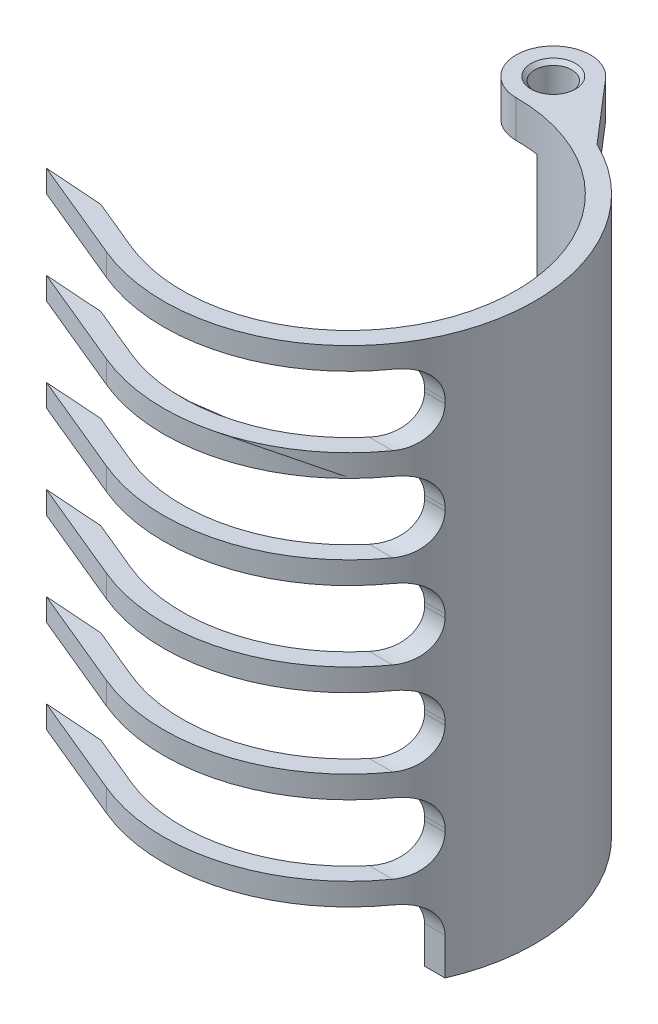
ISO-10303-21;
HEADER;
FILE_DESCRIPTION(('STEP AP214'),'2;1');
FILE_NAME('part.step','',(''),(''),'','','');
FILE_SCHEMA(('AUTOMOTIVE_DESIGN { 1 0 10303 214 1 1 1 1 }'));
ENDSEC;
DATA;
#1=APPLICATION_CONTEXT('core data for automotive mechanical design processes');
#2=APPLICATION_PROTOCOL_DEFINITION('international standard','automotive_design',2000,#1);
#3=PRODUCT_CONTEXT('',#1,'mechanical');
#4=PRODUCT('Part','Part','',(#3));
#5=PRODUCT_RELATED_PRODUCT_CATEGORY('part','',(#4));
#6=PRODUCT_DEFINITION_FORMATION('','',#4);
#7=PRODUCT_DEFINITION_CONTEXT('part definition',#1,'design');
#8=PRODUCT_DEFINITION('design','',#6,#7);
#9=PRODUCT_DEFINITION_SHAPE('','',#8);
#10=(LENGTH_UNIT() NAMED_UNIT(*) SI_UNIT(.MILLI.,.METRE.));
#11=(NAMED_UNIT(*) PLANE_ANGLE_UNIT() SI_UNIT($,.RADIAN.));
#12=(NAMED_UNIT(*) SI_UNIT($,.STERADIAN.) SOLID_ANGLE_UNIT());
#13=UNCERTAINTY_MEASURE_WITH_UNIT(LENGTH_MEASURE(1.E-05),#10,'distance_accuracy_value','');
#14=(GEOMETRIC_REPRESENTATION_CONTEXT(3) GLOBAL_UNCERTAINTY_ASSIGNED_CONTEXT((#13)) GLOBAL_UNIT_ASSIGNED_CONTEXT((#10,
#11,#12)) REPRESENTATION_CONTEXT('',''));
#15=CARTESIAN_POINT('',(0.,0.,0.));
#16=DIRECTION('',(0.,0.,1.));
#17=DIRECTION('',(1.,0.,0.));
#18=AXIS2_PLACEMENT_3D('',#15,#16,#17);
#19=CARTESIAN_POINT('',(0.,150.,0.));
#20=DIRECTION('',(0.,-1.,0.));
#21=DIRECTION('',(0.,0.,-1.));
#22=AXIS2_PLACEMENT_3D('',#19,#20,#21);
#23=CYLINDRICAL_SURFACE('',#22,45.);
#24=CARTESIAN_POINT('',(0.,0.,0.));
#25=DIRECTION('',(0.,-1.,0.));
#26=DIRECTION('',(0.,0.,1.));
#27=AXIS2_PLACEMENT_3D('',#24,#25,#26);
#28=CIRCLE('',#27,45.);
#29=CARTESIAN_POINT('',(0.,0.,-45.));
#30=VERTEX_POINT('',#29);
#31=CARTESIAN_POINT('',(40.3112887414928,0.,20.));
#32=VERTEX_POINT('',#31);
#33=EDGE_CURVE('E416',#30,#32,#28,.T.);
#34=ORIENTED_EDGE('',*,*,#33,.T.);
#35=DIRECTION('',(0.,-1.,0.));
#36=VECTOR('',#35,1.);
#37=CARTESIAN_POINT('',(40.3112887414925,150.,20.0000000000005));
#38=LINE('',#37,#36);
#39=CARTESIAN_POINT('',(40.3112887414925,9.99999999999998,20.));
#40=VERTEX_POINT('',#39);
#41=EDGE_CURVE('E406',#32,#40,#38,.F.);
#42=ORIENTED_EDGE('',*,*,#41,.T.);
#43=CARTESIAN_POINT('',(40.3112887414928,9.99999999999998,20.));
#44=CARTESIAN_POINT('',(40.3112918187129,10.2314505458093,19.9999624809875));
#45=CARTESIAN_POINT('',(40.3068594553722,10.4628922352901,20.0089265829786));
#46=CARTESIAN_POINT('',(40.2891468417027,10.9240266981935,20.0445847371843));
#47=CARTESIAN_POINT('',(40.2758680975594,11.1537197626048,20.0712757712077));
#48=CARTESIAN_POINT('',(40.2405317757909,11.6091119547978,20.1420224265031));
#49=CARTESIAN_POINT('',(40.2184971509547,11.834819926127,20.1860326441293));
#50=CARTESIAN_POINT('',(40.1656941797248,12.2812442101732,20.2908963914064));
#51=CARTESIAN_POINT('',(40.1349257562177,12.5019604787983,20.3517500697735));
#52=CARTESIAN_POINT('',(40.064728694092,12.9368393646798,20.4895944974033));
#53=CARTESIAN_POINT('',(40.0253012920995,13.1510029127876,20.5665829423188));
#54=CARTESIAN_POINT('',(39.9378799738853,13.5714013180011,20.7358339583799));
#55=CARTESIAN_POINT('',(39.8898857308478,13.7776358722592,20.8280971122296));
#56=CARTESIAN_POINT('',(39.7854555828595,14.1809176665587,21.0268904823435));
#57=CARTESIAN_POINT('',(39.7290183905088,14.3779634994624,21.1334228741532));
#58=CARTESIAN_POINT('',(39.6078779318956,14.7617093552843,21.3595986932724));
#59=CARTESIAN_POINT('',(39.5431745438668,14.9484092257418,21.4792423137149));
#60=CARTESIAN_POINT('',(39.4038902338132,15.3153058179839,21.7337300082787));
#61=CARTESIAN_POINT('',(39.3290930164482,15.4951991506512,21.8688928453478));
#62=CARTESIAN_POINT('',(39.1712849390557,15.8422366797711,22.1503150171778));
#63=CARTESIAN_POINT('',(39.0882739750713,16.0093807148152,22.2965744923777));
#64=CARTESIAN_POINT('',(38.9143555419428,16.3302858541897,22.5987458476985));
#65=CARTESIAN_POINT('',(38.8234480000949,16.4840468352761,22.7546578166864));
#66=CARTESIAN_POINT('',(38.6340624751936,16.7777984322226,23.0747440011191));
#67=CARTESIAN_POINT('',(38.53558169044,16.9177839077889,23.2389212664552));
#68=CARTESIAN_POINT('',(38.3223682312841,17.1955221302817,23.5890173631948));
#69=CARTESIAN_POINT('',(38.2069693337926,17.3319646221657,23.7755699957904));
#70=CARTESIAN_POINT('',(37.9681867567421,17.5880840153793,24.1550631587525));
#71=CARTESIAN_POINT('',(37.844800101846,17.7077546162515,24.3480060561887));
#72=CARTESIAN_POINT('',(37.5906118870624,17.9304065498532,24.7386379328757));
#73=CARTESIAN_POINT('',(37.45980859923,18.0333839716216,24.9363280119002));
#74=CARTESIAN_POINT('',(37.1913483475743,18.222918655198,25.3349835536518));
#75=CARTESIAN_POINT('',(37.0536890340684,18.3094702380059,25.5359501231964));
#76=CARTESIAN_POINT('',(36.751287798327,18.478137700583,25.9696487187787));
#77=CARTESIAN_POINT('',(36.5855524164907,18.5577024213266,26.2026811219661));
#78=CARTESIAN_POINT('',(36.2466439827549,18.6964514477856,26.6695343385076));
#79=CARTESIAN_POINT('',(36.0734675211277,18.7556262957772,26.9033554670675));
#80=CARTESIAN_POINT('',(35.7207482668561,18.8543615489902,27.3699398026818));
#81=CARTESIAN_POINT('',(35.5412116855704,18.8939405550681,27.6027038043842));
#82=CARTESIAN_POINT('',(35.1764007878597,18.9544676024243,28.0661320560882));
#83=CARTESIAN_POINT('',(34.991126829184,18.9754168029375,28.296796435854));
#84=CARTESIAN_POINT('',(34.7382528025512,18.9916942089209,28.6053207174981));
#85=CARTESIAN_POINT('',(34.6728116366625,18.9948200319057,28.6846075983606));
#86=CARTESIAN_POINT('',(34.5414378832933,18.9989714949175,28.8426699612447));
#87=CARTESIAN_POINT('',(34.4755059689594,18.9999996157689,28.9214459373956));
#88=CARTESIAN_POINT('',(34.4093010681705,19.,29.));
#89=B_SPLINE_CURVE_WITH_KNOTS('',3,(#43,#44,#45,#46,#47,#48,#49,#50,#51,#52,#53,#54,#55,#56,#57,
#58,#59,#60,#61,#62,#63,#64,#65,#66,#67,#68,#69,#70,#71,#72,#73,#74,#75,#76,#77,#78,#79,#80,#81,
#82,#83,#84,#85,#86,#87,#88),.UNSPECIFIED.,.F.,.F.,(4,2,2,2,2,2,2,2,2,2,2,2,2,2,2,2,2,2,2,2,2,2,
4),(0.,0.694122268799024,1.3881263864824,2.08032310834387,2.77252594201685,3.46462998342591,
4.15676043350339,4.84899652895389,5.54124282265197,6.25183135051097,6.96242887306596,
7.673032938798,8.38390116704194,9.15810777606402,9.93260444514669,10.7072823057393,
11.4822275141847,12.371834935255,13.2618544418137,14.1510274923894,15.0401452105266,
15.3486871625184,15.6568640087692),.UNSPECIFIED.);
#90=CARTESIAN_POINT('',(34.4093010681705,19.,29.));
#91=VERTEX_POINT('',#90);
#92=EDGE_CURVE('E473',#40,#91,#89,.T.);
#93=ORIENTED_EDGE('',*,*,#92,.T.);
#94=CARTESIAN_POINT('',(0.,19.,0.));
#95=DIRECTION('',(0.,1.,0.));
#96=DIRECTION('',(0.,0.,1.));
#97=AXIS2_PLACEMENT_3D('',#94,#95,#96);
#98=CIRCLE('',#97,45.);
#99=CARTESIAN_POINT('',(-17.2207544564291,19.,41.5745789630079));
#100=VERTEX_POINT('',#99);
#101=EDGE_CURVE('E759',#91,#100,#98,.F.);
#102=ORIENTED_EDGE('',*,*,#101,.T.);
#103=DIRECTION('',(0.,-1.,0.));
#104=VECTOR('',#103,1.);
#105=CARTESIAN_POINT('',(-17.2207544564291,150.,41.5745789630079));
#106=LINE('',#105,#104);
#107=CARTESIAN_POINT('',(-17.2207544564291,25.,41.5745789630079));
#108=VERTEX_POINT('',#107);
#109=EDGE_CURVE('E443',#108,#100,#106,.T.);
#110=ORIENTED_EDGE('',*,*,#109,.F.);
#111=CARTESIAN_POINT('',(0.,25.,0.));
#112=DIRECTION('',(0.,-1.,0.));
#113=DIRECTION('',(0.,0.,-1.));
#114=AXIS2_PLACEMENT_3D('',#111,#112,#113);
#115=CIRCLE('',#114,45.);
#116=CARTESIAN_POINT('',(34.4093010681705,25.,29.));
#117=VERTEX_POINT('',#116);
#118=EDGE_CURVE('E850',#108,#117,#115,.F.);
#119=ORIENTED_EDGE('',*,*,#118,.T.);
#120=CARTESIAN_POINT('',(34.4093010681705,25.,29.));
#121=CARTESIAN_POINT('',(34.5320797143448,25.0000031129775,28.8543216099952));
#122=CARTESIAN_POINT('',(34.6539207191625,25.0035375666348,28.7078738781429));
#123=CARTESIAN_POINT('',(34.8955758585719,25.0179123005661,28.4136415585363));
#124=CARTESIAN_POINT('',(35.0153897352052,25.0287535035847,28.2658568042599));
#125=CARTESIAN_POINT('',(35.3718780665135,25.072645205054,27.8204042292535));
#126=CARTESIAN_POINT('',(35.6052247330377,25.117065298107,27.5210825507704));
#127=CARTESIAN_POINT('',(36.062569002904,25.2384652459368,26.9190437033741));
#128=CARTESIAN_POINT('',(36.2865038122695,25.3156343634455,26.6163169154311));
#129=CARTESIAN_POINT('',(36.7216458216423,25.5043714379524,26.0126683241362));
#130=CARTESIAN_POINT('',(36.9328631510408,25.6159115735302,25.7117452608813));
#131=CARTESIAN_POINT('',(37.2874625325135,25.841030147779,25.1935792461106));
#132=CARTESIAN_POINT('',(37.4341434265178,25.9464530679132,24.9750258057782));
#133=CARTESIAN_POINT('',(37.7188479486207,26.1773094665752,24.542929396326));
#134=CARTESIAN_POINT('',(37.8568735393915,26.3027383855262,24.3293852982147));
#135=CARTESIAN_POINT('',(38.1232129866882,26.5735053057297,23.9098772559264));
#136=CARTESIAN_POINT('',(38.2515495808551,26.718794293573,23.703896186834));
#137=CARTESIAN_POINT('',(38.4981659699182,27.0294486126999,23.3012222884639));
#138=CARTESIAN_POINT('',(38.6164457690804,27.194813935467,23.104529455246));
#139=CARTESIAN_POINT('',(38.8431363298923,27.5465548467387,22.7213709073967));
#140=CARTESIAN_POINT('',(38.9514653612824,27.733080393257,22.5349941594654));
#141=CARTESIAN_POINT('',(39.1566212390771,28.1253251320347,22.1766017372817));
#142=CARTESIAN_POINT('',(39.253447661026,28.3310450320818,22.0045865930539));
#143=CARTESIAN_POINT('',(39.4351043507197,28.760557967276,21.6773522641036));
#144=CARTESIAN_POINT('',(39.5199290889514,28.9843592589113,21.5221408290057));
#145=CARTESIAN_POINT('',(39.6770829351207,29.4482961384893,21.2310261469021));
#146=CARTESIAN_POINT('',(39.7494141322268,29.6884289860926,21.0951196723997));
#147=CARTESIAN_POINT('',(39.8735359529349,30.1540421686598,20.8594520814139));
#148=CARTESIAN_POINT('',(39.9267395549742,30.3779511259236,20.7573225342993));
#149=CARTESIAN_POINT('',(40.0229745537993,30.8352674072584,20.5711569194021));
#150=CARTESIAN_POINT('',(40.0660070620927,31.0686736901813,20.487118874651));
#151=CARTESIAN_POINT('',(40.1417176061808,31.5427903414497,20.3383744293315));
#152=CARTESIAN_POINT('',(40.1744116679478,31.7834887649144,20.2736381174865));
#153=CARTESIAN_POINT('',(40.2294393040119,32.270457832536,20.1642246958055));
#154=CARTESIAN_POINT('',(40.2517779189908,32.5167257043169,20.1195378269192));
#155=CARTESIAN_POINT('',(40.2830483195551,32.9691867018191,20.0568456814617));
#156=CARTESIAN_POINT('',(40.2936466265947,33.1748139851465,20.0355308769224));
#157=CARTESIAN_POINT('',(40.3077615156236,33.5869549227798,20.0071089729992));
#158=CARTESIAN_POINT('',(40.3112895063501,33.7934666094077,19.9999789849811));
#159=CARTESIAN_POINT('',(40.3112887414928,34.,20.));
#160=B_SPLINE_CURVE_WITH_KNOTS('',3,(#120,#121,#122,#123,#124,#125,#126,#127,#128,#129,#130,
#131,#132,#133,#134,#135,#136,#137,#138,#139,#140,#141,#142,#143,#144,#145,#146,#147,#148,#149,
#150,#151,#152,#153,#154,#155,#156,#157,#158,#159),.UNSPECIFIED.,.F.,.F.,(4,2,2,2,2,2,2,2,2,2,2,
2,2,2,2,2,2,2,2,4),(0.,0.571477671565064,1.14302752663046,2.28786553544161,3.43941186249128,
4.59002851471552,5.43985160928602,6.28948129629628,7.13705078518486,7.98461991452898,
8.83862284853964,9.69265728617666,10.5470839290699,11.401367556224,12.1557299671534,
12.9100099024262,13.6631148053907,14.4158527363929,15.036260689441,15.6556667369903),.UNSPECIFIED.);
#161=CARTESIAN_POINT('',(40.3112887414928,34.,20.));
#162=VERTEX_POINT('',#161);
#163=EDGE_CURVE('E511',#117,#162,#160,.T.);
#164=ORIENTED_EDGE('',*,*,#163,.T.);
#165=DIRECTION('',(0.,-1.,0.));
#166=VECTOR('',#165,1.);
#167=CARTESIAN_POINT('',(40.3112887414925,150.,20.0000000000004));
#168=LINE('',#167,#166);
#169=CARTESIAN_POINT('',(40.3112887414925,35.,20.));
#170=VERTEX_POINT('',#169);
#171=EDGE_CURVE('E854',#162,#170,#168,.F.);
#172=ORIENTED_EDGE('',*,*,#171,.T.);
#173=CARTESIAN_POINT('',(40.3112887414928,35.,20.));
#174=CARTESIAN_POINT('',(40.3112918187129,35.2314505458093,19.9999624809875));
#175=CARTESIAN_POINT('',(40.3068594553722,35.4628922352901,20.0089265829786));
#176=CARTESIAN_POINT('',(40.2891468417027,35.9240266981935,20.0445847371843));
#177=CARTESIAN_POINT('',(40.2758680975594,36.1537197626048,20.0712757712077));
#178=CARTESIAN_POINT('',(40.2405317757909,36.6091119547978,20.1420224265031));
#179=CARTESIAN_POINT('',(40.2184971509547,36.834819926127,20.1860326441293));
#180=CARTESIAN_POINT('',(40.1656941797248,37.2812442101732,20.2908963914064));
#181=CARTESIAN_POINT('',(40.1349257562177,37.5019604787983,20.3517500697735));
#182=CARTESIAN_POINT('',(40.064728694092,37.9368393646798,20.4895944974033));
#183=CARTESIAN_POINT('',(40.0253012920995,38.1510029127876,20.5665829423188));
#184=CARTESIAN_POINT('',(39.9378799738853,38.5714013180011,20.7358339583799));
#185=CARTESIAN_POINT('',(39.8898857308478,38.7776358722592,20.8280971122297));
#186=CARTESIAN_POINT('',(39.7854555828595,39.1809176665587,21.0268904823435));
#187=CARTESIAN_POINT('',(39.7290183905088,39.3779634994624,21.1334228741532));
#188=CARTESIAN_POINT('',(39.6078779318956,39.7617093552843,21.3595986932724));
#189=CARTESIAN_POINT('',(39.5431745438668,39.9484092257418,21.4792423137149));
#190=CARTESIAN_POINT('',(39.4038902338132,40.3153058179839,21.7337300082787));
#191=CARTESIAN_POINT('',(39.3290930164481,40.4951991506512,21.8688928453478));
#192=CARTESIAN_POINT('',(39.1712849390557,40.8422366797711,22.1503150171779));
#193=CARTESIAN_POINT('',(39.0882739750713,41.0093807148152,22.2965744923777));
#194=CARTESIAN_POINT('',(38.9143555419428,41.3302858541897,22.5987458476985));
#195=CARTESIAN_POINT('',(38.8234480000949,41.4840468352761,22.7546578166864));
#196=CARTESIAN_POINT('',(38.6340624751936,41.7777984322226,23.0747440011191));
#197=CARTESIAN_POINT('',(38.53558169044,41.9177839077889,23.2389212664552));
#198=CARTESIAN_POINT('',(38.3223682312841,42.1955221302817,23.5890173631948));
#199=CARTESIAN_POINT('',(38.2069693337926,42.3319646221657,23.7755699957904));
#200=CARTESIAN_POINT('',(37.9681867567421,42.5880840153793,24.1550631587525));
#201=CARTESIAN_POINT('',(37.844800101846,42.7077546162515,24.3480060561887));
#202=CARTESIAN_POINT('',(37.5906118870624,42.9304065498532,24.7386379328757));
#203=CARTESIAN_POINT('',(37.45980859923,43.0333839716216,24.9363280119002));
#204=CARTESIAN_POINT('',(37.1913483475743,43.222918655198,25.3349835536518));
#205=CARTESIAN_POINT('',(37.0536890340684,43.3094702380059,25.5359501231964));
#206=CARTESIAN_POINT('',(36.751287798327,43.478137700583,25.9696487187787));
#207=CARTESIAN_POINT('',(36.5855524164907,43.5577024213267,26.2026811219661));
#208=CARTESIAN_POINT('',(36.2466439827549,43.6964514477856,26.6695343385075));
#209=CARTESIAN_POINT('',(36.0734675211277,43.7556262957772,26.9033554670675));
#210=CARTESIAN_POINT('',(35.7207482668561,43.8543615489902,27.3699398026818));
#211=CARTESIAN_POINT('',(35.5412116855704,43.8939405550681,27.6027038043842));
#212=CARTESIAN_POINT('',(35.1764007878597,43.9544676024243,28.0661320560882));
#213=CARTESIAN_POINT('',(34.991126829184,43.9754168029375,28.296796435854));
#214=CARTESIAN_POINT('',(34.7382528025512,43.9916942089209,28.6053207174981));
#215=CARTESIAN_POINT('',(34.6728116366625,43.9948200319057,28.6846075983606));
#216=CARTESIAN_POINT('',(34.5414378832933,43.9989714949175,28.8426699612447));
#217=CARTESIAN_POINT('',(34.4755059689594,43.9999996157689,28.9214459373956));
#218=CARTESIAN_POINT('',(34.4093010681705,44.,29.));
#219=B_SPLINE_CURVE_WITH_KNOTS('',3,(#173,#174,#175,#176,#177,#178,#179,#180,#181,#182,#183,
#184,#185,#186,#187,#188,#189,#190,#191,#192,#193,#194,#195,#196,#197,#198,#199,#200,#201,#202,
#203,#204,#205,#206,#207,#208,#209,#210,#211,#212,#213,#214,#215,#216,#217,#218),.UNSPECIFIED.,
.F.,.F.,(4,2,2,2,2,2,2,2,2,2,2,2,2,2,2,2,2,2,2,2,2,2,4),(0.,0.694122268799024,1.3881263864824,
2.08032310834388,2.77252594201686,3.46462998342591,4.15676043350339,4.84899652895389,
5.54124282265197,6.25183135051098,6.96242887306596,7.67303293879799,8.38390116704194,
9.15810777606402,9.93260444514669,10.7072823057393,11.4822275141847,12.371834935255,
13.2618544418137,14.1510274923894,15.0401452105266,15.3486871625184,15.6568640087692),.UNSPECIFIED.);
#220=CARTESIAN_POINT('',(34.4093010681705,44.,29.));
#221=VERTEX_POINT('',#220);
#222=EDGE_CURVE('E521',#170,#221,#219,.T.);
#223=ORIENTED_EDGE('',*,*,#222,.T.);
#224=CARTESIAN_POINT('',(0.,44.,0.));
#225=DIRECTION('',(0.,1.,0.));
#226=DIRECTION('',(0.,0.,1.));
#227=AXIS2_PLACEMENT_3D('',#224,#225,#226);
#228=CIRCLE('',#227,45.);
#229=CARTESIAN_POINT('',(-17.2207544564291,44.,41.5745789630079));
#230=VERTEX_POINT('',#229);
#231=EDGE_CURVE('E869',#221,#230,#228,.F.);
#232=ORIENTED_EDGE('',*,*,#231,.T.);
#233=CARTESIAN_POINT('',(-17.2207544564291,50.,41.5745789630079));
#234=VERTEX_POINT('',#233);
#235=EDGE_CURVE('E772',#234,#230,#106,.T.);
#236=ORIENTED_EDGE('',*,*,#235,.F.);
#237=CARTESIAN_POINT('',(0.,50.,0.));
#238=DIRECTION('',(0.,-1.,0.));
#239=DIRECTION('',(0.,0.,-1.));
#240=AXIS2_PLACEMENT_3D('',#237,#238,#239);
#241=CIRCLE('',#240,45.);
#242=CARTESIAN_POINT('',(34.4093010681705,50.,29.));
#243=VERTEX_POINT('',#242);
#244=EDGE_CURVE('E877',#234,#243,#241,.F.);
#245=ORIENTED_EDGE('',*,*,#244,.T.);
#246=CARTESIAN_POINT('',(34.4093010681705,50.,29.));
#247=CARTESIAN_POINT('',(34.5320797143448,50.0000031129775,28.8543216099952));
#248=CARTESIAN_POINT('',(34.6539207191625,50.0035375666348,28.7078738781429));
#249=CARTESIAN_POINT('',(34.8955758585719,50.0179123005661,28.4136415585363));
#250=CARTESIAN_POINT('',(35.0153897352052,50.0287535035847,28.2658568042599));
#251=CARTESIAN_POINT('',(35.3718780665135,50.072645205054,27.8204042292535));
#252=CARTESIAN_POINT('',(35.6052247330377,50.117065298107,27.5210825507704));
#253=CARTESIAN_POINT('',(36.062569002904,50.2384652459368,26.9190437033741));
#254=CARTESIAN_POINT('',(36.2865038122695,50.3156343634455,26.6163169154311));
#255=CARTESIAN_POINT('',(36.7216458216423,50.5043714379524,26.0126683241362));
#256=CARTESIAN_POINT('',(36.9328631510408,50.6159115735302,25.7117452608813));
#257=CARTESIAN_POINT('',(37.2874625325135,50.841030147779,25.1935792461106));
#258=CARTESIAN_POINT('',(37.4341434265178,50.9464530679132,24.9750258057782));
#259=CARTESIAN_POINT('',(37.7188479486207,51.1773094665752,24.542929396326));
#260=CARTESIAN_POINT('',(37.8568735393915,51.3027383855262,24.3293852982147));
#261=CARTESIAN_POINT('',(38.1232129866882,51.5735053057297,23.9098772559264));
#262=CARTESIAN_POINT('',(38.2515495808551,51.718794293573,23.703896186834));
#263=CARTESIAN_POINT('',(38.4981659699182,52.0294486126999,23.3012222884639));
#264=CARTESIAN_POINT('',(38.6164457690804,52.194813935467,23.104529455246));
#265=CARTESIAN_POINT('',(38.8431363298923,52.5465548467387,22.7213709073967));
#266=CARTESIAN_POINT('',(38.9514653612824,52.733080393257,22.5349941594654));
#267=CARTESIAN_POINT('',(39.1566212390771,53.1253251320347,22.1766017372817));
#268=CARTESIAN_POINT('',(39.253447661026,53.3310450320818,22.0045865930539));
#269=CARTESIAN_POINT('',(39.4351043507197,53.760557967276,21.6773522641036));
#270=CARTESIAN_POINT('',(39.5199290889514,53.9843592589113,21.5221408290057));
#271=CARTESIAN_POINT('',(39.6770829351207,54.4482961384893,21.2310261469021));
#272=CARTESIAN_POINT('',(39.7494141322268,54.6884289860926,21.0951196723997));
#273=CARTESIAN_POINT('',(39.8735359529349,55.1540421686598,20.8594520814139));
#274=CARTESIAN_POINT('',(39.9267395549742,55.3779511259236,20.7573225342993));
#275=CARTESIAN_POINT('',(40.0229745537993,55.8352674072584,20.5711569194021));
#276=CARTESIAN_POINT('',(40.0660070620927,56.0686736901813,20.4871188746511));
#277=CARTESIAN_POINT('',(40.1417176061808,56.5427903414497,20.3383744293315));
#278=CARTESIAN_POINT('',(40.1744116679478,56.7834887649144,20.2736381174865));
#279=CARTESIAN_POINT('',(40.2294393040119,57.2704578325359,20.1642246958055));
#280=CARTESIAN_POINT('',(40.2517779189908,57.5167257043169,20.1195378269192));
#281=CARTESIAN_POINT('',(40.2830483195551,57.9691867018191,20.0568456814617));
#282=CARTESIAN_POINT('',(40.2936466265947,58.1748139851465,20.0355308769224));
#283=CARTESIAN_POINT('',(40.3077615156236,58.5869549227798,20.0071089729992));
#284=CARTESIAN_POINT('',(40.3112895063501,58.7934666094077,19.9999789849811));
#285=CARTESIAN_POINT('',(40.3112887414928,59.,20.));
#286=B_SPLINE_CURVE_WITH_KNOTS('',3,(#246,#247,#248,#249,#250,#251,#252,#253,#254,#255,#256,
#257,#258,#259,#260,#261,#262,#263,#264,#265,#266,#267,#268,#269,#270,#271,#272,#273,#274,#275,
#276,#277,#278,#279,#280,#281,#282,#283,#284,#285),.UNSPECIFIED.,.F.,.F.,(4,2,2,2,2,2,2,2,2,2,2,
2,2,2,2,2,2,2,2,4),(0.,0.571477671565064,1.14302752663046,2.28786553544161,3.43941186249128,
4.59002851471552,5.43985160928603,6.28948129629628,7.13705078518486,7.98461991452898,
8.83862284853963,9.69265728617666,10.5470839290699,11.401367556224,12.1557299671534,
12.9100099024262,13.6631148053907,14.4158527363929,15.036260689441,15.6556667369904),.UNSPECIFIED.);
#287=CARTESIAN_POINT('',(40.3112887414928,59.,20.));
#288=VERTEX_POINT('',#287);
#289=EDGE_CURVE('E530',#243,#288,#286,.T.);
#290=ORIENTED_EDGE('',*,*,#289,.T.);
#291=DIRECTION('',(0.,-1.,0.));
#292=VECTOR('',#291,1.);
#293=CARTESIAN_POINT('',(40.3112887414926,150.,20.0000000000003));
#294=LINE('',#293,#292);
#295=CARTESIAN_POINT('',(40.3112887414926,60.,20.));
#296=VERTEX_POINT('',#295);
#297=EDGE_CURVE('E880',#288,#296,#294,.F.);
#298=ORIENTED_EDGE('',*,*,#297,.T.);
#299=CARTESIAN_POINT('',(40.3112887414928,60.,20.));
#300=CARTESIAN_POINT('',(40.3112918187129,60.2314505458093,19.9999624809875));
#301=CARTESIAN_POINT('',(40.3068594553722,60.4628922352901,20.0089265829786));
#302=CARTESIAN_POINT('',(40.2891468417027,60.9240266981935,20.0445847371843));
#303=CARTESIAN_POINT('',(40.2758680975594,61.1537197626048,20.0712757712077));
#304=CARTESIAN_POINT('',(40.2405317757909,61.6091119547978,20.1420224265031));
#305=CARTESIAN_POINT('',(40.2184971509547,61.834819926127,20.1860326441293));
#306=CARTESIAN_POINT('',(40.1656941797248,62.2812442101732,20.2908963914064));
#307=CARTESIAN_POINT('',(40.1349257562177,62.5019604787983,20.3517500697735));
#308=CARTESIAN_POINT('',(40.064728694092,62.9368393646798,20.4895944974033));
#309=CARTESIAN_POINT('',(40.0253012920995,63.1510029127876,20.5665829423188));
#310=CARTESIAN_POINT('',(39.9378799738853,63.5714013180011,20.7358339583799));
#311=CARTESIAN_POINT('',(39.8898857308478,63.7776358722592,20.8280971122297));
#312=CARTESIAN_POINT('',(39.7854555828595,64.1809176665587,21.0268904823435));
#313=CARTESIAN_POINT('',(39.7290183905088,64.3779634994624,21.1334228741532));
#314=CARTESIAN_POINT('',(39.6078779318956,64.7617093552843,21.3595986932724));
#315=CARTESIAN_POINT('',(39.5431745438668,64.9484092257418,21.4792423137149));
#316=CARTESIAN_POINT('',(39.4038902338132,65.3153058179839,21.7337300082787));
#317=CARTESIAN_POINT('',(39.3290930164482,65.4951991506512,21.8688928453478));
#318=CARTESIAN_POINT('',(39.1712849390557,65.8422366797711,22.1503150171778));
#319=CARTESIAN_POINT('',(39.0882739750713,66.0093807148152,22.2965744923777));
#320=CARTESIAN_POINT('',(38.9143555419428,66.3302858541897,22.5987458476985));
#321=CARTESIAN_POINT('',(38.8234480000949,66.4840468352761,22.7546578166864));
#322=CARTESIAN_POINT('',(38.6340624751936,66.7777984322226,23.0747440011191));
#323=CARTESIAN_POINT('',(38.53558169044,66.9177839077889,23.2389212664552));
#324=CARTESIAN_POINT('',(38.3223682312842,67.1955221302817,23.5890173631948));
#325=CARTESIAN_POINT('',(38.2069693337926,67.3319646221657,23.7755699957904));
#326=CARTESIAN_POINT('',(37.9681867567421,67.5880840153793,24.1550631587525));
#327=CARTESIAN_POINT('',(37.844800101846,67.7077546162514,24.3480060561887));
#328=CARTESIAN_POINT('',(37.5906118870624,67.9304065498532,24.7386379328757));
#329=CARTESIAN_POINT('',(37.45980859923,68.0333839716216,24.9363280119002));
#330=CARTESIAN_POINT('',(37.1913483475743,68.222918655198,25.3349835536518));
#331=CARTESIAN_POINT('',(37.0536890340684,68.3094702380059,25.5359501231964));
#332=CARTESIAN_POINT('',(36.751287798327,68.478137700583,25.9696487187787));
#333=CARTESIAN_POINT('',(36.5855524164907,68.5577024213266,26.2026811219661));
#334=CARTESIAN_POINT('',(36.2466439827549,68.6964514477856,26.6695343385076));
#335=CARTESIAN_POINT('',(36.0734675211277,68.7556262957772,26.9033554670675));
#336=CARTESIAN_POINT('',(35.7207482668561,68.8543615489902,27.3699398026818));
#337=CARTESIAN_POINT('',(35.5412116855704,68.8939405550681,27.6027038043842));
#338=CARTESIAN_POINT('',(35.1764007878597,68.9544676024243,28.0661320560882));
#339=CARTESIAN_POINT('',(34.991126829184,68.9754168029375,28.296796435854));
#340=CARTESIAN_POINT('',(34.7382528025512,68.9916942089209,28.6053207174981));
#341=CARTESIAN_POINT('',(34.6728116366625,68.9948200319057,28.6846075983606));
#342=CARTESIAN_POINT('',(34.5414378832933,68.9989714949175,28.8426699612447));
#343=CARTESIAN_POINT('',(34.4755059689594,68.9999996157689,28.9214459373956));
#344=CARTESIAN_POINT('',(34.4093010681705,69.,29.));
#345=B_SPLINE_CURVE_WITH_KNOTS('',3,(#299,#300,#301,#302,#303,#304,#305,#306,#307,#308,#309,
#310,#311,#312,#313,#314,#315,#316,#317,#318,#319,#320,#321,#322,#323,#324,#325,#326,#327,#328,
#329,#330,#331,#332,#333,#334,#335,#336,#337,#338,#339,#340,#341,#342,#343,#344),.UNSPECIFIED.,
.F.,.F.,(4,2,2,2,2,2,2,2,2,2,2,2,2,2,2,2,2,2,2,2,2,2,4),(0.,0.694122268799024,1.3881263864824,
2.08032310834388,2.77252594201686,3.46462998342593,4.15676043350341,4.8489965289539,
5.54124282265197,6.25183135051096,6.96242887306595,7.67303293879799,8.38390116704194,
9.15810777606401,9.93260444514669,10.7072823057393,11.4822275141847,12.371834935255,
13.2618544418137,14.1510274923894,15.0401452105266,15.3486871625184,15.6568640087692),.UNSPECIFIED.);
#346=CARTESIAN_POINT('',(34.4093010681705,69.,29.));
#347=VERTEX_POINT('',#346);
#348=EDGE_CURVE('E540',#296,#347,#345,.T.);
#349=ORIENTED_EDGE('',*,*,#348,.T.);
#350=CARTESIAN_POINT('',(0.,69.,0.));
#351=DIRECTION('',(0.,1.,0.));
#352=DIRECTION('',(0.,0.,1.));
#353=AXIS2_PLACEMENT_3D('',#350,#351,#352);
#354=CIRCLE('',#353,45.);
#355=CARTESIAN_POINT('',(-17.2207544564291,69.,41.5745789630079));
#356=VERTEX_POINT('',#355);
#357=EDGE_CURVE('E895',#347,#356,#354,.F.);
#358=ORIENTED_EDGE('',*,*,#357,.T.);
#359=CARTESIAN_POINT('',(-17.2207544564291,75.,41.5745789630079));
#360=VERTEX_POINT('',#359);
#361=EDGE_CURVE('E774',#360,#356,#106,.T.);
#362=ORIENTED_EDGE('',*,*,#361,.F.);
#363=CARTESIAN_POINT('',(0.,75.,0.));
#364=DIRECTION('',(0.,-1.,0.));
#365=DIRECTION('',(0.,0.,-1.));
#366=AXIS2_PLACEMENT_3D('',#363,#364,#365);
#367=CIRCLE('',#366,45.);
#368=CARTESIAN_POINT('',(34.4093010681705,75.,29.));
#369=VERTEX_POINT('',#368);
#370=EDGE_CURVE('E903',#360,#369,#367,.F.);
#371=ORIENTED_EDGE('',*,*,#370,.T.);
#372=CARTESIAN_POINT('',(34.4093010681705,75.,29.));
#373=CARTESIAN_POINT('',(34.5320797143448,75.0000031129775,28.8543216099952));
#374=CARTESIAN_POINT('',(34.6539207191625,75.0035375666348,28.7078738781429));
#375=CARTESIAN_POINT('',(34.8955758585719,75.0179123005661,28.4136415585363));
#376=CARTESIAN_POINT('',(35.0153897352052,75.0287535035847,28.2658568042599));
#377=CARTESIAN_POINT('',(35.3718780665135,75.072645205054,27.8204042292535));
#378=CARTESIAN_POINT('',(35.6052247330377,75.117065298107,27.5210825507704));
#379=CARTESIAN_POINT('',(36.062569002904,75.2384652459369,26.9190437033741));
#380=CARTESIAN_POINT('',(36.2865038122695,75.3156343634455,26.6163169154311));
#381=CARTESIAN_POINT('',(36.7216458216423,75.5043714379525,26.0126683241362));
#382=CARTESIAN_POINT('',(36.9328631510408,75.6159115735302,25.7117452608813));
#383=CARTESIAN_POINT('',(37.2874625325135,75.841030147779,25.1935792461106));
#384=CARTESIAN_POINT('',(37.4341434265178,75.9464530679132,24.9750258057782));
#385=CARTESIAN_POINT('',(37.7188479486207,76.1773094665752,24.542929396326));
#386=CARTESIAN_POINT('',(37.8568735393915,76.3027383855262,24.3293852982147));
#387=CARTESIAN_POINT('',(38.1232129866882,76.5735053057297,23.9098772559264));
#388=CARTESIAN_POINT('',(38.2515495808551,76.718794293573,23.703896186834));
#389=CARTESIAN_POINT('',(38.4981659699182,77.0294486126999,23.3012222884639));
#390=CARTESIAN_POINT('',(38.6164457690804,77.194813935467,23.104529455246));
#391=CARTESIAN_POINT('',(38.8431363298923,77.5465548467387,22.7213709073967));
#392=CARTESIAN_POINT('',(38.9514653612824,77.733080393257,22.5349941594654));
#393=CARTESIAN_POINT('',(39.1566212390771,78.1253251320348,22.1766017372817));
#394=CARTESIAN_POINT('',(39.253447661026,78.3310450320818,22.0045865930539));
#395=CARTESIAN_POINT('',(39.4351043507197,78.760557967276,21.6773522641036));
#396=CARTESIAN_POINT('',(39.5199290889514,78.9843592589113,21.5221408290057));
#397=CARTESIAN_POINT('',(39.6770829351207,79.4482961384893,21.2310261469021));
#398=CARTESIAN_POINT('',(39.7494141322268,79.6884289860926,21.0951196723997));
#399=CARTESIAN_POINT('',(39.8735359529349,80.1540421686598,20.8594520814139));
#400=CARTESIAN_POINT('',(39.9267395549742,80.3779511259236,20.7573225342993));
#401=CARTESIAN_POINT('',(40.0229745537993,80.8352674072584,20.5711569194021));
#402=CARTESIAN_POINT('',(40.0660070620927,81.0686736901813,20.487118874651));
#403=CARTESIAN_POINT('',(40.1417176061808,81.5427903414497,20.3383744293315));
#404=CARTESIAN_POINT('',(40.1744116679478,81.7834887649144,20.2736381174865));
#405=CARTESIAN_POINT('',(40.2294393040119,82.270457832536,20.1642246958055));
#406=CARTESIAN_POINT('',(40.2517779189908,82.5167257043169,20.1195378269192));
#407=CARTESIAN_POINT('',(40.2830483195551,82.9691867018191,20.0568456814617));
#408=CARTESIAN_POINT('',(40.2936466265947,83.1748139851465,20.0355308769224));
#409=CARTESIAN_POINT('',(40.3077615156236,83.5869549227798,20.0071089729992));
#410=CARTESIAN_POINT('',(40.3112895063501,83.7934666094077,19.9999789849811));
#411=CARTESIAN_POINT('',(40.3112887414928,84.,20.));
#412=B_SPLINE_CURVE_WITH_KNOTS('',3,(#372,#373,#374,#375,#376,#377,#378,#379,#380,#381,#382,
#383,#384,#385,#386,#387,#388,#389,#390,#391,#392,#393,#394,#395,#396,#397,#398,#399,#400,#401,
#402,#403,#404,#405,#406,#407,#408,#409,#410,#411),.UNSPECIFIED.,.F.,.F.,(4,2,2,2,2,2,2,2,2,2,2,
2,2,2,2,2,2,2,2,4),(0.,0.571477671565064,1.14302752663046,2.28786553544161,3.43941186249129,
4.59002851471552,5.43985160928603,6.28948129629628,7.13705078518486,7.98461991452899,
8.83862284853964,9.69265728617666,10.5470839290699,11.401367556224,12.1557299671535,
12.9100099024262,13.6631148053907,14.4158527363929,15.036260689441,15.6556667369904),.UNSPECIFIED.);
#413=CARTESIAN_POINT('',(40.3112887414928,84.,20.));
#414=VERTEX_POINT('',#413);
#415=EDGE_CURVE('E549',#369,#414,#412,.T.);
#416=ORIENTED_EDGE('',*,*,#415,.T.);
#417=DIRECTION('',(0.,-1.,0.));
#418=VECTOR('',#417,1.);
#419=CARTESIAN_POINT('',(40.3112887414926,150.,20.0000000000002));
#420=LINE('',#419,#418);
#421=CARTESIAN_POINT('',(40.3112887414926,85.,20.));
#422=VERTEX_POINT('',#421);
#423=EDGE_CURVE('E906',#414,#422,#420,.F.);
#424=ORIENTED_EDGE('',*,*,#423,.T.);
#425=CARTESIAN_POINT('',(40.3112887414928,85.,20.));
#426=CARTESIAN_POINT('',(40.3112918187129,85.2314505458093,19.9999624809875));
#427=CARTESIAN_POINT('',(40.3068594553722,85.4628922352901,20.0089265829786));
#428=CARTESIAN_POINT('',(40.2891468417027,85.9240266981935,20.0445847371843));
#429=CARTESIAN_POINT('',(40.2758680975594,86.1537197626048,20.0712757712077));
#430=CARTESIAN_POINT('',(40.240531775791,86.6091119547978,20.1420224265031));
#431=CARTESIAN_POINT('',(40.2184971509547,86.834819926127,20.1860326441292));
#432=CARTESIAN_POINT('',(40.1656941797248,87.2812442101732,20.2908963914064));
#433=CARTESIAN_POINT('',(40.1349257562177,87.5019604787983,20.3517500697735));
#434=CARTESIAN_POINT('',(40.064728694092,87.9368393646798,20.4895944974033));
#435=CARTESIAN_POINT('',(40.0253012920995,88.1510029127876,20.5665829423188));
#436=CARTESIAN_POINT('',(39.9378799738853,88.5714013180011,20.7358339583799));
#437=CARTESIAN_POINT('',(39.8898857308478,88.7776358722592,20.8280971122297));
#438=CARTESIAN_POINT('',(39.7854555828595,89.1809176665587,21.0268904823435));
#439=CARTESIAN_POINT('',(39.7290183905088,89.3779634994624,21.1334228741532));
#440=CARTESIAN_POINT('',(39.6078779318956,89.7617093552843,21.3595986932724));
#441=CARTESIAN_POINT('',(39.5431745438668,89.9484092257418,21.4792423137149));
#442=CARTESIAN_POINT('',(39.4038902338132,90.3153058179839,21.7337300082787));
#443=CARTESIAN_POINT('',(39.3290930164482,90.4951991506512,21.8688928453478));
#444=CARTESIAN_POINT('',(39.1712849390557,90.8422366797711,22.1503150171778));
#445=CARTESIAN_POINT('',(39.0882739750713,91.0093807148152,22.2965744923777));
#446=CARTESIAN_POINT('',(38.9143555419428,91.3302858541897,22.5987458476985));
#447=CARTESIAN_POINT('',(38.8234480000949,91.4840468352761,22.7546578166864));
#448=CARTESIAN_POINT('',(38.6340624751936,91.7777984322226,23.0747440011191));
#449=CARTESIAN_POINT('',(38.53558169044,91.9177839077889,23.2389212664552));
#450=CARTESIAN_POINT('',(38.3223682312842,92.1955221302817,23.5890173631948));
#451=CARTESIAN_POINT('',(38.2069693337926,92.3319646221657,23.7755699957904));
#452=CARTESIAN_POINT('',(37.9681867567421,92.5880840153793,24.1550631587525));
#453=CARTESIAN_POINT('',(37.8448001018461,92.7077546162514,24.3480060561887));
#454=CARTESIAN_POINT('',(37.5906118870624,92.9304065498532,24.7386379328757));
#455=CARTESIAN_POINT('',(37.45980859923,93.0333839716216,24.9363280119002));
#456=CARTESIAN_POINT('',(37.1913483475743,93.222918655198,25.3349835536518));
#457=CARTESIAN_POINT('',(37.0536890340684,93.3094702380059,25.5359501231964));
#458=CARTESIAN_POINT('',(36.751287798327,93.478137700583,25.9696487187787));
#459=CARTESIAN_POINT('',(36.5855524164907,93.5577024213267,26.2026811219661));
#460=CARTESIAN_POINT('',(36.2466439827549,93.6964514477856,26.6695343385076));
#461=CARTESIAN_POINT('',(36.0734675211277,93.7556262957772,26.9033554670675));
#462=CARTESIAN_POINT('',(35.7207482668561,93.8543615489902,27.3699398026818));
#463=CARTESIAN_POINT('',(35.5412116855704,93.8939405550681,27.6027038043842));
#464=CARTESIAN_POINT('',(35.1764007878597,93.9544676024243,28.0661320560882));
#465=CARTESIAN_POINT('',(34.991126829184,93.9754168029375,28.296796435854));
#466=CARTESIAN_POINT('',(34.7382528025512,93.9916942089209,28.6053207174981));
#467=CARTESIAN_POINT('',(34.6728116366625,93.9948200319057,28.6846075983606));
#468=CARTESIAN_POINT('',(34.5414378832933,93.9989714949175,28.8426699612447));
#469=CARTESIAN_POINT('',(34.4755059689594,93.9999996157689,28.9214459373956));
#470=CARTESIAN_POINT('',(34.4093010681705,94.,29.));
#471=B_SPLINE_CURVE_WITH_KNOTS('',3,(#425,#426,#427,#428,#429,#430,#431,#432,#433,#434,#435,
#436,#437,#438,#439,#440,#441,#442,#443,#444,#445,#446,#447,#448,#449,#450,#451,#452,#453,#454,
#455,#456,#457,#458,#459,#460,#461,#462,#463,#464,#465,#466,#467,#468,#469,#470),.UNSPECIFIED.,
.F.,.F.,(4,2,2,2,2,2,2,2,2,2,2,2,2,2,2,2,2,2,2,2,2,2,4),(0.,0.694122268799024,1.3881263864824,
2.08032310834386,2.77252594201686,3.46462998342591,4.1567604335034,4.84899652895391,
5.54124282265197,6.25183135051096,6.96242887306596,7.673032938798,8.38390116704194,
9.15810777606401,9.93260444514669,10.7072823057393,11.4822275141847,12.371834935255,
13.2618544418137,14.1510274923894,15.0401452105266,15.3486871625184,15.6568640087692),.UNSPECIFIED.);
#472=CARTESIAN_POINT('',(34.4093010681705,94.,29.));
#473=VERTEX_POINT('',#472);
#474=EDGE_CURVE('E559',#422,#473,#471,.T.);
#475=ORIENTED_EDGE('',*,*,#474,.T.);
#476=CARTESIAN_POINT('',(0.,94.,0.));
#477=DIRECTION('',(0.,1.,0.));
#478=DIRECTION('',(0.,0.,1.));
#479=AXIS2_PLACEMENT_3D('',#476,#477,#478);
#480=CIRCLE('',#479,45.);
#481=CARTESIAN_POINT('',(-17.2207544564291,94.,41.5745789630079));
#482=VERTEX_POINT('',#481);
#483=EDGE_CURVE('E921',#473,#482,#480,.F.);
#484=ORIENTED_EDGE('',*,*,#483,.T.);
#485=CARTESIAN_POINT('',(-17.2207544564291,100.,41.5745789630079));
#486=VERTEX_POINT('',#485);
#487=EDGE_CURVE('E780',#486,#482,#106,.T.);
#488=ORIENTED_EDGE('',*,*,#487,.F.);
#489=CARTESIAN_POINT('',(0.,100.,0.));
#490=DIRECTION('',(0.,-1.,0.));
#491=DIRECTION('',(0.,0.,-1.));
#492=AXIS2_PLACEMENT_3D('',#489,#490,#491);
#493=CIRCLE('',#492,45.);
#494=CARTESIAN_POINT('',(34.4093010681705,100.,29.));
#495=VERTEX_POINT('',#494);
#496=EDGE_CURVE('E929',#486,#495,#493,.F.);
#497=ORIENTED_EDGE('',*,*,#496,.T.);
#498=CARTESIAN_POINT('',(34.4093010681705,100.,29.));
#499=CARTESIAN_POINT('',(34.5320797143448,100.000003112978,28.8543216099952));
#500=CARTESIAN_POINT('',(34.6539207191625,100.003537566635,28.7078738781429));
#501=CARTESIAN_POINT('',(34.8955758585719,100.017912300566,28.4136415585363));
#502=CARTESIAN_POINT('',(35.0153897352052,100.028753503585,28.2658568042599));
#503=CARTESIAN_POINT('',(35.3718780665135,100.072645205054,27.8204042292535));
#504=CARTESIAN_POINT('',(35.6052247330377,100.117065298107,27.5210825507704));
#505=CARTESIAN_POINT('',(36.062569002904,100.238465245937,26.9190437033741));
#506=CARTESIAN_POINT('',(36.2865038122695,100.315634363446,26.6163169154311));
#507=CARTESIAN_POINT('',(36.7216458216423,100.504371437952,26.0126683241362));
#508=CARTESIAN_POINT('',(36.9328631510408,100.61591157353,25.7117452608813));
#509=CARTESIAN_POINT('',(37.2874625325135,100.841030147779,25.1935792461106));
#510=CARTESIAN_POINT('',(37.4341434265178,100.946453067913,24.9750258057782));
#511=CARTESIAN_POINT('',(37.7188479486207,101.177309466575,24.542929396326));
#512=CARTESIAN_POINT('',(37.8568735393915,101.302738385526,24.3293852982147));
#513=CARTESIAN_POINT('',(38.1232129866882,101.57350530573,23.9098772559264));
#514=CARTESIAN_POINT('',(38.2515495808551,101.718794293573,23.703896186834));
#515=CARTESIAN_POINT('',(38.4981659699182,102.0294486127,23.3012222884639));
#516=CARTESIAN_POINT('',(38.6164457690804,102.194813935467,23.104529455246));
#517=CARTESIAN_POINT('',(38.8431363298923,102.546554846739,22.7213709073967));
#518=CARTESIAN_POINT('',(38.9514653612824,102.733080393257,22.5349941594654));
#519=CARTESIAN_POINT('',(39.1566212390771,103.125325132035,22.1766017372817));
#520=CARTESIAN_POINT('',(39.253447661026,103.331045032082,22.0045865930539));
#521=CARTESIAN_POINT('',(39.4351043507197,103.760557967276,21.6773522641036));
#522=CARTESIAN_POINT('',(39.5199290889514,103.984359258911,21.5221408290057));
#523=CARTESIAN_POINT('',(39.6770829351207,104.448296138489,21.2310261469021));
#524=CARTESIAN_POINT('',(39.7494141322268,104.688428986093,21.0951196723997));
#525=CARTESIAN_POINT('',(39.8735359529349,105.15404216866,20.8594520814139));
#526=CARTESIAN_POINT('',(39.9267395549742,105.377951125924,20.7573225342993));
#527=CARTESIAN_POINT('',(40.0229745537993,105.835267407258,20.5711569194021));
#528=CARTESIAN_POINT('',(40.0660070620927,106.068673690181,20.487118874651));
#529=CARTESIAN_POINT('',(40.1417176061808,106.54279034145,20.3383744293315));
#530=CARTESIAN_POINT('',(40.1744116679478,106.783488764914,20.2736381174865));
#531=CARTESIAN_POINT('',(40.2294393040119,107.270457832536,20.1642246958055));
#532=CARTESIAN_POINT('',(40.2517779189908,107.516725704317,20.1195378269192));
#533=CARTESIAN_POINT('',(40.2830483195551,107.969186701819,20.0568456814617));
#534=CARTESIAN_POINT('',(40.2936466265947,108.174813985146,20.0355308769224));
#535=CARTESIAN_POINT('',(40.3077615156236,108.58695492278,20.0071089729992));
#536=CARTESIAN_POINT('',(40.3112895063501,108.793466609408,19.9999789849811));
#537=CARTESIAN_POINT('',(40.3112887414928,109.,20.));
#538=B_SPLINE_CURVE_WITH_KNOTS('',3,(#498,#499,#500,#501,#502,#503,#504,#505,#506,#507,#508,
#509,#510,#511,#512,#513,#514,#515,#516,#517,#518,#519,#520,#521,#522,#523,#524,#525,#526,#527,
#528,#529,#530,#531,#532,#533,#534,#535,#536,#537),.UNSPECIFIED.,.F.,.F.,(4,2,2,2,2,2,2,2,2,2,2,
2,2,2,2,2,2,2,2,4),(0.,0.571477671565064,1.14302752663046,2.28786553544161,3.43941186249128,
4.59002851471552,5.43985160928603,6.28948129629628,7.13705078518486,7.98461991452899,
8.83862284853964,9.69265728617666,10.5470839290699,11.401367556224,12.1557299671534,
12.9100099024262,13.6631148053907,14.4158527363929,15.0362606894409,15.6556667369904),.UNSPECIFIED.);
#539=CARTESIAN_POINT('',(40.3112887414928,109.,20.));
#540=VERTEX_POINT('',#539);
#541=EDGE_CURVE('E567',#495,#540,#538,.T.);
#542=ORIENTED_EDGE('',*,*,#541,.T.);
#543=DIRECTION('',(0.,-1.,0.));
#544=VECTOR('',#543,1.);
#545=CARTESIAN_POINT('',(40.3112887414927,150.,20.0000000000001));
#546=LINE('',#545,#544);
#547=CARTESIAN_POINT('',(40.3112887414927,110.,20.));
#548=VERTEX_POINT('',#547);
#549=EDGE_CURVE('E585',#540,#548,#546,.F.);
#550=ORIENTED_EDGE('',*,*,#549,.T.);
#551=CARTESIAN_POINT('',(40.3112887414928,110.,20.));
#552=CARTESIAN_POINT('',(40.3112918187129,110.231450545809,19.9999624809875));
#553=CARTESIAN_POINT('',(40.3068594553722,110.46289223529,20.0089265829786));
#554=CARTESIAN_POINT('',(40.2891468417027,110.924026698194,20.0445847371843));
#555=CARTESIAN_POINT('',(40.2758680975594,111.153719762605,20.0712757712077));
#556=CARTESIAN_POINT('',(40.2405317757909,111.609111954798,20.1420224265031));
#557=CARTESIAN_POINT('',(40.2184971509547,111.834819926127,20.1860326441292));
#558=CARTESIAN_POINT('',(40.1656941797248,112.281244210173,20.2908963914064));
#559=CARTESIAN_POINT('',(40.1349257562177,112.501960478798,20.3517500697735));
#560=CARTESIAN_POINT('',(40.064728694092,112.93683936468,20.4895944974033));
#561=CARTESIAN_POINT('',(40.0253012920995,113.151002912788,20.5665829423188));
#562=CARTESIAN_POINT('',(39.9378799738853,113.571401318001,20.7358339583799));
#563=CARTESIAN_POINT('',(39.8898857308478,113.777635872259,20.8280971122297));
#564=CARTESIAN_POINT('',(39.7854555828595,114.180917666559,21.0268904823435));
#565=CARTESIAN_POINT('',(39.7290183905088,114.377963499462,21.1334228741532));
#566=CARTESIAN_POINT('',(39.6078779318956,114.761709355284,21.3595986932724));
#567=CARTESIAN_POINT('',(39.5431745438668,114.948409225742,21.4792423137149));
#568=CARTESIAN_POINT('',(39.4038902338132,115.315305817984,21.7337300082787));
#569=CARTESIAN_POINT('',(39.3290930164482,115.495199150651,21.8688928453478));
#570=CARTESIAN_POINT('',(39.1712849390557,115.842236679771,22.1503150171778));
#571=CARTESIAN_POINT('',(39.0882739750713,116.009380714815,22.2965744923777));
#572=CARTESIAN_POINT('',(38.9143555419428,116.33028585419,22.5987458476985));
#573=CARTESIAN_POINT('',(38.8234480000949,116.484046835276,22.7546578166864));
#574=CARTESIAN_POINT('',(38.6340624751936,116.777798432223,23.0747440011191));
#575=CARTESIAN_POINT('',(38.53558169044,116.917783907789,23.2389212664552));
#576=CARTESIAN_POINT('',(38.3223682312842,117.195522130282,23.5890173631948));
#577=CARTESIAN_POINT('',(38.2069693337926,117.331964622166,23.7755699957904));
#578=CARTESIAN_POINT('',(37.9681867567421,117.588084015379,24.1550631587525));
#579=CARTESIAN_POINT('',(37.8448001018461,117.707754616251,24.3480060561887));
#580=CARTESIAN_POINT('',(37.5906118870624,117.930406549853,24.7386379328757));
#581=CARTESIAN_POINT('',(37.45980859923,118.033383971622,24.9363280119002));
#582=CARTESIAN_POINT('',(37.1913483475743,118.222918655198,25.3349835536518));
#583=CARTESIAN_POINT('',(37.0536890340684,118.309470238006,25.5359501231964));
#584=CARTESIAN_POINT('',(36.751287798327,118.478137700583,25.9696487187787));
#585=CARTESIAN_POINT('',(36.5855524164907,118.557702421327,26.2026811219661));
#586=CARTESIAN_POINT('',(36.2466439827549,118.696451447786,26.6695343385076));
#587=CARTESIAN_POINT('',(36.0734675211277,118.755626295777,26.9033554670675));
#588=CARTESIAN_POINT('',(35.7207482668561,118.85436154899,27.3699398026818));
#589=CARTESIAN_POINT('',(35.5412116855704,118.893940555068,27.6027038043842));
#590=CARTESIAN_POINT('',(35.1764007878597,118.954467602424,28.0661320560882));
#591=CARTESIAN_POINT('',(34.991126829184,118.975416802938,28.296796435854));
#592=CARTESIAN_POINT('',(34.7382528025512,118.991694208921,28.6053207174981));
#593=CARTESIAN_POINT('',(34.6728116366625,118.994820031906,28.6846075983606));
#594=CARTESIAN_POINT('',(34.5414378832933,118.998971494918,28.8426699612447));
#595=CARTESIAN_POINT('',(34.4755059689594,118.999999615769,28.9214459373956));
#596=CARTESIAN_POINT('',(34.4093010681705,119.,29.));
#597=B_SPLINE_CURVE_WITH_KNOTS('',3,(#551,#552,#553,#554,#555,#556,#557,#558,#559,#560,#561,
#562,#563,#564,#565,#566,#567,#568,#569,#570,#571,#572,#573,#574,#575,#576,#577,#578,#579,#580,
#581,#582,#583,#584,#585,#586,#587,#588,#589,#590,#591,#592,#593,#594,#595,#596),.UNSPECIFIED.,
.F.,.F.,(4,2,2,2,2,2,2,2,2,2,2,2,2,2,2,2,2,2,2,2,2,2,4),(0.,0.694122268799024,1.38812638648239,
2.08032310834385,2.77252594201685,3.46462998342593,4.15676043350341,4.84899652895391,
5.54124282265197,6.25183135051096,6.96242887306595,7.67303293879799,8.38390116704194,
9.15810777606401,9.93260444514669,10.7072823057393,11.4822275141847,12.371834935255,
13.2618544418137,14.1510274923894,15.0401452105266,15.3486871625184,15.6568640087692),.UNSPECIFIED.);
#598=CARTESIAN_POINT('',(34.4093010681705,119.,29.));
#599=VERTEX_POINT('',#598);
#600=EDGE_CURVE('E576',#548,#599,#597,.T.);
#601=ORIENTED_EDGE('',*,*,#600,.T.);
#602=CARTESIAN_POINT('',(0.,119.,0.));
#603=DIRECTION('',(0.,1.,0.));
#604=DIRECTION('',(0.,0.,1.));
#605=AXIS2_PLACEMENT_3D('',#602,#603,#604);
#606=CIRCLE('',#605,45.);
#607=CARTESIAN_POINT('',(-17.2207544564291,119.,41.5745789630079));
#608=VERTEX_POINT('',#607);
#609=EDGE_CURVE('E802',#599,#608,#606,.F.);
#610=ORIENTED_EDGE('',*,*,#609,.T.);
#611=CARTESIAN_POINT('',(-17.2207544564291,125.,41.5745789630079));
#612=VERTEX_POINT('',#611);
#613=EDGE_CURVE('E448',#612,#608,#106,.T.);
#614=ORIENTED_EDGE('',*,*,#613,.F.);
#615=CARTESIAN_POINT('',(0.,125.,0.));
#616=DIRECTION('',(0.,-1.,0.));
#617=DIRECTION('',(0.,0.,-1.));
#618=AXIS2_PLACEMENT_3D('',#615,#616,#617);
#619=CIRCLE('',#618,45.);
#620=CARTESIAN_POINT('',(34.4093010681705,125.,29.));
#621=VERTEX_POINT('',#620);
#622=EDGE_CURVE('E640',#612,#621,#619,.F.);
#623=ORIENTED_EDGE('',*,*,#622,.T.);
#624=CARTESIAN_POINT('',(34.4093010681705,125.,29.));
#625=CARTESIAN_POINT('',(34.5320797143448,125.000003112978,28.8543216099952));
#626=CARTESIAN_POINT('',(34.6539207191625,125.003537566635,28.7078738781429));
#627=CARTESIAN_POINT('',(34.8955758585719,125.017912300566,28.4136415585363));
#628=CARTESIAN_POINT('',(35.0153897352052,125.028753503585,28.2658568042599));
#629=CARTESIAN_POINT('',(35.3718780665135,125.072645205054,27.8204042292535));
#630=CARTESIAN_POINT('',(35.6052247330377,125.117065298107,27.5210825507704));
#631=CARTESIAN_POINT('',(36.062569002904,125.238465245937,26.9190437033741));
#632=CARTESIAN_POINT('',(36.2865038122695,125.315634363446,26.6163169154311));
#633=CARTESIAN_POINT('',(36.7216458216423,125.504371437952,26.0126683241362));
#634=CARTESIAN_POINT('',(36.9328631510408,125.61591157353,25.7117452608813));
#635=CARTESIAN_POINT('',(37.2874625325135,125.841030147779,25.1935792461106));
#636=CARTESIAN_POINT('',(37.4341434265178,125.946453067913,24.9750258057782));
#637=CARTESIAN_POINT('',(37.7188479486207,126.177309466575,24.542929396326));
#638=CARTESIAN_POINT('',(37.8568735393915,126.302738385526,24.3293852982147));
#639=CARTESIAN_POINT('',(38.1232129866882,126.57350530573,23.9098772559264));
#640=CARTESIAN_POINT('',(38.2515495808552,126.718794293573,23.703896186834));
#641=CARTESIAN_POINT('',(38.4981659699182,127.0294486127,23.3012222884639));
#642=CARTESIAN_POINT('',(38.6164457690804,127.194813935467,23.104529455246));
#643=CARTESIAN_POINT('',(38.8431363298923,127.546554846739,22.7213709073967));
#644=CARTESIAN_POINT('',(38.9514653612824,127.733080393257,22.5349941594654));
#645=CARTESIAN_POINT('',(39.1566212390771,128.125325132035,22.1766017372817));
#646=CARTESIAN_POINT('',(39.253447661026,128.331045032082,22.0045865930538));
#647=CARTESIAN_POINT('',(39.4351043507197,128.760557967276,21.6773522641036));
#648=CARTESIAN_POINT('',(39.5199290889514,128.984359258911,21.5221408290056));
#649=CARTESIAN_POINT('',(39.6770829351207,129.448296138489,21.2310261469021));
#650=CARTESIAN_POINT('',(39.7494141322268,129.688428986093,21.0951196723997));
#651=CARTESIAN_POINT('',(39.8735359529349,130.15404216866,20.8594520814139));
#652=CARTESIAN_POINT('',(39.9267395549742,130.377951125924,20.7573225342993));
#653=CARTESIAN_POINT('',(40.0229745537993,130.835267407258,20.5711569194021));
#654=CARTESIAN_POINT('',(40.0660070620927,131.068673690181,20.487118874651));
#655=CARTESIAN_POINT('',(40.1417176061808,131.54279034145,20.3383744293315));
#656=CARTESIAN_POINT('',(40.1744116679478,131.783488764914,20.2736381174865));
#657=CARTESIAN_POINT('',(40.2294393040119,132.270457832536,20.1642246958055));
#658=CARTESIAN_POINT('',(40.2517779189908,132.516725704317,20.1195378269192));
#659=CARTESIAN_POINT('',(40.2830483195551,132.969186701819,20.0568456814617));
#660=CARTESIAN_POINT('',(40.2936466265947,133.174813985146,20.0355308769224));
#661=CARTESIAN_POINT('',(40.3077615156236,133.58695492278,20.0071089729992));
#662=CARTESIAN_POINT('',(40.3112895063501,133.793466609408,19.9999789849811));
#663=CARTESIAN_POINT('',(40.3112887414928,134.,20.));
#664=B_SPLINE_CURVE_WITH_KNOTS('',3,(#624,#625,#626,#627,#628,#629,#630,#631,#632,#633,#634,
#635,#636,#637,#638,#639,#640,#641,#642,#643,#644,#645,#646,#647,#648,#649,#650,#651,#652,#653,
#654,#655,#656,#657,#658,#659,#660,#661,#662,#663),.UNSPECIFIED.,.F.,.F.,(4,2,2,2,2,2,2,2,2,2,2,
2,2,2,2,2,2,2,2,4),(0.,0.571477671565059,1.14302752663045,2.2878655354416,3.43941186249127,
4.59002851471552,5.43985160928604,6.2894812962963,7.13705078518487,7.98461991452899,
8.83862284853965,9.6926572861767,10.5470839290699,11.401367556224,12.1557299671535,
12.9100099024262,13.6631148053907,14.4158527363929,15.0362606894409,15.6556667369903),.UNSPECIFIED.);
#665=CARTESIAN_POINT('',(40.3112887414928,134.,20.));
#666=VERTEX_POINT('',#665);
#667=EDGE_CURVE('E632',#621,#666,#664,.T.);
#668=ORIENTED_EDGE('',*,*,#667,.T.);
#669=DIRECTION('',(0.,-1.,0.));
#670=VECTOR('',#669,1.);
#671=CARTESIAN_POINT('',(40.3112887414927,150.,20.0000000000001));
#672=LINE('',#671,#670);
#673=CARTESIAN_POINT('',(40.3112887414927,135.,20.));
#674=VERTEX_POINT('',#673);
#675=EDGE_CURVE('E639',#666,#674,#672,.F.);
#676=ORIENTED_EDGE('',*,*,#675,.T.);
#677=CARTESIAN_POINT('',(40.3112887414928,135.,20.));
#678=CARTESIAN_POINT('',(40.3112918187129,135.231450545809,19.9999624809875));
#679=CARTESIAN_POINT('',(40.3068594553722,135.46289223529,20.0089265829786));
#680=CARTESIAN_POINT('',(40.2891468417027,135.924026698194,20.0445847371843));
#681=CARTESIAN_POINT('',(40.2758680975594,136.153719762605,20.0712757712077));
#682=CARTESIAN_POINT('',(40.240531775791,136.609111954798,20.1420224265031));
#683=CARTESIAN_POINT('',(40.2184971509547,136.834819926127,20.1860326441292));
#684=CARTESIAN_POINT('',(40.1656941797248,137.281244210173,20.2908963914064));
#685=CARTESIAN_POINT('',(40.1349257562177,137.501960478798,20.3517500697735));
#686=CARTESIAN_POINT('',(40.064728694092,137.93683936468,20.4895944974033));
#687=CARTESIAN_POINT('',(40.0253012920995,138.151002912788,20.5665829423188));
#688=CARTESIAN_POINT('',(39.9378799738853,138.571401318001,20.7358339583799));
#689=CARTESIAN_POINT('',(39.8898857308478,138.777635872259,20.8280971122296));
#690=CARTESIAN_POINT('',(39.7854555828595,139.180917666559,21.0268904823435));
#691=CARTESIAN_POINT('',(39.7290183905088,139.377963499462,21.1334228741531));
#692=CARTESIAN_POINT('',(39.6078779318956,139.761709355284,21.3595986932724));
#693=CARTESIAN_POINT('',(39.5431745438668,139.948409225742,21.4792423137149));
#694=CARTESIAN_POINT('',(39.4038902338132,140.315305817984,21.7337300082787));
#695=CARTESIAN_POINT('',(39.3290930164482,140.495199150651,21.8688928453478));
#696=CARTESIAN_POINT('',(39.1712849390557,140.842236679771,22.1503150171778));
#697=CARTESIAN_POINT('',(39.0882739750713,141.009380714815,22.2965744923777));
#698=CARTESIAN_POINT('',(38.9143555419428,141.33028585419,22.5987458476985));
#699=CARTESIAN_POINT('',(38.8234480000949,141.484046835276,22.7546578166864));
#700=CARTESIAN_POINT('',(38.6340624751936,141.777798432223,23.0747440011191));
#701=CARTESIAN_POINT('',(38.53558169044,141.917783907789,23.2389212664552));
#702=CARTESIAN_POINT('',(38.3223682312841,142.195522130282,23.5890173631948));
#703=CARTESIAN_POINT('',(38.2069693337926,142.331964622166,23.7755699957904));
#704=CARTESIAN_POINT('',(37.9681867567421,142.588084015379,24.1550631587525));
#705=CARTESIAN_POINT('',(37.844800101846,142.707754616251,24.3480060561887));
#706=CARTESIAN_POINT('',(37.5906118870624,142.930406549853,24.7386379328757));
#707=CARTESIAN_POINT('',(37.45980859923,143.033383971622,24.9363280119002));
#708=CARTESIAN_POINT('',(37.1913483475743,143.222918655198,25.3349835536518));
#709=CARTESIAN_POINT('',(37.0536890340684,143.309470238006,25.5359501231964));
#710=CARTESIAN_POINT('',(36.751287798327,143.478137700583,25.9696487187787));
#711=CARTESIAN_POINT('',(36.5855524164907,143.557702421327,26.2026811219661));
#712=CARTESIAN_POINT('',(36.2466439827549,143.696451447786,26.6695343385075));
#713=CARTESIAN_POINT('',(36.0734675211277,143.755626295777,26.9033554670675));
#714=CARTESIAN_POINT('',(35.7207482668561,143.85436154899,27.3699398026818));
#715=CARTESIAN_POINT('',(35.5412116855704,143.893940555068,27.6027038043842));
#716=CARTESIAN_POINT('',(35.1764007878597,143.954467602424,28.0661320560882));
#717=CARTESIAN_POINT('',(34.991126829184,143.975416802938,28.296796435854));
#718=CARTESIAN_POINT('',(34.7382528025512,143.991694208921,28.6053207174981));
#719=CARTESIAN_POINT('',(34.6728116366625,143.994820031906,28.6846075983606));
#720=CARTESIAN_POINT('',(34.5414378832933,143.998971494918,28.8426699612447));
#721=CARTESIAN_POINT('',(34.4755059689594,143.999999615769,28.9214459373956));
#722=CARTESIAN_POINT('',(34.4093010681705,144.,29.));
#723=B_SPLINE_CURVE_WITH_KNOTS('',3,(#677,#678,#679,#680,#681,#682,#683,#684,#685,#686,#687,
#688,#689,#690,#691,#692,#693,#694,#695,#696,#697,#698,#699,#700,#701,#702,#703,#704,#705,#706,
#707,#708,#709,#710,#711,#712,#713,#714,#715,#716,#717,#718,#719,#720,#721,#722),.UNSPECIFIED.,
.F.,.F.,(4,2,2,2,2,2,2,2,2,2,2,2,2,2,2,2,2,2,2,2,2,2,4),(0.,0.694122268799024,1.3881263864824,
2.08032310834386,2.77252594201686,3.46462998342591,4.1567604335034,4.84899652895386,
5.54124282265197,6.25183135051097,6.96242887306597,7.67303293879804,8.38390116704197,
9.15810777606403,9.93260444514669,10.7072823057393,11.4822275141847,12.371834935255,
13.2618544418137,14.1510274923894,15.0401452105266,15.3486871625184,15.6568640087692),.UNSPECIFIED.);
#724=CARTESIAN_POINT('',(34.4093010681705,144.,29.));
#725=VERTEX_POINT('',#724);
#726=EDGE_CURVE('E498',#674,#725,#723,.T.);
#727=ORIENTED_EDGE('',*,*,#726,.T.);
#728=CARTESIAN_POINT('',(0.,144.,0.));
#729=DIRECTION('',(0.,1.,0.));
#730=DIRECTION('',(0.,0.,1.));
#731=AXIS2_PLACEMENT_3D('',#728,#729,#730);
#732=CIRCLE('',#731,45.);
#733=CARTESIAN_POINT('',(-17.2207544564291,144.,41.5745789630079));
#734=VERTEX_POINT('',#733);
#735=EDGE_CURVE('E421',#725,#734,#732,.F.);
#736=ORIENTED_EDGE('',*,*,#735,.T.);
#737=CARTESIAN_POINT('',(-17.2207544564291,150.,41.5745789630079));
#738=VERTEX_POINT('',#737);
#739=EDGE_CURVE('E445',#738,#734,#106,.T.);
#740=ORIENTED_EDGE('',*,*,#739,.F.);
#741=CARTESIAN_POINT('',(0.,150.,0.));
#742=DIRECTION('',(0.,-1.,0.));
#743=DIRECTION('',(0.,0.,1.));
#744=AXIS2_PLACEMENT_3D('',#741,#742,#743);
#745=CIRCLE('',#744,45.);
#746=CARTESIAN_POINT('',(0.,150.,-45.));
#747=VERTEX_POINT('',#746);
#748=EDGE_CURVE('E415',#747,#738,#745,.T.);
#749=ORIENTED_EDGE('',*,*,#748,.F.);
#750=DIRECTION('',(0.,-1.,0.));
#751=VECTOR('',#750,1.);
#752=CARTESIAN_POINT('',(0.,150.,-45.));
#753=LINE('',#752,#751);
#754=CARTESIAN_POINT('',(0.,140.,-45.));
#755=VERTEX_POINT('',#754);
#756=EDGE_CURVE('E425',#747,#755,#753,.T.);
#757=ORIENTED_EDGE('',*,*,#756,.T.);
#758=CARTESIAN_POINT('',(0.,140.,0.));
#759=DIRECTION('',(0.,-1.,0.));
#760=DIRECTION('',(0.,0.,-1.));
#761=AXIS2_PLACEMENT_3D('',#758,#759,#760);
#762=CIRCLE('',#761,45.);
#763=CARTESIAN_POINT('',(5.9866518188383,140.,-44.6));
#764=VERTEX_POINT('',#763);
#765=EDGE_CURVE('E998',#764,#755,#762,.F.);
#766=ORIENTED_EDGE('',*,*,#765,.F.);
#767=DIRECTION('',(0.,-1.,0.));
#768=VECTOR('',#767,1.);
#769=CARTESIAN_POINT('',(5.98665181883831,75.,-44.6));
#770=LINE('',#769,#768);
#771=CARTESIAN_POINT('',(5.9866518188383,10.,-44.6));
#772=VERTEX_POINT('',#771);
#773=EDGE_CURVE('E682',#764,#772,#770,.T.);
#774=ORIENTED_EDGE('',*,*,#773,.T.);
#775=CARTESIAN_POINT('',(0.,10.,0.));
#776=DIRECTION('',(0.,-1.,0.));
#777=DIRECTION('',(0.,0.,-1.));
#778=AXIS2_PLACEMENT_3D('',#775,#776,#777);
#779=CIRCLE('',#778,45.);
#780=CARTESIAN_POINT('',(0.,10.,-45.));
#781=VERTEX_POINT('',#780);
#782=EDGE_CURVE('E670',#772,#781,#779,.F.);
#783=ORIENTED_EDGE('',*,*,#782,.T.);
#784=EDGE_CURVE('E429',#781,#30,#753,.T.);
#785=ORIENTED_EDGE('',*,*,#784,.T.);
#786=EDGE_LOOP('',(#34,#42,#93,#102,#110,#119,#164,#172,#223,#232,#236,#245,#290,#298,#349,#358,
#362,#371,#416,#424,#475,#484,#488,#497,#542,#550,#601,#610,#614,#623,#668,#676,#727,#736,#740,
#749,#757,#766,#774,#783,#785));
#787=FACE_BOUND('',#786,.T.);
#788=ADVANCED_FACE('F40',(#787),#23,.F.);
#789=CARTESIAN_POINT('',(0.,150.,0.));
#790=DIRECTION('',(0.,-1.,0.));
#791=DIRECTION('',(0.,0.,-1.));
#792=AXIS2_PLACEMENT_3D('',#789,#790,#791);
#793=CYLINDRICAL_SURFACE('',#792,50.);
#794=DIRECTION('',(0.,-1.,0.));
#795=VECTOR('',#794,1.);
#796=CARTESIAN_POINT('',(45.8257569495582,150.,20.0000000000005));
#797=LINE('',#796,#795);
#798=CARTESIAN_POINT('',(45.8257569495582,9.99999999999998,20.));
#799=VERTEX_POINT('',#798);
#800=CARTESIAN_POINT('',(45.8257569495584,0.,20.));
#801=VERTEX_POINT('',#800);
#802=EDGE_CURVE('E389',#799,#801,#797,.T.);
#803=ORIENTED_EDGE('',*,*,#802,.T.);
#804=CARTESIAN_POINT('',(0.,0.,0.));
#805=DIRECTION('',(0.,1.,0.));
#806=DIRECTION('',(0.,0.,1.));
#807=AXIS2_PLACEMENT_3D('',#804,#805,#806);
#808=CIRCLE('',#807,50.);
#809=CARTESIAN_POINT('',(21.7944947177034,0.,-45.));
#810=VERTEX_POINT('',#809);
#811=EDGE_CURVE('E394',#801,#810,#808,.T.);
#812=ORIENTED_EDGE('',*,*,#811,.T.);
#813=DIRECTION('',(0.,-1.,0.));
#814=VECTOR('',#813,1.);
#815=CARTESIAN_POINT('',(21.7944947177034,10.,-45.));
#816=LINE('',#815,#814);
#817=CARTESIAN_POINT('',(21.7944947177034,10.,-45.));
#818=VERTEX_POINT('',#817);
#819=EDGE_CURVE('E687',#818,#810,#816,.T.);
#820=ORIENTED_EDGE('',*,*,#819,.F.);
#821=CARTESIAN_POINT('',(0.,10.,0.));
#822=DIRECTION('',(0.,-1.,0.));
#823=DIRECTION('',(0.,0.,-1.));
#824=AXIS2_PLACEMENT_3D('',#821,#822,#823);
#825=CIRCLE('',#824,50.);
#826=CARTESIAN_POINT('',(10.3446356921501,10.,-48.9181818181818));
#827=VERTEX_POINT('',#826);
#828=EDGE_CURVE('E689',#827,#818,#825,.T.);
#829=ORIENTED_EDGE('',*,*,#828,.F.);
#830=DIRECTION('',(0.,-1.,0.));
#831=VECTOR('',#830,1.);
#832=CARTESIAN_POINT('',(10.3446356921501,75.,-48.9181818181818));
#833=LINE('',#832,#831);
#834=CARTESIAN_POINT('',(10.3446356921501,140.,-48.9181818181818));
#835=VERTEX_POINT('',#834);
#836=EDGE_CURVE('E677',#827,#835,#833,.F.);
#837=ORIENTED_EDGE('',*,*,#836,.T.);
#838=CARTESIAN_POINT('',(0.,140.,0.));
#839=DIRECTION('',(0.,-1.,0.));
#840=DIRECTION('',(0.,0.,-1.));
#841=AXIS2_PLACEMENT_3D('',#838,#839,#840);
#842=CIRCLE('',#841,50.);
#843=CARTESIAN_POINT('',(21.7944947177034,140.,-45.));
#844=VERTEX_POINT('',#843);
#845=EDGE_CURVE('E1099',#835,#844,#842,.T.);
#846=ORIENTED_EDGE('',*,*,#845,.T.);
#847=DIRECTION('',(0.,-1.,0.));
#848=VECTOR('',#847,1.);
#849=CARTESIAN_POINT('',(21.7944947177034,150.,-45.));
#850=LINE('',#849,#848);
#851=CARTESIAN_POINT('',(21.7944947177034,150.,-45.));
#852=VERTEX_POINT('',#851);
#853=EDGE_CURVE('E1118',#852,#844,#850,.T.);
#854=ORIENTED_EDGE('',*,*,#853,.F.);
#855=CARTESIAN_POINT('',(0.,150.,0.));
#856=DIRECTION('',(0.,1.,0.));
#857=DIRECTION('',(0.,0.,1.));
#858=AXIS2_PLACEMENT_3D('',#855,#856,#857);
#859=CIRCLE('',#858,50.);
#860=CARTESIAN_POINT('',(-19.1341716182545,150.,46.1939766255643));
#861=VERTEX_POINT('',#860);
#862=EDGE_CURVE('E661',#861,#852,#859,.T.);
#863=ORIENTED_EDGE('',*,*,#862,.F.);
#864=DIRECTION('',(0.,-1.,0.));
#865=VECTOR('',#864,1.);
#866=CARTESIAN_POINT('',(-19.1341716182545,150.,46.1939766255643));
#867=LINE('',#866,#865);
#868=CARTESIAN_POINT('',(-19.1341716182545,144.,46.1939766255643));
#869=VERTEX_POINT('',#868);
#870=EDGE_CURVE('E430',#861,#869,#867,.T.);
#871=ORIENTED_EDGE('',*,*,#870,.T.);
#872=CARTESIAN_POINT('',(0.,144.,0.));
#873=DIRECTION('',(0.,1.,0.));
#874=DIRECTION('',(0.,0.,1.));
#875=AXIS2_PLACEMENT_3D('',#872,#873,#874);
#876=CIRCLE('',#875,50.);
#877=CARTESIAN_POINT('',(40.7308237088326,144.,29.));
#878=VERTEX_POINT('',#877);
#879=EDGE_CURVE('E997',#869,#878,#876,.T.);
#880=ORIENTED_EDGE('',*,*,#879,.T.);
#881=CARTESIAN_POINT('',(40.7308237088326,144.,29.));
#882=CARTESIAN_POINT('',(40.8418986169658,143.999996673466,28.8439965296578));
#883=CARTESIAN_POINT('',(40.9520621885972,143.995943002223,28.6873702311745));
#884=CARTESIAN_POINT('',(41.1703963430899,143.979522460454,28.3731397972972));
#885=CARTESIAN_POINT('',(41.2785666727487,143.967154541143,28.2155355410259));
#886=CARTESIAN_POINT('',(41.6001082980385,143.917212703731,27.7412482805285));
#887=CARTESIAN_POINT('',(41.8101794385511,143.866799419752,27.4235555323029));
#888=CARTESIAN_POINT('',(42.2203805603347,143.729954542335,26.7877439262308));
#889=CARTESIAN_POINT('',(42.4204695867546,143.643386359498,26.4696280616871));
#890=CARTESIAN_POINT('',(42.8079414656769,143.43291787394,25.838286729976));
#891=CARTESIAN_POINT('',(42.9953354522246,143.309050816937,25.5250571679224));
#892=CARTESIAN_POINT('',(43.3042595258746,143.063997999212,24.9961283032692));
#893=CARTESIAN_POINT('',(43.4293153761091,142.952149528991,24.7781231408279));
#894=CARTESIAN_POINT('',(43.6714894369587,142.708873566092,24.3487513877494));
#895=CARTESIAN_POINT('',(43.7886094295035,142.577450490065,24.1373833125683));
#896=CARTESIAN_POINT('',(44.0140799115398,142.295454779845,23.7237464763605));
#897=CARTESIAN_POINT('',(44.1224500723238,142.144927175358,23.5214577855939));
#898=CARTESIAN_POINT('',(44.330193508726,141.824860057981,23.1275491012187));
#899=CARTESIAN_POINT('',(44.4295667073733,141.655320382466,22.9359291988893));
#900=CARTESIAN_POINT('',(44.619389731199,141.296867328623,22.5644373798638));
#901=CARTESIAN_POINT('',(44.709784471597,141.107847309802,22.3846400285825));
#902=CARTESIAN_POINT('',(44.8805821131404,140.712261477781,22.0401977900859));
#903=CARTESIAN_POINT('',(44.9609847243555,140.505695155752,21.8755533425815));
#904=CARTESIAN_POINT('',(45.1115091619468,140.076222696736,21.5634365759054));
#905=CARTESIAN_POINT('',(45.1816240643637,139.853305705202,21.4159758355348));
#906=CARTESIAN_POINT('',(45.3112412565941,139.392941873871,21.1403553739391));
#907=CARTESIAN_POINT('',(45.3707449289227,139.155496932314,21.012193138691));
#908=CARTESIAN_POINT('',(45.4738868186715,138.690883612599,20.7879627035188));
#909=CARTESIAN_POINT('',(45.5184889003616,138.46483480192,20.6900130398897));
#910=CARTESIAN_POINT('',(45.5987277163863,138.00407377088,20.5125698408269));
#911=CARTESIAN_POINT('',(45.6343651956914,137.769362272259,20.4330747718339));
#912=CARTESIAN_POINT('',(45.6965605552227,137.293465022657,20.2935995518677));
#913=CARTESIAN_POINT('',(45.7231331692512,137.052290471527,20.2335877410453));
#914=CARTESIAN_POINT('',(45.7672292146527,136.565107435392,20.1336463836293));
#915=CARTESIAN_POINT('',(45.7847572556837,136.319101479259,20.0937066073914));
#916=CARTESIAN_POINT('',(45.8070978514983,135.893906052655,20.0427127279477));
#917=CARTESIAN_POINT('',(45.814101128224,135.715408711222,20.02669160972));
#918=CARTESIAN_POINT('',(45.8234265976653,135.357947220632,20.0053394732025));
#919=CARTESIAN_POINT('',(45.8257564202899,135.178984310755,19.9999910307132));
#920=CARTESIAN_POINT('',(45.8257569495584,135.,20.));
#921=B_SPLINE_CURVE_WITH_KNOTS('',3,(#881,#882,#883,#884,#885,#886,#887,#888,#889,#890,#891,
#892,#893,#894,#895,#896,#897,#898,#899,#900,#901,#902,#903,#904,#905,#906,#907,#908,#909,#910,
#911,#912,#913,#914,#915,#916,#917,#918,#919,#920),.UNSPECIFIED.,.F.,.F.,(4,2,2,2,2,2,2,2,2,2,2,
2,2,2,2,2,2,2,2,4),(0.,0.574425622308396,1.14892371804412,2.29962489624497,3.45471319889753,
4.60877496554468,5.43324415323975,6.25752759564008,7.07990306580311,7.90228557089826,
8.72943677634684,9.55661197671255,10.3843413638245,11.211962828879,11.9620896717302,
12.7121541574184,13.4609936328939,14.2094510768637,14.747145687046,15.2839617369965),.UNSPECIFIED.);
#922=CARTESIAN_POINT('',(45.8257569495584,135.,20.));
#923=VERTEX_POINT('',#922);
#924=EDGE_CURVE('E994',#878,#923,#921,.T.);
#925=ORIENTED_EDGE('',*,*,#924,.T.);
#926=DIRECTION('',(0.,-1.,0.));
#927=VECTOR('',#926,1.);
#928=CARTESIAN_POINT('',(45.8257569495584,150.,20.0000000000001));
#929=LINE('',#928,#927);
#930=CARTESIAN_POINT('',(45.8257569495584,134.,20.));
#931=VERTEX_POINT('',#930);
#932=EDGE_CURVE('E620',#923,#931,#929,.T.);
#933=ORIENTED_EDGE('',*,*,#932,.T.);
#934=CARTESIAN_POINT('',(45.8257569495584,134.,20.));
#935=CARTESIAN_POINT('',(45.8257585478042,133.764260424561,19.9999640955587));
#936=CARTESIAN_POINT('',(45.8217148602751,133.528528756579,20.0092606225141));
#937=CARTESIAN_POINT('',(45.8055489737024,133.058826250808,20.0462573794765));
#938=CARTESIAN_POINT('',(45.7934279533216,132.824855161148,20.0739549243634));
#939=CARTESIAN_POINT('',(45.7611572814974,132.360892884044,20.1474066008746));
#940=CARTESIAN_POINT('',(45.7410264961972,132.130893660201,20.1931182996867));
#941=CARTESIAN_POINT('',(45.6927608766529,131.675952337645,20.3020977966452));
#942=CARTESIAN_POINT('',(45.6646260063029,131.451010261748,20.3653656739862));
#943=CARTESIAN_POINT('',(45.6003936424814,131.007754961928,20.5087849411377));
#944=CARTESIAN_POINT('',(45.5642963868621,130.789441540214,20.5889358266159));
#945=CARTESIAN_POINT('',(45.4841999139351,130.360891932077,20.7652818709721));
#946=CARTESIAN_POINT('',(45.4402004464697,130.150656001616,20.8614775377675));
#947=CARTESIAN_POINT('',(45.3443811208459,129.739568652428,21.0689380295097));
#948=CARTESIAN_POINT('',(45.2925597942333,129.538719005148,21.1802056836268));
#949=CARTESIAN_POINT('',(45.1812256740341,129.147641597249,21.4166738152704));
#950=CARTESIAN_POINT('',(45.1217127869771,128.957413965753,21.541874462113));
#951=CARTESIAN_POINT('',(44.9937481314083,128.584518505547,21.8079088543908));
#952=CARTESIAN_POINT('',(44.9251271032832,128.40211262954,21.9490281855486));
#953=CARTESIAN_POINT('',(44.7802289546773,128.050411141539,22.2431554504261));
#954=CARTESIAN_POINT('',(44.7039517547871,127.881115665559,22.3961635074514));
#955=CARTESIAN_POINT('',(44.5440143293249,127.556399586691,22.7126000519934));
#956=CARTESIAN_POINT('',(44.4603555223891,127.400976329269,22.8760265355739));
#957=CARTESIAN_POINT('',(44.2859359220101,127.104499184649,23.2118867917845));
#958=CARTESIAN_POINT('',(44.1951744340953,126.963446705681,23.3843214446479));
#959=CARTESIAN_POINT('',(44.0000403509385,126.686359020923,23.7495761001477));
#960=CARTESIAN_POINT('',(43.895157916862,126.551434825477,23.9429666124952));
#961=CARTESIAN_POINT('',(43.6780709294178,126.298786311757,24.3367350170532));
#962=CARTESIAN_POINT('',(43.5658660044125,126.181062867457,24.5371132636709));
#963=CARTESIAN_POINT('',(43.3344456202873,125.962680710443,24.9435480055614));
#964=CARTESIAN_POINT('',(43.2152193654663,125.862049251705,25.1496129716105));
#965=CARTESIAN_POINT('',(42.9704303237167,125.677938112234,25.56560947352));
#966=CARTESIAN_POINT('',(42.8448668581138,125.594460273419,25.7755414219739));
#967=CARTESIAN_POINT('',(42.5644613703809,125.430688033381,26.2364636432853));
#968=CARTESIAN_POINT('',(42.4084608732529,125.353760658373,26.487948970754));
#969=CARTESIAN_POINT('',(42.0892023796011,125.22290681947,26.9923736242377));
#970=CARTESIAN_POINT('',(41.9259419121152,125.168988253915,27.245313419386));
#971=CARTESIAN_POINT('',(41.5936909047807,125.083586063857,27.7498767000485));
#972=CARTESIAN_POINT('',(41.424722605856,125.052023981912,28.0015016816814));
#973=CARTESIAN_POINT('',(41.0815267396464,125.010238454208,28.5026469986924));
#974=CARTESIAN_POINT('',(40.9073034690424,124.999998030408,28.7521688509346));
#975=CARTESIAN_POINT('',(40.7308237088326,125.,29.));
#976=B_SPLINE_CURVE_WITH_KNOTS('',3,(#934,#935,#936,#937,#938,#939,#940,#941,#942,#943,#944,
#945,#946,#947,#948,#949,#950,#951,#952,#953,#954,#955,#956,#957,#958,#959,#960,#961,#962,#963,
#964,#965,#966,#967,#968,#969,#970,#971,#972,#973,#974,#975),.UNSPECIFIED.,.F.,.F.,(4,2,2,2,2,2,
2,2,2,2,2,2,2,2,2,2,2,2,2,2,4),(0.,0.706988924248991,1.41387470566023,2.11910525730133,
2.82433899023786,3.52955165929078,4.23478665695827,4.94015421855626,5.64553035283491,
6.36658228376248,7.08764169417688,7.80856282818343,8.52955453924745,9.30298356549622,
10.0764518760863,10.8511421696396,11.6259156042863,12.542216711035,13.4588321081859,
14.3722145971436,15.2848694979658),.UNSPECIFIED.);
#977=CARTESIAN_POINT('',(40.7308237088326,125.,29.));
#978=VERTEX_POINT('',#977);
#979=EDGE_CURVE('E612',#931,#978,#976,.T.);
#980=ORIENTED_EDGE('',*,*,#979,.T.);
#981=CARTESIAN_POINT('',(0.,125.,0.));
#982=DIRECTION('',(0.,-1.,0.));
#983=DIRECTION('',(0.,0.,-1.));
#984=AXIS2_PLACEMENT_3D('',#981,#982,#983);
#985=CIRCLE('',#984,50.);
#986=CARTESIAN_POINT('',(-19.1341716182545,125.,46.1939766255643));
#987=VERTEX_POINT('',#986);
#988=EDGE_CURVE('E607',#978,#987,#985,.T.);
#989=ORIENTED_EDGE('',*,*,#988,.T.);
#990=CARTESIAN_POINT('',(-19.1341716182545,119.,46.1939766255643));
#991=VERTEX_POINT('',#990);
#992=EDGE_CURVE('E434',#987,#991,#867,.T.);
#993=ORIENTED_EDGE('',*,*,#992,.T.);
#994=CARTESIAN_POINT('',(0.,119.,0.));
#995=DIRECTION('',(0.,1.,0.));
#996=DIRECTION('',(0.,0.,1.));
#997=AXIS2_PLACEMENT_3D('',#994,#995,#996);
#998=CIRCLE('',#997,50.);
#999=CARTESIAN_POINT('',(40.7308237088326,119.,29.));
#1000=VERTEX_POINT('',#999);
#1001=EDGE_CURVE('E942',#991,#1000,#998,.T.);
#1002=ORIENTED_EDGE('',*,*,#1001,.T.);
#1003=CARTESIAN_POINT('',(40.7308237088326,119.,29.));
#1004=CARTESIAN_POINT('',(40.8418986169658,118.999996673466,28.8439965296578));
#1005=CARTESIAN_POINT('',(40.9520621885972,118.995943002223,28.6873702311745));
#1006=CARTESIAN_POINT('',(41.1703963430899,118.979522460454,28.3731397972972));
#1007=CARTESIAN_POINT('',(41.2785666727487,118.967154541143,28.2155355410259));
#1008=CARTESIAN_POINT('',(41.6001082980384,118.917212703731,27.7412482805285));
#1009=CARTESIAN_POINT('',(41.8101794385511,118.866799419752,27.423555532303));
#1010=CARTESIAN_POINT('',(42.2203805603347,118.729954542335,26.7877439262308));
#1011=CARTESIAN_POINT('',(42.4204695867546,118.643386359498,26.4696280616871));
#1012=CARTESIAN_POINT('',(42.8079414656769,118.43291787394,25.838286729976));
#1013=CARTESIAN_POINT('',(42.9953354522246,118.309050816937,25.5250571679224));
#1014=CARTESIAN_POINT('',(43.3042595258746,118.063997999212,24.9961283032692));
#1015=CARTESIAN_POINT('',(43.4293153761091,117.952149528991,24.7781231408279));
#1016=CARTESIAN_POINT('',(43.6714894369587,117.708873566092,24.3487513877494));
#1017=CARTESIAN_POINT('',(43.7886094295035,117.577450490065,24.1373833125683));
#1018=CARTESIAN_POINT('',(44.0140799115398,117.295454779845,23.7237464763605));
#1019=CARTESIAN_POINT('',(44.1224500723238,117.144927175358,23.5214577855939));
#1020=CARTESIAN_POINT('',(44.330193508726,116.824860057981,23.1275491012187));
#1021=CARTESIAN_POINT('',(44.4295667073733,116.655320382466,22.9359291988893));
#1022=CARTESIAN_POINT('',(44.619389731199,116.296867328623,22.5644373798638));
#1023=CARTESIAN_POINT('',(44.709784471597,116.107847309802,22.3846400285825));
#1024=CARTESIAN_POINT('',(44.8805821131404,115.712261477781,22.040197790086));
#1025=CARTESIAN_POINT('',(44.9609847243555,115.505695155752,21.8755533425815));
#1026=CARTESIAN_POINT('',(45.1115091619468,115.076222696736,21.5634365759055));
#1027=CARTESIAN_POINT('',(45.1816240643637,114.853305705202,21.4159758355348));
#1028=CARTESIAN_POINT('',(45.3112412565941,114.392941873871,21.1403553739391));
#1029=CARTESIAN_POINT('',(45.3707449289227,114.155496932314,21.012193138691));
#1030=CARTESIAN_POINT('',(45.4738868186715,113.690883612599,20.7879627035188));
#1031=CARTESIAN_POINT('',(45.5184889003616,113.46483480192,20.6900130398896));
#1032=CARTESIAN_POINT('',(45.5987277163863,113.00407377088,20.5125698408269));
#1033=CARTESIAN_POINT('',(45.6343651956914,112.769362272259,20.4330747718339));
#1034=CARTESIAN_POINT('',(45.6965605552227,112.293465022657,20.2935995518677));
#1035=CARTESIAN_POINT('',(45.7231331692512,112.052290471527,20.2335877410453));
#1036=CARTESIAN_POINT('',(45.7672292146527,111.565107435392,20.1336463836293));
#1037=CARTESIAN_POINT('',(45.7847572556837,111.319101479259,20.0937066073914));
#1038=CARTESIAN_POINT('',(45.8070978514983,110.893906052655,20.0427127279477));
#1039=CARTESIAN_POINT('',(45.814101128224,110.715408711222,20.02669160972));
#1040=CARTESIAN_POINT('',(45.8234265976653,110.357947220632,20.0053394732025));
#1041=CARTESIAN_POINT('',(45.8257564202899,110.178984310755,19.9999910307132));
#1042=CARTESIAN_POINT('',(45.8257569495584,110.,20.));
#1043=B_SPLINE_CURVE_WITH_KNOTS('',3,(#1003,#1004,#1005,#1006,#1007,#1008,#1009,#1010,#1011,
#1012,#1013,#1014,#1015,#1016,#1017,#1018,#1019,#1020,#1021,#1022,#1023,#1024,#1025,#1026,#1027,
#1028,#1029,#1030,#1031,#1032,#1033,#1034,#1035,#1036,#1037,#1038,#1039,#1040,#1041,#1042),
.UNSPECIFIED.,.F.,.F.,(4,2,2,2,2,2,2,2,2,2,2,2,2,2,2,2,2,2,2,4),(0.,0.574425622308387,
1.14892371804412,2.29962489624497,3.45471319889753,4.60877496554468,5.43324415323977,
6.2575275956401,7.07990306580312,7.90228557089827,8.72943677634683,9.55661197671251,
10.3843413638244,11.211962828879,11.9620896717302,12.7121541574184,13.4609936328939,
14.2094510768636,14.7471456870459,15.2839617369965),.UNSPECIFIED.);
#1044=CARTESIAN_POINT('',(45.8257569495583,110.,20.));
#1045=VERTEX_POINT('',#1044);
#1046=EDGE_CURVE('E599',#1000,#1045,#1043,.T.);
#1047=ORIENTED_EDGE('',*,*,#1046,.T.);
#1048=DIRECTION('',(0.,-1.,0.));
#1049=VECTOR('',#1048,1.);
#1050=CARTESIAN_POINT('',(45.8257569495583,150.,20.0000000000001));
#1051=LINE('',#1050,#1049);
#1052=CARTESIAN_POINT('',(45.8257569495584,109.,20.));
#1053=VERTEX_POINT('',#1052);
#1054=EDGE_CURVE('E608',#1045,#1053,#1051,.T.);
#1055=ORIENTED_EDGE('',*,*,#1054,.T.);
#1056=CARTESIAN_POINT('',(45.8257569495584,109.,20.));
#1057=CARTESIAN_POINT('',(45.8257585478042,108.764260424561,19.9999640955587));
#1058=CARTESIAN_POINT('',(45.8217148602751,108.528528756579,20.0092606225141));
#1059=CARTESIAN_POINT('',(45.8055489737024,108.058826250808,20.0462573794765));
#1060=CARTESIAN_POINT('',(45.7934279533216,107.824855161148,20.0739549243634));
#1061=CARTESIAN_POINT('',(45.7611572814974,107.360892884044,20.1474066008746));
#1062=CARTESIAN_POINT('',(45.7410264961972,107.130893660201,20.1931182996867));
#1063=CARTESIAN_POINT('',(45.6927608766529,106.675952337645,20.3020977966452));
#1064=CARTESIAN_POINT('',(45.6646260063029,106.451010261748,20.3653656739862));
#1065=CARTESIAN_POINT('',(45.6003936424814,106.007754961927,20.5087849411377));
#1066=CARTESIAN_POINT('',(45.5642963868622,105.789441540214,20.5889358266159));
#1067=CARTESIAN_POINT('',(45.4841999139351,105.360891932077,20.7652818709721));
#1068=CARTESIAN_POINT('',(45.4402004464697,105.150656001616,20.8614775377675));
#1069=CARTESIAN_POINT('',(45.3443811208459,104.739568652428,21.0689380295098));
#1070=CARTESIAN_POINT('',(45.2925597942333,104.538719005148,21.1802056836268));
#1071=CARTESIAN_POINT('',(45.1812256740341,104.147641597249,21.4166738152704));
#1072=CARTESIAN_POINT('',(45.121712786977,103.957413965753,21.541874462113));
#1073=CARTESIAN_POINT('',(44.9937481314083,103.584518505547,21.8079088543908));
#1074=CARTESIAN_POINT('',(44.9251271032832,103.40211262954,21.9490281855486));
#1075=CARTESIAN_POINT('',(44.7802289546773,103.050411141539,22.2431554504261));
#1076=CARTESIAN_POINT('',(44.7039517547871,102.881115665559,22.3961635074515));
#1077=CARTESIAN_POINT('',(44.5440143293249,102.556399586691,22.7126000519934));
#1078=CARTESIAN_POINT('',(44.4603555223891,102.400976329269,22.8760265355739));
#1079=CARTESIAN_POINT('',(44.2859359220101,102.104499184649,23.2118867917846));
#1080=CARTESIAN_POINT('',(44.1951744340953,101.963446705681,23.3843214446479));
#1081=CARTESIAN_POINT('',(44.0000403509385,101.686359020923,23.7495761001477));
#1082=CARTESIAN_POINT('',(43.895157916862,101.551434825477,23.9429666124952));
#1083=CARTESIAN_POINT('',(43.6780709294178,101.298786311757,24.3367350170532));
#1084=CARTESIAN_POINT('',(43.5658660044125,101.181062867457,24.5371132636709));
#1085=CARTESIAN_POINT('',(43.3344456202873,100.962680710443,24.9435480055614));
#1086=CARTESIAN_POINT('',(43.2152193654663,100.862049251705,25.1496129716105));
#1087=CARTESIAN_POINT('',(42.9704303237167,100.677938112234,25.56560947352));
#1088=CARTESIAN_POINT('',(42.8448668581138,100.594460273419,25.775541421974));
#1089=CARTESIAN_POINT('',(42.5644613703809,100.430688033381,26.2364636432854));
#1090=CARTESIAN_POINT('',(42.4084608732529,100.353760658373,26.487948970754));
#1091=CARTESIAN_POINT('',(42.0892023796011,100.22290681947,26.9923736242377));
#1092=CARTESIAN_POINT('',(41.9259419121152,100.168988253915,27.245313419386));
#1093=CARTESIAN_POINT('',(41.5936909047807,100.083586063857,27.7498767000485));
#1094=CARTESIAN_POINT('',(41.424722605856,100.052023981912,28.0015016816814));
#1095=CARTESIAN_POINT('',(41.0815267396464,100.010238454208,28.5026469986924));
#1096=CARTESIAN_POINT('',(40.9073034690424,99.9999980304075,28.7521688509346));
#1097=CARTESIAN_POINT('',(40.7308237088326,100.,29.));
#1098=B_SPLINE_CURVE_WITH_KNOTS('',3,(#1056,#1057,#1058,#1059,#1060,#1061,#1062,#1063,#1064,
#1065,#1066,#1067,#1068,#1069,#1070,#1071,#1072,#1073,#1074,#1075,#1076,#1077,#1078,#1079,#1080,
#1081,#1082,#1083,#1084,#1085,#1086,#1087,#1088,#1089,#1090,#1091,#1092,#1093,#1094,#1095,#1096,
#1097),.UNSPECIFIED.,.F.,.F.,(4,2,2,2,2,2,2,2,2,2,2,2,2,2,2,2,2,2,2,2,4),(0.,0.706988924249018,
1.41387470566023,2.11910525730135,2.82433899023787,3.5295516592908,4.23478665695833,
4.94015421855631,5.64553035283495,6.36658228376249,7.08764169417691,7.80856282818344,
8.52955453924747,9.30298356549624,10.0764518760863,10.8511421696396,11.6259156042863,
12.542216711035,13.4588321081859,14.3722145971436,15.2848694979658),.UNSPECIFIED.);
#1099=CARTESIAN_POINT('',(40.7308237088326,100.,29.));
#1100=VERTEX_POINT('',#1099);
#1101=EDGE_CURVE('E940',#1053,#1100,#1098,.T.);
#1102=ORIENTED_EDGE('',*,*,#1101,.T.);
#1103=CARTESIAN_POINT('',(0.,100.,0.));
#1104=DIRECTION('',(0.,-1.,0.));
#1105=DIRECTION('',(0.,0.,-1.));
#1106=AXIS2_PLACEMENT_3D('',#1103,#1104,#1105);
#1107=CIRCLE('',#1106,50.);
#1108=CARTESIAN_POINT('',(-19.1341716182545,100.,46.1939766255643));
#1109=VERTEX_POINT('',#1108);
#1110=EDGE_CURVE('E943',#1100,#1109,#1107,.T.);
#1111=ORIENTED_EDGE('',*,*,#1110,.T.);
#1112=CARTESIAN_POINT('',(-19.1341716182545,94.,46.1939766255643));
#1113=VERTEX_POINT('',#1112);
#1114=EDGE_CURVE('E970',#1109,#1113,#867,.T.);
#1115=ORIENTED_EDGE('',*,*,#1114,.T.);
#1116=CARTESIAN_POINT('',(0.,94.,0.));
#1117=DIRECTION('',(0.,1.,0.));
#1118=DIRECTION('',(0.,0.,1.));
#1119=AXIS2_PLACEMENT_3D('',#1116,#1117,#1118);
#1120=CIRCLE('',#1119,50.);
#1121=CARTESIAN_POINT('',(40.7308237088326,94.,29.));
#1122=VERTEX_POINT('',#1121);
#1123=EDGE_CURVE('E1650',#1113,#1122,#1120,.T.);
#1124=ORIENTED_EDGE('',*,*,#1123,.T.);
#1125=CARTESIAN_POINT('',(40.7308237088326,94.,29.));
#1126=CARTESIAN_POINT('',(40.8418986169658,93.9999966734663,28.8439965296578));
#1127=CARTESIAN_POINT('',(40.9520621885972,93.9959430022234,28.6873702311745));
#1128=CARTESIAN_POINT('',(41.1703963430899,93.9795224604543,28.3731397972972));
#1129=CARTESIAN_POINT('',(41.2785666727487,93.9671545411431,28.2155355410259));
#1130=CARTESIAN_POINT('',(41.6001082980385,93.9172127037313,27.7412482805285));
#1131=CARTESIAN_POINT('',(41.8101794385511,93.8667994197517,27.423555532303));
#1132=CARTESIAN_POINT('',(42.2203805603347,93.7299545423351,26.7877439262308));
#1133=CARTESIAN_POINT('',(42.4204695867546,93.6433863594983,26.4696280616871));
#1134=CARTESIAN_POINT('',(42.8079414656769,93.43291787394,25.838286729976));
#1135=CARTESIAN_POINT('',(42.9953354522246,93.309050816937,25.5250571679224));
#1136=CARTESIAN_POINT('',(43.3042595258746,93.0639979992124,24.9961283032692));
#1137=CARTESIAN_POINT('',(43.4293153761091,92.952149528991,24.7781231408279));
#1138=CARTESIAN_POINT('',(43.6714894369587,92.7088735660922,24.3487513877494));
#1139=CARTESIAN_POINT('',(43.7886094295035,92.5774504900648,24.1373833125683));
#1140=CARTESIAN_POINT('',(44.0140799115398,92.2954547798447,23.7237464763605));
#1141=CARTESIAN_POINT('',(44.1224500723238,92.144927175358,23.5214577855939));
#1142=CARTESIAN_POINT('',(44.330193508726,91.8248600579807,23.1275491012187));
#1143=CARTESIAN_POINT('',(44.4295667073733,91.6553203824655,22.9359291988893));
#1144=CARTESIAN_POINT('',(44.619389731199,91.296867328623,22.5644373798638));
#1145=CARTESIAN_POINT('',(44.709784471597,91.1078473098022,22.3846400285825));
#1146=CARTESIAN_POINT('',(44.8805821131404,90.7122614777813,22.0401977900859));
#1147=CARTESIAN_POINT('',(44.9609847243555,90.5056951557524,21.8755533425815));
#1148=CARTESIAN_POINT('',(45.1115091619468,90.0762226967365,21.5634365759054));
#1149=CARTESIAN_POINT('',(45.1816240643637,89.8533057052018,21.4159758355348));
#1150=CARTESIAN_POINT('',(45.3112412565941,89.3929418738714,21.1403553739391));
#1151=CARTESIAN_POINT('',(45.3707449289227,89.1554969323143,21.012193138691));
#1152=CARTESIAN_POINT('',(45.4738868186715,88.6908836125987,20.7879627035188));
#1153=CARTESIAN_POINT('',(45.5184889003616,88.4648348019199,20.6900130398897));
#1154=CARTESIAN_POINT('',(45.5987277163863,88.0040737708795,20.5125698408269));
#1155=CARTESIAN_POINT('',(45.6343651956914,87.769362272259,20.4330747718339));
#1156=CARTESIAN_POINT('',(45.6965605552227,87.2934650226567,20.2935995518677));
#1157=CARTESIAN_POINT('',(45.7231331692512,87.052290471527,20.2335877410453));
#1158=CARTESIAN_POINT('',(45.7672292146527,86.565107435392,20.1336463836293));
#1159=CARTESIAN_POINT('',(45.7847572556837,86.3191014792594,20.0937066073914));
#1160=CARTESIAN_POINT('',(45.8070978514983,85.893906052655,20.0427127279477));
#1161=CARTESIAN_POINT('',(45.814101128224,85.7154087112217,20.02669160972));
#1162=CARTESIAN_POINT('',(45.8234265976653,85.3579472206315,20.0053394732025));
#1163=CARTESIAN_POINT('',(45.8257564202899,85.1789843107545,19.9999910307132));
#1164=CARTESIAN_POINT('',(45.8257569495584,85.,20.));
#1165=B_SPLINE_CURVE_WITH_KNOTS('',3,(#1125,#1126,#1127,#1128,#1129,#1130,#1131,#1132,#1133,
#1134,#1135,#1136,#1137,#1138,#1139,#1140,#1141,#1142,#1143,#1144,#1145,#1146,#1147,#1148,#1149,
#1150,#1151,#1152,#1153,#1154,#1155,#1156,#1157,#1158,#1159,#1160,#1161,#1162,#1163,#1164),
.UNSPECIFIED.,.F.,.F.,(4,2,2,2,2,2,2,2,2,2,2,2,2,2,2,2,2,2,2,4),(0.,0.574425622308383,
1.14892371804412,2.29962489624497,3.45471319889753,4.60877496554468,5.43324415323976,
6.2575275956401,7.07990306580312,7.90228557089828,8.72943677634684,9.55661197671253,
10.3843413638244,11.211962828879,11.9620896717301,12.7121541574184,13.4609936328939,
14.2094510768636,14.7471456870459,15.2839617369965),.UNSPECIFIED.);
#1166=CARTESIAN_POINT('',(45.8257569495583,85.,20.));
#1167=VERTEX_POINT('',#1166);
#1168=EDGE_CURVE('E1634',#1122,#1167,#1165,.T.);
#1169=ORIENTED_EDGE('',*,*,#1168,.T.);
#1170=DIRECTION('',(0.,-1.,0.));
#1171=VECTOR('',#1170,1.);
#1172=CARTESIAN_POINT('',(45.8257569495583,150.,20.0000000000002));
#1173=LINE('',#1172,#1171);
#1174=CARTESIAN_POINT('',(45.8257569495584,84.,20.));
#1175=VERTEX_POINT('',#1174);
#1176=EDGE_CURVE('E1636',#1167,#1175,#1173,.T.);
#1177=ORIENTED_EDGE('',*,*,#1176,.T.);
#1178=CARTESIAN_POINT('',(45.8257569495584,84.,20.));
#1179=CARTESIAN_POINT('',(45.8257585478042,83.7642604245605,19.9999640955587));
#1180=CARTESIAN_POINT('',(45.8217148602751,83.5285287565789,20.0092606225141));
#1181=CARTESIAN_POINT('',(45.8055489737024,83.0588262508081,20.0462573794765));
#1182=CARTESIAN_POINT('',(45.7934279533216,82.8248551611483,20.0739549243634));
#1183=CARTESIAN_POINT('',(45.7611572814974,82.3608928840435,20.1474066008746));
#1184=CARTESIAN_POINT('',(45.7410264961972,82.1308936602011,20.1931182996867));
#1185=CARTESIAN_POINT('',(45.6927608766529,81.6759523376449,20.3020977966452));
#1186=CARTESIAN_POINT('',(45.6646260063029,81.4510102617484,20.3653656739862));
#1187=CARTESIAN_POINT('',(45.6003936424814,81.0077549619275,20.5087849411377));
#1188=CARTESIAN_POINT('',(45.5642963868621,80.7894415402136,20.5889358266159));
#1189=CARTESIAN_POINT('',(45.4841999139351,80.3608919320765,20.7652818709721));
#1190=CARTESIAN_POINT('',(45.4402004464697,80.1506560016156,20.8614775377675));
#1191=CARTESIAN_POINT('',(45.3443811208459,79.7395686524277,21.0689380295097));
#1192=CARTESIAN_POINT('',(45.2925597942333,79.5387190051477,21.1802056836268));
#1193=CARTESIAN_POINT('',(45.1812256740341,79.1476415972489,21.4166738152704));
#1194=CARTESIAN_POINT('',(45.121712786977,78.9574139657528,21.541874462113));
#1195=CARTESIAN_POINT('',(44.9937481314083,78.5845185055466,21.8079088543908));
#1196=CARTESIAN_POINT('',(44.9251271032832,78.4021126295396,21.9490281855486));
#1197=CARTESIAN_POINT('',(44.7802289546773,78.0504111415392,22.2431554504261));
#1198=CARTESIAN_POINT('',(44.7039517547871,77.8811156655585,22.3961635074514));
#1199=CARTESIAN_POINT('',(44.5440143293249,77.5563995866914,22.7126000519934));
#1200=CARTESIAN_POINT('',(44.4603555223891,77.4009763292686,22.876026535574));
#1201=CARTESIAN_POINT('',(44.2859359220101,77.1044991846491,23.2118867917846));
#1202=CARTESIAN_POINT('',(44.1951744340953,76.9634467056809,23.384321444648));
#1203=CARTESIAN_POINT('',(44.0000403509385,76.6863590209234,23.7495761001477));
#1204=CARTESIAN_POINT('',(43.895157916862,76.5514348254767,23.9429666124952));
#1205=CARTESIAN_POINT('',(43.6780709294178,76.2987863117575,24.3367350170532));
#1206=CARTESIAN_POINT('',(43.5658660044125,76.1810628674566,24.5371132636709));
#1207=CARTESIAN_POINT('',(43.3344456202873,75.9626807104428,24.9435480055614));
#1208=CARTESIAN_POINT('',(43.2152193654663,75.8620492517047,25.1496129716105));
#1209=CARTESIAN_POINT('',(42.9704303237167,75.6779381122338,25.56560947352));
#1210=CARTESIAN_POINT('',(42.8448668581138,75.5944602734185,25.775541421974));
#1211=CARTESIAN_POINT('',(42.5644613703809,75.4306880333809,26.2364636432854));
#1212=CARTESIAN_POINT('',(42.4084608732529,75.353760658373,26.487948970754));
#1213=CARTESIAN_POINT('',(42.0892023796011,75.2229068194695,26.9923736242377));
#1214=CARTESIAN_POINT('',(41.9259419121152,75.1689882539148,27.245313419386));
#1215=CARTESIAN_POINT('',(41.5936909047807,75.0835860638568,27.7498767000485));
#1216=CARTESIAN_POINT('',(41.424722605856,75.052023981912,28.0015016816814));
#1217=CARTESIAN_POINT('',(41.0815267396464,75.0102384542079,28.5026469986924));
#1218=CARTESIAN_POINT('',(40.9073034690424,74.9999980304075,28.7521688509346));
#1219=CARTESIAN_POINT('',(40.7308237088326,75.,29.));
#1220=B_SPLINE_CURVE_WITH_KNOTS('',3,(#1178,#1179,#1180,#1181,#1182,#1183,#1184,#1185,#1186,
#1187,#1188,#1189,#1190,#1191,#1192,#1193,#1194,#1195,#1196,#1197,#1198,#1199,#1200,#1201,#1202,
#1203,#1204,#1205,#1206,#1207,#1208,#1209,#1210,#1211,#1212,#1213,#1214,#1215,#1216,#1217,#1218,
#1219),.UNSPECIFIED.,.F.,.F.,(4,2,2,2,2,2,2,2,2,2,2,2,2,2,2,2,2,2,2,2,4),(0.,0.706988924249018,
1.41387470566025,2.11910525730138,2.82433899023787,3.52955165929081,4.23478665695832,
4.94015421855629,5.64553035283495,6.36658228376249,7.08764169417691,7.80856282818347,
8.52955453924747,9.30298356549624,10.0764518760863,10.8511421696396,11.6259156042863,
12.542216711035,13.4588321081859,14.3722145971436,15.2848694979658),.UNSPECIFIED.);
#1221=CARTESIAN_POINT('',(40.7308237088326,75.,29.));
#1222=VERTEX_POINT('',#1221);
#1223=EDGE_CURVE('E1638',#1175,#1222,#1220,.T.);
#1224=ORIENTED_EDGE('',*,*,#1223,.T.);
#1225=CARTESIAN_POINT('',(0.,75.,0.));
#1226=DIRECTION('',(0.,-1.,0.));
#1227=DIRECTION('',(0.,0.,-1.));
#1228=AXIS2_PLACEMENT_3D('',#1225,#1226,#1227);
#1229=CIRCLE('',#1228,50.);
#1230=CARTESIAN_POINT('',(-19.1341716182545,74.9999999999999,46.1939766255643));
#1231=VERTEX_POINT('',#1230);
#1232=EDGE_CURVE('E1244',#1222,#1231,#1229,.T.);
#1233=ORIENTED_EDGE('',*,*,#1232,.T.);
#1234=CARTESIAN_POINT('',(-19.1341716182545,69.,46.1939766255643));
#1235=VERTEX_POINT('',#1234);
#1236=EDGE_CURVE('E971',#1231,#1235,#867,.T.);
#1237=ORIENTED_EDGE('',*,*,#1236,.T.);
#1238=CARTESIAN_POINT('',(0.,69.,0.));
#1239=DIRECTION('',(0.,1.,0.));
#1240=DIRECTION('',(0.,0.,1.));
#1241=AXIS2_PLACEMENT_3D('',#1238,#1239,#1240);
#1242=CIRCLE('',#1241,50.);
#1243=CARTESIAN_POINT('',(40.7308237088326,69.,29.));
#1244=VERTEX_POINT('',#1243);
#1245=EDGE_CURVE('E1169',#1235,#1244,#1242,.T.);
#1246=ORIENTED_EDGE('',*,*,#1245,.T.);
#1247=CARTESIAN_POINT('',(40.7308237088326,69.,29.));
#1248=CARTESIAN_POINT('',(40.8418986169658,68.9999966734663,28.8439965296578));
#1249=CARTESIAN_POINT('',(40.9520621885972,68.9959430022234,28.6873702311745));
#1250=CARTESIAN_POINT('',(41.1703963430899,68.9795224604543,28.3731397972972));
#1251=CARTESIAN_POINT('',(41.2785666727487,68.9671545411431,28.2155355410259));
#1252=CARTESIAN_POINT('',(41.6001082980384,68.9172127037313,27.7412482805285));
#1253=CARTESIAN_POINT('',(41.8101794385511,68.8667994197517,27.423555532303));
#1254=CARTESIAN_POINT('',(42.2203805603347,68.7299545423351,26.7877439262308));
#1255=CARTESIAN_POINT('',(42.4204695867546,68.6433863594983,26.4696280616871));
#1256=CARTESIAN_POINT('',(42.8079414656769,68.43291787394,25.838286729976));
#1257=CARTESIAN_POINT('',(42.9953354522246,68.309050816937,25.5250571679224));
#1258=CARTESIAN_POINT('',(43.3042595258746,68.0639979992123,24.9961283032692));
#1259=CARTESIAN_POINT('',(43.4293153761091,67.952149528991,24.7781231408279));
#1260=CARTESIAN_POINT('',(43.6714894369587,67.7088735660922,24.3487513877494));
#1261=CARTESIAN_POINT('',(43.7886094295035,67.5774504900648,24.1373833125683));
#1262=CARTESIAN_POINT('',(44.0140799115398,67.2954547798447,23.7237464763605));
#1263=CARTESIAN_POINT('',(44.1224500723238,67.144927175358,23.5214577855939));
#1264=CARTESIAN_POINT('',(44.330193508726,66.8248600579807,23.1275491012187));
#1265=CARTESIAN_POINT('',(44.4295667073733,66.6553203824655,22.9359291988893));
#1266=CARTESIAN_POINT('',(44.619389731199,66.296867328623,22.5644373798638));
#1267=CARTESIAN_POINT('',(44.709784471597,66.1078473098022,22.3846400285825));
#1268=CARTESIAN_POINT('',(44.8805821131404,65.7122614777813,22.040197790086));
#1269=CARTESIAN_POINT('',(44.9609847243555,65.5056951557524,21.8755533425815));
#1270=CARTESIAN_POINT('',(45.1115091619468,65.0762226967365,21.5634365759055));
#1271=CARTESIAN_POINT('',(45.1816240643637,64.8533057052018,21.4159758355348));
#1272=CARTESIAN_POINT('',(45.3112412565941,64.3929418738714,21.1403553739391));
#1273=CARTESIAN_POINT('',(45.3707449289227,64.1554969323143,21.012193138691));
#1274=CARTESIAN_POINT('',(45.4738868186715,63.6908836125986,20.7879627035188));
#1275=CARTESIAN_POINT('',(45.5184889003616,63.4648348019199,20.6900130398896));
#1276=CARTESIAN_POINT('',(45.5987277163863,63.0040737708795,20.5125698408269));
#1277=CARTESIAN_POINT('',(45.6343651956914,62.769362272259,20.4330747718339));
#1278=CARTESIAN_POINT('',(45.6965605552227,62.2934650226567,20.2935995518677));
#1279=CARTESIAN_POINT('',(45.7231331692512,62.052290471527,20.2335877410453));
#1280=CARTESIAN_POINT('',(45.7672292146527,61.565107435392,20.1336463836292));
#1281=CARTESIAN_POINT('',(45.7847572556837,61.3191014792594,20.0937066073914));
#1282=CARTESIAN_POINT('',(45.8070978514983,60.893906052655,20.0427127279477));
#1283=CARTESIAN_POINT('',(45.814101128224,60.7154087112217,20.02669160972));
#1284=CARTESIAN_POINT('',(45.8234265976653,60.3579472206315,20.0053394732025));
#1285=CARTESIAN_POINT('',(45.8257564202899,60.1789843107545,19.9999910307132));
#1286=CARTESIAN_POINT('',(45.8257569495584,60.,20.));
#1287=B_SPLINE_CURVE_WITH_KNOTS('',3,(#1247,#1248,#1249,#1250,#1251,#1252,#1253,#1254,#1255,
#1256,#1257,#1258,#1259,#1260,#1261,#1262,#1263,#1264,#1265,#1266,#1267,#1268,#1269,#1270,#1271,
#1272,#1273,#1274,#1275,#1276,#1277,#1278,#1279,#1280,#1281,#1282,#1283,#1284,#1285,#1286),
.UNSPECIFIED.,.F.,.F.,(4,2,2,2,2,2,2,2,2,2,2,2,2,2,2,2,2,2,2,4),(0.,0.574425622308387,
1.14892371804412,2.29962489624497,3.45471319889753,4.60877496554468,5.43324415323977,
6.2575275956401,7.07990306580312,7.90228557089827,8.72943677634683,9.55661197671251,
10.3843413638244,11.211962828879,11.9620896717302,12.7121541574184,13.4609936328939,
14.2094510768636,14.7471456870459,15.2839617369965),.UNSPECIFIED.);
#1288=CARTESIAN_POINT('',(45.8257569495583,60.,20.));
#1289=VERTEX_POINT('',#1288);
#1290=EDGE_CURVE('E1237',#1244,#1289,#1287,.T.);
#1291=ORIENTED_EDGE('',*,*,#1290,.T.);
#1292=DIRECTION('',(0.,-1.,0.));
#1293=VECTOR('',#1292,1.);
#1294=CARTESIAN_POINT('',(45.8257569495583,150.,20.0000000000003));
#1295=LINE('',#1294,#1293);
#1296=CARTESIAN_POINT('',(45.8257569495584,59.,20.));
#1297=VERTEX_POINT('',#1296);
#1298=EDGE_CURVE('E1234',#1289,#1297,#1295,.T.);
#1299=ORIENTED_EDGE('',*,*,#1298,.T.);
#1300=CARTESIAN_POINT('',(45.8257569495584,59.,20.));
#1301=CARTESIAN_POINT('',(45.8257585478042,58.7642604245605,19.9999640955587));
#1302=CARTESIAN_POINT('',(45.8217148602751,58.5285287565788,20.0092606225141));
#1303=CARTESIAN_POINT('',(45.8055489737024,58.0588262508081,20.0462573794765));
#1304=CARTESIAN_POINT('',(45.7934279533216,57.8248551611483,20.0739549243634));
#1305=CARTESIAN_POINT('',(45.7611572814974,57.3608928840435,20.1474066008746));
#1306=CARTESIAN_POINT('',(45.7410264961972,57.1308936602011,20.1931182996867));
#1307=CARTESIAN_POINT('',(45.6927608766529,56.6759523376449,20.3020977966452));
#1308=CARTESIAN_POINT('',(45.6646260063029,56.4510102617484,20.3653656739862));
#1309=CARTESIAN_POINT('',(45.6003936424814,56.0077549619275,20.5087849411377));
#1310=CARTESIAN_POINT('',(45.5642963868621,55.7894415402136,20.5889358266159));
#1311=CARTESIAN_POINT('',(45.4841999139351,55.3608919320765,20.7652818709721));
#1312=CARTESIAN_POINT('',(45.4402004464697,55.1506560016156,20.8614775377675));
#1313=CARTESIAN_POINT('',(45.3443811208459,54.7395686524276,21.0689380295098));
#1314=CARTESIAN_POINT('',(45.2925597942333,54.5387190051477,21.1802056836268));
#1315=CARTESIAN_POINT('',(45.1812256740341,54.1476415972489,21.4166738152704));
#1316=CARTESIAN_POINT('',(45.121712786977,53.9574139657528,21.541874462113));
#1317=CARTESIAN_POINT('',(44.9937481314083,53.5845185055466,21.8079088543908));
#1318=CARTESIAN_POINT('',(44.9251271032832,53.4021126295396,21.9490281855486));
#1319=CARTESIAN_POINT('',(44.7802289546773,53.0504111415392,22.2431554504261));
#1320=CARTESIAN_POINT('',(44.7039517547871,52.8811156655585,22.3961635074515));
#1321=CARTESIAN_POINT('',(44.5440143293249,52.5563995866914,22.7126000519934));
#1322=CARTESIAN_POINT('',(44.4603555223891,52.4009763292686,22.876026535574));
#1323=CARTESIAN_POINT('',(44.2859359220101,52.1044991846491,23.2118867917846));
#1324=CARTESIAN_POINT('',(44.1951744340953,51.9634467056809,23.384321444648));
#1325=CARTESIAN_POINT('',(44.0000403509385,51.6863590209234,23.7495761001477));
#1326=CARTESIAN_POINT('',(43.895157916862,51.5514348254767,23.9429666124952));
#1327=CARTESIAN_POINT('',(43.6780709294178,51.2987863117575,24.3367350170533));
#1328=CARTESIAN_POINT('',(43.5658660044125,51.1810628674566,24.5371132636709));
#1329=CARTESIAN_POINT('',(43.3344456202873,50.9626807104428,24.9435480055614));
#1330=CARTESIAN_POINT('',(43.2152193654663,50.8620492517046,25.1496129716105));
#1331=CARTESIAN_POINT('',(42.9704303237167,50.6779381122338,25.56560947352));
#1332=CARTESIAN_POINT('',(42.8448668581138,50.5944602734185,25.775541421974));
#1333=CARTESIAN_POINT('',(42.5644613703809,50.4306880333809,26.2364636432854));
#1334=CARTESIAN_POINT('',(42.4084608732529,50.353760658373,26.487948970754));
#1335=CARTESIAN_POINT('',(42.0892023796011,50.2229068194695,26.9923736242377));
#1336=CARTESIAN_POINT('',(41.9259419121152,50.1689882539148,27.245313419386));
#1337=CARTESIAN_POINT('',(41.5936909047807,50.0835860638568,27.7498767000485));
#1338=CARTESIAN_POINT('',(41.424722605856,50.052023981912,28.0015016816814));
#1339=CARTESIAN_POINT('',(41.0815267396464,50.010238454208,28.5026469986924));
#1340=CARTESIAN_POINT('',(40.9073034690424,49.9999980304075,28.7521688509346));
#1341=CARTESIAN_POINT('',(40.7308237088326,50.,29.));
#1342=B_SPLINE_CURVE_WITH_KNOTS('',3,(#1300,#1301,#1302,#1303,#1304,#1305,#1306,#1307,#1308,
#1309,#1310,#1311,#1312,#1313,#1314,#1315,#1316,#1317,#1318,#1319,#1320,#1321,#1322,#1323,#1324,
#1325,#1326,#1327,#1328,#1329,#1330,#1331,#1332,#1333,#1334,#1335,#1336,#1337,#1338,#1339,#1340,
#1341),.UNSPECIFIED.,.F.,.F.,(4,2,2,2,2,2,2,2,2,2,2,2,2,2,2,2,2,2,2,2,4),(0.,0.706988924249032,
1.41387470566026,2.11910525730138,2.82433899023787,3.52955165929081,4.23478665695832,
4.9401542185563,5.64553035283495,6.3665822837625,7.08764169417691,7.80856282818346,
8.52955453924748,9.30298356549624,10.0764518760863,10.8511421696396,11.6259156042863,
12.542216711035,13.4588321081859,14.3722145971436,15.2848694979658),.UNSPECIFIED.);
#1343=CARTESIAN_POINT('',(40.7308237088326,50.,29.));
#1344=VERTEX_POINT('',#1343);
#1345=EDGE_CURVE('E1227',#1297,#1344,#1342,.T.);
#1346=ORIENTED_EDGE('',*,*,#1345,.T.);
#1347=CARTESIAN_POINT('',(0.,50.,0.));
#1348=DIRECTION('',(0.,-1.,0.));
#1349=DIRECTION('',(0.,0.,-1.));
#1350=AXIS2_PLACEMENT_3D('',#1347,#1348,#1349);
#1351=CIRCLE('',#1350,50.);
#1352=CARTESIAN_POINT('',(-19.1341716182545,49.9999999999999,46.1939766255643));
#1353=VERTEX_POINT('',#1352);
#1354=EDGE_CURVE('E1166',#1344,#1353,#1351,.T.);
#1355=ORIENTED_EDGE('',*,*,#1354,.T.);
#1356=CARTESIAN_POINT('',(-19.1341716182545,44.,46.1939766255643));
#1357=VERTEX_POINT('',#1356);
#1358=EDGE_CURVE('E972',#1353,#1357,#867,.T.);
#1359=ORIENTED_EDGE('',*,*,#1358,.T.);
#1360=CARTESIAN_POINT('',(0.,44.,0.));
#1361=DIRECTION('',(0.,1.,0.));
#1362=DIRECTION('',(0.,0.,1.));
#1363=AXIS2_PLACEMENT_3D('',#1360,#1361,#1362);
#1364=CIRCLE('',#1363,50.);
#1365=CARTESIAN_POINT('',(40.7308237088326,44.,29.));
#1366=VERTEX_POINT('',#1365);
#1367=EDGE_CURVE('E1198',#1357,#1366,#1364,.T.);
#1368=ORIENTED_EDGE('',*,*,#1367,.T.);
#1369=CARTESIAN_POINT('',(40.7308237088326,44.,29.));
#1370=CARTESIAN_POINT('',(40.8418986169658,43.9999966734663,28.8439965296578));
#1371=CARTESIAN_POINT('',(40.9520621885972,43.9959430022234,28.6873702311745));
#1372=CARTESIAN_POINT('',(41.1703963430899,43.9795224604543,28.3731397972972));
#1373=CARTESIAN_POINT('',(41.2785666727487,43.9671545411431,28.2155355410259));
#1374=CARTESIAN_POINT('',(41.6001082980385,43.9172127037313,27.7412482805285));
#1375=CARTESIAN_POINT('',(41.8101794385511,43.8667994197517,27.4235555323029));
#1376=CARTESIAN_POINT('',(42.2203805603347,43.7299545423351,26.7877439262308));
#1377=CARTESIAN_POINT('',(42.4204695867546,43.6433863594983,26.4696280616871));
#1378=CARTESIAN_POINT('',(42.8079414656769,43.43291787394,25.838286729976));
#1379=CARTESIAN_POINT('',(42.9953354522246,43.309050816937,25.5250571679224));
#1380=CARTESIAN_POINT('',(43.3042595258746,43.0639979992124,24.9961283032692));
#1381=CARTESIAN_POINT('',(43.4293153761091,42.952149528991,24.7781231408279));
#1382=CARTESIAN_POINT('',(43.6714894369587,42.7088735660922,24.3487513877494));
#1383=CARTESIAN_POINT('',(43.7886094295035,42.5774504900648,24.1373833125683));
#1384=CARTESIAN_POINT('',(44.0140799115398,42.2954547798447,23.7237464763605));
#1385=CARTESIAN_POINT('',(44.1224500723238,42.144927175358,23.5214577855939));
#1386=CARTESIAN_POINT('',(44.330193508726,41.8248600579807,23.1275491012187));
#1387=CARTESIAN_POINT('',(44.4295667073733,41.6553203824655,22.9359291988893));
#1388=CARTESIAN_POINT('',(44.619389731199,41.296867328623,22.5644373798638));
#1389=CARTESIAN_POINT('',(44.709784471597,41.1078473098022,22.3846400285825));
#1390=CARTESIAN_POINT('',(44.8805821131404,40.7122614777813,22.040197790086));
#1391=CARTESIAN_POINT('',(44.9609847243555,40.5056951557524,21.8755533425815));
#1392=CARTESIAN_POINT('',(45.1115091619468,40.0762226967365,21.5634365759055));
#1393=CARTESIAN_POINT('',(45.1816240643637,39.8533057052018,21.4159758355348));
#1394=CARTESIAN_POINT('',(45.3112412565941,39.3929418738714,21.1403553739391));
#1395=CARTESIAN_POINT('',(45.3707449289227,39.1554969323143,21.012193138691));
#1396=CARTESIAN_POINT('',(45.4738868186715,38.6908836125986,20.7879627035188));
#1397=CARTESIAN_POINT('',(45.5184889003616,38.4648348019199,20.6900130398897));
#1398=CARTESIAN_POINT('',(45.5987277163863,38.0040737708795,20.5125698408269));
#1399=CARTESIAN_POINT('',(45.6343651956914,37.769362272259,20.4330747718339));
#1400=CARTESIAN_POINT('',(45.6965605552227,37.2934650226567,20.2935995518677));
#1401=CARTESIAN_POINT('',(45.7231331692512,37.052290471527,20.2335877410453));
#1402=CARTESIAN_POINT('',(45.7672292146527,36.565107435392,20.1336463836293));
#1403=CARTESIAN_POINT('',(45.7847572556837,36.3191014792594,20.0937066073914));
#1404=CARTESIAN_POINT('',(45.8070978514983,35.893906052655,20.0427127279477));
#1405=CARTESIAN_POINT('',(45.814101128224,35.7154087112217,20.02669160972));
#1406=CARTESIAN_POINT('',(45.8234265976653,35.3579472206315,20.0053394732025));
#1407=CARTESIAN_POINT('',(45.8257564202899,35.1789843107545,19.9999910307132));
#1408=CARTESIAN_POINT('',(45.8257569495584,35.,20.));
#1409=B_SPLINE_CURVE_WITH_KNOTS('',3,(#1369,#1370,#1371,#1372,#1373,#1374,#1375,#1376,#1377,
#1378,#1379,#1380,#1381,#1382,#1383,#1384,#1385,#1386,#1387,#1388,#1389,#1390,#1391,#1392,#1393,
#1394,#1395,#1396,#1397,#1398,#1399,#1400,#1401,#1402,#1403,#1404,#1405,#1406,#1407,#1408),
.UNSPECIFIED.,.F.,.F.,(4,2,2,2,2,2,2,2,2,2,2,2,2,2,2,2,2,2,2,4),(0.,0.574425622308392,
1.14892371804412,2.29962489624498,3.45471319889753,4.60877496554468,5.43324415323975,
6.2575275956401,7.07990306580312,7.90228557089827,8.72943677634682,9.55661197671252,
10.3843413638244,11.211962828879,11.9620896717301,12.7121541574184,13.4609936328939,
14.2094510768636,14.7471456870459,15.2839617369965),.UNSPECIFIED.);
#1410=CARTESIAN_POINT('',(45.8257569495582,35.,20.));
#1411=VERTEX_POINT('',#1410);
#1412=EDGE_CURVE('E1164',#1366,#1411,#1409,.T.);
#1413=ORIENTED_EDGE('',*,*,#1412,.T.);
#1414=DIRECTION('',(0.,-1.,0.));
#1415=VECTOR('',#1414,1.);
#1416=CARTESIAN_POINT('',(45.8257569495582,150.,20.0000000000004));
#1417=LINE('',#1416,#1415);
#1418=CARTESIAN_POINT('',(45.8257569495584,34.,20.));
#1419=VERTEX_POINT('',#1418);
#1420=EDGE_CURVE('E1167',#1411,#1419,#1417,.T.);
#1421=ORIENTED_EDGE('',*,*,#1420,.T.);
#1422=CARTESIAN_POINT('',(45.8257569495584,34.,20.));
#1423=CARTESIAN_POINT('',(45.8257585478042,33.7642604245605,19.9999640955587));
#1424=CARTESIAN_POINT('',(45.8217148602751,33.5285287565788,20.0092606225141));
#1425=CARTESIAN_POINT('',(45.8055489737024,33.0588262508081,20.0462573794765));
#1426=CARTESIAN_POINT('',(45.7934279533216,32.8248551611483,20.0739549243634));
#1427=CARTESIAN_POINT('',(45.7611572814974,32.3608928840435,20.1474066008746));
#1428=CARTESIAN_POINT('',(45.7410264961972,32.1308936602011,20.1931182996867));
#1429=CARTESIAN_POINT('',(45.6927608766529,31.6759523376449,20.3020977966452));
#1430=CARTESIAN_POINT('',(45.6646260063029,31.4510102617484,20.3653656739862));
#1431=CARTESIAN_POINT('',(45.6003936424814,31.0077549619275,20.5087849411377));
#1432=CARTESIAN_POINT('',(45.5642963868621,30.7894415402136,20.5889358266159));
#1433=CARTESIAN_POINT('',(45.4841999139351,30.3608919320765,20.7652818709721));
#1434=CARTESIAN_POINT('',(45.4402004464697,30.1506560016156,20.8614775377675));
#1435=CARTESIAN_POINT('',(45.3443811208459,29.7395686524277,21.0689380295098));
#1436=CARTESIAN_POINT('',(45.2925597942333,29.5387190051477,21.1802056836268));
#1437=CARTESIAN_POINT('',(45.1812256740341,29.1476415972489,21.4166738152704));
#1438=CARTESIAN_POINT('',(45.121712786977,28.9574139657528,21.541874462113));
#1439=CARTESIAN_POINT('',(44.9937481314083,28.5845185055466,21.8079088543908));
#1440=CARTESIAN_POINT('',(44.9251271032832,28.4021126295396,21.9490281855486));
#1441=CARTESIAN_POINT('',(44.7802289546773,28.0504111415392,22.2431554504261));
#1442=CARTESIAN_POINT('',(44.7039517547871,27.8811156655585,22.3961635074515));
#1443=CARTESIAN_POINT('',(44.5440143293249,27.5563995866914,22.7126000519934));
#1444=CARTESIAN_POINT('',(44.4603555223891,27.4009763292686,22.8760265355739));
#1445=CARTESIAN_POINT('',(44.2859359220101,27.1044991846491,23.2118867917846));
#1446=CARTESIAN_POINT('',(44.1951744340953,26.9634467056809,23.3843214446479));
#1447=CARTESIAN_POINT('',(44.0000403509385,26.6863590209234,23.7495761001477));
#1448=CARTESIAN_POINT('',(43.895157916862,26.5514348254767,23.9429666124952));
#1449=CARTESIAN_POINT('',(43.6780709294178,26.2987863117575,24.3367350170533));
#1450=CARTESIAN_POINT('',(43.5658660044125,26.1810628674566,24.5371132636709));
#1451=CARTESIAN_POINT('',(43.3344456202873,25.9626807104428,24.9435480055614));
#1452=CARTESIAN_POINT('',(43.2152193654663,25.8620492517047,25.1496129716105));
#1453=CARTESIAN_POINT('',(42.9704303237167,25.6779381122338,25.56560947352));
#1454=CARTESIAN_POINT('',(42.8448668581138,25.5944602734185,25.7755414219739));
#1455=CARTESIAN_POINT('',(42.5644613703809,25.4306880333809,26.2364636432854));
#1456=CARTESIAN_POINT('',(42.4084608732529,25.353760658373,26.487948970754));
#1457=CARTESIAN_POINT('',(42.0892023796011,25.2229068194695,26.9923736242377));
#1458=CARTESIAN_POINT('',(41.9259419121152,25.1689882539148,27.245313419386));
#1459=CARTESIAN_POINT('',(41.5936909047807,25.0835860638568,27.7498767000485));
#1460=CARTESIAN_POINT('',(41.424722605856,25.052023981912,28.0015016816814));
#1461=CARTESIAN_POINT('',(41.0815267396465,25.010238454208,28.5026469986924));
#1462=CARTESIAN_POINT('',(40.9073034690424,24.9999980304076,28.7521688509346));
#1463=CARTESIAN_POINT('',(40.7308237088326,25.,29.));
#1464=B_SPLINE_CURVE_WITH_KNOTS('',3,(#1422,#1423,#1424,#1425,#1426,#1427,#1428,#1429,#1430,
#1431,#1432,#1433,#1434,#1435,#1436,#1437,#1438,#1439,#1440,#1441,#1442,#1443,#1444,#1445,#1446,
#1447,#1448,#1449,#1450,#1451,#1452,#1453,#1454,#1455,#1456,#1457,#1458,#1459,#1460,#1461,#1462,
#1463),.UNSPECIFIED.,.F.,.F.,(4,2,2,2,2,2,2,2,2,2,2,2,2,2,2,2,2,2,2,2,4),(0.,0.706988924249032,
1.41387470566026,2.11910525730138,2.82433899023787,3.52955165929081,4.23478665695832,
4.9401542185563,5.64553035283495,6.36658228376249,7.0876416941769,7.80856282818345,
8.52955453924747,9.30298356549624,10.0764518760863,10.8511421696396,11.6259156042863,
12.542216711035,13.4588321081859,14.3722145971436,15.2848694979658),.UNSPECIFIED.);
#1465=CARTESIAN_POINT('',(40.7308237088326,25.,29.));
#1466=VERTEX_POINT('',#1465);
#1467=EDGE_CURVE('E1171',#1419,#1466,#1464,.T.);
#1468=ORIENTED_EDGE('',*,*,#1467,.T.);
#1469=CARTESIAN_POINT('',(0.,25.,0.));
#1470=DIRECTION('',(0.,-1.,0.));
#1471=DIRECTION('',(0.,0.,-1.));
#1472=AXIS2_PLACEMENT_3D('',#1469,#1470,#1471);
#1473=CIRCLE('',#1472,50.);
#1474=CARTESIAN_POINT('',(-19.1341716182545,25.,46.1939766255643));
#1475=VERTEX_POINT('',#1474);
#1476=EDGE_CURVE('E457',#1466,#1475,#1473,.T.);
#1477=ORIENTED_EDGE('',*,*,#1476,.T.);
#1478=CARTESIAN_POINT('',(-19.1341716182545,19.,46.1939766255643));
#1479=VERTEX_POINT('',#1478);
#1480=EDGE_CURVE('E428',#1475,#1479,#867,.T.);
#1481=ORIENTED_EDGE('',*,*,#1480,.T.);
#1482=CARTESIAN_POINT('',(0.,19.,0.));
#1483=DIRECTION('',(0.,1.,0.));
#1484=DIRECTION('',(0.,0.,1.));
#1485=AXIS2_PLACEMENT_3D('',#1482,#1483,#1484);
#1486=CIRCLE('',#1485,50.);
#1487=CARTESIAN_POINT('',(40.7308237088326,19.,29.));
#1488=VERTEX_POINT('',#1487);
#1489=EDGE_CURVE('E400',#1479,#1488,#1486,.T.);
#1490=ORIENTED_EDGE('',*,*,#1489,.T.);
#1491=CARTESIAN_POINT('',(40.7308237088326,19.,29.));
#1492=CARTESIAN_POINT('',(40.8418986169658,18.9999966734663,28.8439965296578));
#1493=CARTESIAN_POINT('',(40.9520621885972,18.9959430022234,28.6873702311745));
#1494=CARTESIAN_POINT('',(41.1703963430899,18.9795224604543,28.3731397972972));
#1495=CARTESIAN_POINT('',(41.2785666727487,18.9671545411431,28.2155355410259));
#1496=CARTESIAN_POINT('',(41.6001082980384,18.9172127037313,27.7412482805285));
#1497=CARTESIAN_POINT('',(41.8101794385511,18.8667994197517,27.4235555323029));
#1498=CARTESIAN_POINT('',(42.2203805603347,18.7299545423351,26.7877439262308));
#1499=CARTESIAN_POINT('',(42.4204695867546,18.6433863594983,26.4696280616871));
#1500=CARTESIAN_POINT('',(42.8079414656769,18.43291787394,25.838286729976));
#1501=CARTESIAN_POINT('',(42.9953354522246,18.309050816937,25.5250571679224));
#1502=CARTESIAN_POINT('',(43.3042595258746,18.0639979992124,24.9961283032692));
#1503=CARTESIAN_POINT('',(43.4293153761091,17.952149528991,24.7781231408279));
#1504=CARTESIAN_POINT('',(43.6714894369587,17.7088735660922,24.3487513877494));
#1505=CARTESIAN_POINT('',(43.7886094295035,17.5774504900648,24.1373833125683));
#1506=CARTESIAN_POINT('',(44.0140799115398,17.2954547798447,23.7237464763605));
#1507=CARTESIAN_POINT('',(44.1224500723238,17.144927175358,23.5214577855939));
#1508=CARTESIAN_POINT('',(44.330193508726,16.8248600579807,23.1275491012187));
#1509=CARTESIAN_POINT('',(44.4295667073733,16.6553203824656,22.9359291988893));
#1510=CARTESIAN_POINT('',(44.619389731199,16.296867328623,22.5644373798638));
#1511=CARTESIAN_POINT('',(44.709784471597,16.1078473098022,22.3846400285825));
#1512=CARTESIAN_POINT('',(44.8805821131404,15.7122614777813,22.040197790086));
#1513=CARTESIAN_POINT('',(44.9609847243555,15.5056951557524,21.8755533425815));
#1514=CARTESIAN_POINT('',(45.1115091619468,15.0762226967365,21.5634365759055));
#1515=CARTESIAN_POINT('',(45.1816240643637,14.8533057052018,21.4159758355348));
#1516=CARTESIAN_POINT('',(45.3112412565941,14.3929418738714,21.1403553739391));
#1517=CARTESIAN_POINT('',(45.3707449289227,14.1554969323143,21.012193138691));
#1518=CARTESIAN_POINT('',(45.4738868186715,13.6908836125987,20.7879627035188));
#1519=CARTESIAN_POINT('',(45.5184889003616,13.4648348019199,20.6900130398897));
#1520=CARTESIAN_POINT('',(45.5987277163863,13.0040737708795,20.5125698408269));
#1521=CARTESIAN_POINT('',(45.6343651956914,12.769362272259,20.4330747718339));
#1522=CARTESIAN_POINT('',(45.6965605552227,12.2934650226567,20.2935995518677));
#1523=CARTESIAN_POINT('',(45.7231331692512,12.052290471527,20.2335877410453));
#1524=CARTESIAN_POINT('',(45.7672292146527,11.565107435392,20.1336463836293));
#1525=CARTESIAN_POINT('',(45.7847572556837,11.3191014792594,20.0937066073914));
#1526=CARTESIAN_POINT('',(45.8070978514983,10.893906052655,20.0427127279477));
#1527=CARTESIAN_POINT('',(45.814101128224,10.7154087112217,20.02669160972));
#1528=CARTESIAN_POINT('',(45.8234265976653,10.3579472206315,20.0053394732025));
#1529=CARTESIAN_POINT('',(45.8257564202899,10.1789843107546,19.9999910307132));
#1530=CARTESIAN_POINT('',(45.8257569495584,9.99999999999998,20.));
#1531=B_SPLINE_CURVE_WITH_KNOTS('',3,(#1491,#1492,#1493,#1494,#1495,#1496,#1497,#1498,#1499,
#1500,#1501,#1502,#1503,#1504,#1505,#1506,#1507,#1508,#1509,#1510,#1511,#1512,#1513,#1514,#1515,
#1516,#1517,#1518,#1519,#1520,#1521,#1522,#1523,#1524,#1525,#1526,#1527,#1528,#1529,#1530),
.UNSPECIFIED.,.F.,.F.,(4,2,2,2,2,2,2,2,2,2,2,2,2,2,2,2,2,2,2,4),(0.,0.574425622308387,
1.14892371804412,2.29962489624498,3.45471319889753,4.60877496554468,5.43324415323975,
6.2575275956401,7.07990306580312,7.90228557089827,8.72943677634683,9.55661197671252,
10.3843413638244,11.211962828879,11.9620896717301,12.7121541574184,13.4609936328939,
14.2094510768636,14.7471456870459,15.2839617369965),.UNSPECIFIED.);
#1532=EDGE_CURVE('E396',#1488,#799,#1531,.T.);
#1533=ORIENTED_EDGE('',*,*,#1532,.T.);
#1534=EDGE_LOOP('',(#803,#812,#820,#829,#837,#846,#854,#863,#871,#880,#925,#933,#980,#989,#993,
#1002,#1047,#1055,#1102,#1111,#1115,#1124,#1169,#1177,#1224,#1233,#1237,#1246,#1291,#1299,#1346,
#1355,#1359,#1368,#1413,#1421,#1468,#1477,#1481,#1490,#1533));
#1535=FACE_BOUND('',#1534,.T.);
#1536=ADVANCED_FACE('F391',(#1535),#793,.T.);
#1537=CARTESIAN_POINT('',(0.,0.,0.));
#1538=DIRECTION('',(0.,1.,0.));
#1539=DIRECTION('',(0.,0.,1.));
#1540=AXIS2_PLACEMENT_3D('',#1537,#1538,#1539);
#1541=PLANE('',#1540);
#1542=CARTESIAN_POINT('',(0.,0.,-55.));
#1543=DIRECTION('',(0.,1.,0.));
#1544=DIRECTION('',(0.,0.,1.));
#1545=AXIS2_PLACEMENT_3D('',#1542,#1543,#1544);
#1546=CIRCLE('',#1545,5.99999999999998);
#1547=CARTESIAN_POINT('',(0.,0.,-49.));
#1548=VERTEX_POINT('',#1547);
#1549=EDGE_CURVE('E1108',#1548,#1548,#1546,.T.);
#1550=ORIENTED_EDGE('',*,*,#1549,.T.);
#1551=EDGE_LOOP('',(#1550));
#1552=FACE_BOUND('',#1551,.T.);
#1553=DIRECTION('',(-1.,0.,0.));
#1554=VECTOR('',#1553,1.);
#1555=CARTESIAN_POINT('',(50.,0.,20.));
#1556=LINE('',#1555,#1554);
#1557=EDGE_CURVE('E403',#801,#32,#1556,.T.);
#1558=ORIENTED_EDGE('',*,*,#1557,.T.);
#1559=ORIENTED_EDGE('',*,*,#33,.F.);
#1560=CARTESIAN_POINT('',(0.,0.,-55.));
#1561=DIRECTION('',(0.,-1.,0.));
#1562=DIRECTION('',(0.,0.,-1.));
#1563=AXIS2_PLACEMENT_3D('',#1560,#1561,#1562);
#1564=CIRCLE('',#1563,10.);
#1565=CARTESIAN_POINT('',(7.58069381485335,0.,-61.5217391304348));
#1566=VERTEX_POINT('',#1565);
#1567=EDGE_CURVE('E674',#30,#1566,#1564,.T.);
#1568=ORIENTED_EDGE('',*,*,#1567,.T.);
#1569=DIRECTION('',(0.652173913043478,0.,0.758069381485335));
#1570=VECTOR('',#1569,1.);
#1571=CARTESIAN_POINT('',(21.7944947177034,0.,-45.));
#1572=LINE('',#1571,#1570);
#1573=EDGE_CURVE('E414',#1566,#810,#1572,.T.);
#1574=ORIENTED_EDGE('',*,*,#1573,.T.);
#1575=ORIENTED_EDGE('',*,*,#811,.F.);
#1576=EDGE_LOOP('',(#1558,#1559,#1568,#1574,#1575));
#1577=FACE_BOUND('',#1576,.T.);
#1578=ADVANCED_FACE('F412',(#1552,#1577),#1541,.F.);
#1579=CARTESIAN_POINT('',(-17.2207544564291,150.,41.5745789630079));
#1580=DIRECTION('',(-0.38268343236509,0.,0.923879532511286));
#1581=DIRECTION('',(0.923879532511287,0.,0.382683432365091));
#1582=AXIS2_PLACEMENT_3D('',#1579,#1580,#1581);
#1583=PLANE('',#1582);
#1584=ORIENTED_EDGE('',*,*,#739,.T.);
#1585=DIRECTION('',(-0.923879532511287,0.,-0.382683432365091));
#1586=VECTOR('',#1585,1.);
#1587=CARTESIAN_POINT('',(-17.2207544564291,144.,41.5745789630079));
#1588=LINE('',#1587,#1586);
#1589=CARTESIAN_POINT('',(-31.0789474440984,144.,35.8343274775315));
#1590=VERTEX_POINT('',#1589);
#1591=EDGE_CURVE('E651',#734,#1590,#1588,.T.);
#1592=ORIENTED_EDGE('',*,*,#1591,.T.);
#1593=DIRECTION('',(0.,-1.,0.));
#1594=VECTOR('',#1593,1.);
#1595=CARTESIAN_POINT('',(-31.0789474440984,150.,35.8343274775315));
#1596=LINE('',#1595,#1594);
#1597=CARTESIAN_POINT('',(-31.0789474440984,150.,35.8343274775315));
#1598=VERTEX_POINT('',#1597);
#1599=EDGE_CURVE('E440',#1598,#1590,#1596,.T.);
#1600=ORIENTED_EDGE('',*,*,#1599,.F.);
#1601=DIRECTION('',(-0.923879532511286,0.,-0.38268343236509));
#1602=VECTOR('',#1601,1.);
#1603=CARTESIAN_POINT('',(-17.2207544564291,150.,41.5745789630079));
#1604=LINE('',#1603,#1602);
#1605=EDGE_CURVE('E419',#738,#1598,#1604,.T.);
#1606=ORIENTED_EDGE('',*,*,#1605,.F.);
#1607=EDGE_LOOP('',(#1584,#1592,#1600,#1606));
#1608=FACE_BOUND('',#1607,.T.);
#1609=ADVANCED_FACE('F1152',(#1608),#1583,.F.);
#1610=CARTESIAN_POINT('',(-31.0789474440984,125.,35.8343274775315));
#1611=VERTEX_POINT('',#1610);
#1612=CARTESIAN_POINT('',(-31.0789474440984,119.,35.8343274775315));
#1613=VERTEX_POINT('',#1612);
#1614=EDGE_CURVE('E444',#1611,#1613,#1596,.T.);
#1615=ORIENTED_EDGE('',*,*,#1614,.F.);
#1616=DIRECTION('',(0.923879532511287,0.,0.382683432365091));
#1617=VECTOR('',#1616,1.);
#1618=CARTESIAN_POINT('',(-17.2207544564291,125.,41.5745789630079));
#1619=LINE('',#1618,#1617);
#1620=EDGE_CURVE('E799',#1611,#612,#1619,.T.);
#1621=ORIENTED_EDGE('',*,*,#1620,.T.);
#1622=ORIENTED_EDGE('',*,*,#613,.T.);
#1623=DIRECTION('',(-0.923879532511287,0.,-0.382683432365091));
#1624=VECTOR('',#1623,1.);
#1625=CARTESIAN_POINT('',(-17.2207544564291,119.,41.5745789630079));
#1626=LINE('',#1625,#1624);
#1627=EDGE_CURVE('E797',#608,#1613,#1626,.T.);
#1628=ORIENTED_EDGE('',*,*,#1627,.T.);
#1629=EDGE_LOOP('',(#1615,#1621,#1622,#1628));
#1630=FACE_BOUND('',#1629,.T.);
#1631=ADVANCED_FACE('F796',(#1630),#1583,.F.);
#1632=CARTESIAN_POINT('',(-31.0789474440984,100.,35.8343274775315));
#1633=VERTEX_POINT('',#1632);
#1634=CARTESIAN_POINT('',(-31.0789474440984,94.,35.8343274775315));
#1635=VERTEX_POINT('',#1634);
#1636=EDGE_CURVE('E821',#1633,#1635,#1596,.T.);
#1637=ORIENTED_EDGE('',*,*,#1636,.F.);
#1638=DIRECTION('',(0.923879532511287,0.,0.382683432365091));
#1639=VECTOR('',#1638,1.);
#1640=CARTESIAN_POINT('',(-17.2207544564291,100.,41.5745789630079));
#1641=LINE('',#1640,#1639);
#1642=EDGE_CURVE('E928',#1633,#486,#1641,.T.);
#1643=ORIENTED_EDGE('',*,*,#1642,.T.);
#1644=ORIENTED_EDGE('',*,*,#487,.T.);
#1645=DIRECTION('',(-0.923879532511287,0.,-0.382683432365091));
#1646=VECTOR('',#1645,1.);
#1647=CARTESIAN_POINT('',(-17.2207544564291,94.,41.5745789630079));
#1648=LINE('',#1647,#1646);
#1649=EDGE_CURVE('E917',#482,#1635,#1648,.T.);
#1650=ORIENTED_EDGE('',*,*,#1649,.T.);
#1651=EDGE_LOOP('',(#1637,#1643,#1644,#1650));
#1652=FACE_BOUND('',#1651,.T.);
#1653=ADVANCED_FACE('F1528',(#1652),#1583,.F.);
#1654=CARTESIAN_POINT('',(-31.0789474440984,75.,35.8343274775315));
#1655=VERTEX_POINT('',#1654);
#1656=CARTESIAN_POINT('',(-31.0789474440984,69.,35.8343274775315));
#1657=VERTEX_POINT('',#1656);
#1658=EDGE_CURVE('E823',#1655,#1657,#1596,.T.);
#1659=ORIENTED_EDGE('',*,*,#1658,.F.);
#1660=DIRECTION('',(0.923879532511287,0.,0.382683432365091));
#1661=VECTOR('',#1660,1.);
#1662=CARTESIAN_POINT('',(-17.2207544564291,75.,41.5745789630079));
#1663=LINE('',#1662,#1661);
#1664=EDGE_CURVE('E902',#1655,#360,#1663,.T.);
#1665=ORIENTED_EDGE('',*,*,#1664,.T.);
#1666=ORIENTED_EDGE('',*,*,#361,.T.);
#1667=DIRECTION('',(-0.923879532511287,0.,-0.382683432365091));
#1668=VECTOR('',#1667,1.);
#1669=CARTESIAN_POINT('',(-17.2207544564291,69.,41.5745789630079));
#1670=LINE('',#1669,#1668);
#1671=EDGE_CURVE('E891',#356,#1657,#1670,.T.);
#1672=ORIENTED_EDGE('',*,*,#1671,.T.);
#1673=EDGE_LOOP('',(#1659,#1665,#1666,#1672));
#1674=FACE_BOUND('',#1673,.T.);
#1675=ADVANCED_FACE('F1536',(#1674),#1583,.F.);
#1676=CARTESIAN_POINT('',(-31.0789474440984,50.,35.8343274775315));
#1677=VERTEX_POINT('',#1676);
#1678=CARTESIAN_POINT('',(-31.0789474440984,44.,35.8343274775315));
#1679=VERTEX_POINT('',#1678);
#1680=EDGE_CURVE('E829',#1677,#1679,#1596,.T.);
#1681=ORIENTED_EDGE('',*,*,#1680,.F.);
#1682=DIRECTION('',(0.923879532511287,0.,0.382683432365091));
#1683=VECTOR('',#1682,1.);
#1684=CARTESIAN_POINT('',(-17.220754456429,50.,41.5745789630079));
#1685=LINE('',#1684,#1683);
#1686=EDGE_CURVE('E876',#1677,#234,#1685,.T.);
#1687=ORIENTED_EDGE('',*,*,#1686,.T.);
#1688=ORIENTED_EDGE('',*,*,#235,.T.);
#1689=DIRECTION('',(-0.923879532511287,0.,-0.382683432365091));
#1690=VECTOR('',#1689,1.);
#1691=CARTESIAN_POINT('',(-17.2207544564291,44.,41.5745789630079));
#1692=LINE('',#1691,#1690);
#1693=EDGE_CURVE('E865',#230,#1679,#1692,.T.);
#1694=ORIENTED_EDGE('',*,*,#1693,.T.);
#1695=EDGE_LOOP('',(#1681,#1687,#1688,#1694));
#1696=FACE_BOUND('',#1695,.T.);
#1697=ADVANCED_FACE('F1153',(#1696),#1583,.F.);
#1698=CARTESIAN_POINT('',(-46.8505575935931,150.,34.7134736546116));
#1699=DIRECTION('',(-0.07088902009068,0.,0.997484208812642));
#1700=DIRECTION('',(0.997484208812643,0.,0.07088902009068));
#1701=AXIS2_PLACEMENT_3D('',#1698,#1699,#1700);
#1702=PLANE('',#1701);
#1703=ORIENTED_EDGE('',*,*,#1599,.T.);
#1704=DIRECTION('',(-0.997484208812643,0.,-0.07088902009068));
#1705=VECTOR('',#1704,1.);
#1706=CARTESIAN_POINT('',(-46.8505575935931,144.,34.7134736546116));
#1707=LINE('',#1706,#1705);
#1708=CARTESIAN_POINT('',(-46.8505575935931,144.,34.7134736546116));
#1709=VERTEX_POINT('',#1708);
#1710=EDGE_CURVE('E647',#1590,#1709,#1707,.T.);
#1711=ORIENTED_EDGE('',*,*,#1710,.T.);
#1712=DIRECTION('',(0.,-1.,0.));
#1713=VECTOR('',#1712,1.);
#1714=CARTESIAN_POINT('',(-46.8505575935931,150.,34.7134736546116));
#1715=LINE('',#1714,#1713);
#1716=CARTESIAN_POINT('',(-46.8505575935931,150.,34.7134736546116));
#1717=VERTEX_POINT('',#1716);
#1718=EDGE_CURVE('E435',#1717,#1709,#1715,.T.);
#1719=ORIENTED_EDGE('',*,*,#1718,.F.);
#1720=DIRECTION('',(-0.997484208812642,0.,-0.07088902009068));
#1721=VECTOR('',#1720,1.);
#1722=CARTESIAN_POINT('',(-46.8505575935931,150.,34.7134736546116));
#1723=LINE('',#1722,#1721);
#1724=EDGE_CURVE('E658',#1598,#1717,#1723,.T.);
#1725=ORIENTED_EDGE('',*,*,#1724,.F.);
#1726=EDGE_LOOP('',(#1703,#1711,#1719,#1725));
#1727=FACE_BOUND('',#1726,.T.);
#1728=ADVANCED_FACE('F1143',(#1727),#1702,.F.);
#1729=CARTESIAN_POINT('',(-46.8505575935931,125.,34.7134736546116));
#1730=VERTEX_POINT('',#1729);
#1731=CARTESIAN_POINT('',(-46.8505575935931,119.,34.7134736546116));
#1732=VERTEX_POINT('',#1731);
#1733=EDGE_CURVE('E439',#1730,#1732,#1715,.T.);
#1734=ORIENTED_EDGE('',*,*,#1733,.F.);
#1735=DIRECTION('',(0.997484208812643,0.,0.07088902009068));
#1736=VECTOR('',#1735,1.);
#1737=CARTESIAN_POINT('',(-46.8505575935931,125.,34.7134736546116));
#1738=LINE('',#1737,#1736);
#1739=EDGE_CURVE('E809',#1730,#1611,#1738,.T.);
#1740=ORIENTED_EDGE('',*,*,#1739,.T.);
#1741=ORIENTED_EDGE('',*,*,#1614,.T.);
#1742=DIRECTION('',(-0.997484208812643,0.,-0.07088902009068));
#1743=VECTOR('',#1742,1.);
#1744=CARTESIAN_POINT('',(-46.8505575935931,119.,34.7134736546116));
#1745=LINE('',#1744,#1743);
#1746=EDGE_CURVE('E811',#1613,#1732,#1745,.T.);
#1747=ORIENTED_EDGE('',*,*,#1746,.T.);
#1748=EDGE_LOOP('',(#1734,#1740,#1741,#1747));
#1749=FACE_BOUND('',#1748,.T.);
#1750=ADVANCED_FACE('F817',(#1749),#1702,.F.);
#1751=CARTESIAN_POINT('',(-46.8505575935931,100.,34.7134736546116));
#1752=VERTEX_POINT('',#1751);
#1753=CARTESIAN_POINT('',(-46.8505575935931,94.,34.7134736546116));
#1754=VERTEX_POINT('',#1753);
#1755=EDGE_CURVE('E985',#1752,#1754,#1715,.T.);
#1756=ORIENTED_EDGE('',*,*,#1755,.F.);
#1757=DIRECTION('',(0.997484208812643,0.,0.07088902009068));
#1758=VECTOR('',#1757,1.);
#1759=CARTESIAN_POINT('',(-46.8505575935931,100.,34.7134736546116));
#1760=LINE('',#1759,#1758);
#1761=EDGE_CURVE('E926',#1752,#1633,#1760,.T.);
#1762=ORIENTED_EDGE('',*,*,#1761,.T.);
#1763=ORIENTED_EDGE('',*,*,#1636,.T.);
#1764=DIRECTION('',(-0.997484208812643,0.,-0.07088902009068));
#1765=VECTOR('',#1764,1.);
#1766=CARTESIAN_POINT('',(-46.8505575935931,94.,34.7134736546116));
#1767=LINE('',#1766,#1765);
#1768=EDGE_CURVE('E912',#1635,#1754,#1767,.T.);
#1769=ORIENTED_EDGE('',*,*,#1768,.T.);
#1770=EDGE_LOOP('',(#1756,#1762,#1763,#1769));
#1771=FACE_BOUND('',#1770,.T.);
#1772=ADVANCED_FACE('F1563',(#1771),#1702,.F.);
#1773=CARTESIAN_POINT('',(-46.8505575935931,75.,34.7134736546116));
#1774=VERTEX_POINT('',#1773);
#1775=CARTESIAN_POINT('',(-46.8505575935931,69.,34.7134736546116));
#1776=VERTEX_POINT('',#1775);
#1777=EDGE_CURVE('E983',#1774,#1776,#1715,.T.);
#1778=ORIENTED_EDGE('',*,*,#1777,.F.);
#1779=DIRECTION('',(0.997484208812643,0.,0.07088902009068));
#1780=VECTOR('',#1779,1.);
#1781=CARTESIAN_POINT('',(-46.8505575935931,75.,34.7134736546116));
#1782=LINE('',#1781,#1780);
#1783=EDGE_CURVE('E900',#1774,#1655,#1782,.T.);
#1784=ORIENTED_EDGE('',*,*,#1783,.T.);
#1785=ORIENTED_EDGE('',*,*,#1658,.T.);
#1786=DIRECTION('',(-0.997484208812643,0.,-0.07088902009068));
#1787=VECTOR('',#1786,1.);
#1788=CARTESIAN_POINT('',(-46.8505575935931,69.,34.7134736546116));
#1789=LINE('',#1788,#1787);
#1790=EDGE_CURVE('E886',#1657,#1776,#1789,.T.);
#1791=ORIENTED_EDGE('',*,*,#1790,.T.);
#1792=EDGE_LOOP('',(#1778,#1784,#1785,#1791));
#1793=FACE_BOUND('',#1792,.T.);
#1794=ADVANCED_FACE('F1571',(#1793),#1702,.F.);
#1795=CARTESIAN_POINT('',(-46.8505575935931,50.,34.7134736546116));
#1796=VERTEX_POINT('',#1795);
#1797=CARTESIAN_POINT('',(-46.8505575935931,44.,34.7134736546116));
#1798=VERTEX_POINT('',#1797);
#1799=EDGE_CURVE('E982',#1796,#1798,#1715,.T.);
#1800=ORIENTED_EDGE('',*,*,#1799,.F.);
#1801=DIRECTION('',(0.997484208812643,0.,0.07088902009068));
#1802=VECTOR('',#1801,1.);
#1803=CARTESIAN_POINT('',(-46.8505575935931,50.,34.7134736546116));
#1804=LINE('',#1803,#1802);
#1805=EDGE_CURVE('E874',#1796,#1677,#1804,.T.);
#1806=ORIENTED_EDGE('',*,*,#1805,.T.);
#1807=ORIENTED_EDGE('',*,*,#1680,.T.);
#1808=DIRECTION('',(-0.997484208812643,0.,-0.07088902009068));
#1809=VECTOR('',#1808,1.);
#1810=CARTESIAN_POINT('',(-46.8505575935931,44.,34.7134736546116));
#1811=LINE('',#1810,#1809);
#1812=EDGE_CURVE('E860',#1679,#1798,#1811,.T.);
#1813=ORIENTED_EDGE('',*,*,#1812,.T.);
#1814=EDGE_LOOP('',(#1800,#1806,#1807,#1813));
#1815=FACE_BOUND('',#1814,.T.);
#1816=ADVANCED_FACE('F1144',(#1815),#1702,.F.);
#1817=CARTESIAN_POINT('',(-19.1341716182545,150.,46.1939766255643));
#1818=DIRECTION('',(0.38268343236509,0.,-0.923879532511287));
#1819=DIRECTION('',(-0.923879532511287,0.,-0.38268343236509));
#1820=AXIS2_PLACEMENT_3D('',#1817,#1818,#1819);
#1821=PLANE('',#1820);
#1822=ORIENTED_EDGE('',*,*,#1718,.T.);
#1823=DIRECTION('',(0.923879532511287,0.,0.38268343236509));
#1824=VECTOR('',#1823,1.);
#1825=CARTESIAN_POINT('',(-19.1341716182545,144.,46.1939766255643));
#1826=LINE('',#1825,#1824);
#1827=EDGE_CURVE('E644',#1709,#869,#1826,.T.);
#1828=ORIENTED_EDGE('',*,*,#1827,.T.);
#1829=ORIENTED_EDGE('',*,*,#870,.F.);
#1830=DIRECTION('',(0.923879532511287,0.,0.38268343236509));
#1831=VECTOR('',#1830,1.);
#1832=CARTESIAN_POINT('',(-19.1341716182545,150.,46.1939766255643));
#1833=LINE('',#1832,#1831);
#1834=EDGE_CURVE('E660',#1717,#861,#1833,.T.);
#1835=ORIENTED_EDGE('',*,*,#1834,.F.);
#1836=EDGE_LOOP('',(#1822,#1828,#1829,#1835));
#1837=FACE_BOUND('',#1836,.T.);
#1838=ADVANCED_FACE('F1138',(#1837),#1821,.F.);
#1839=ORIENTED_EDGE('',*,*,#992,.F.);
#1840=DIRECTION('',(-0.923879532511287,0.,-0.38268343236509));
#1841=VECTOR('',#1840,1.);
#1842=CARTESIAN_POINT('',(-19.1341716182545,125.,46.1939766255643));
#1843=LINE('',#1842,#1841);
#1844=EDGE_CURVE('E806',#987,#1730,#1843,.T.);
#1845=ORIENTED_EDGE('',*,*,#1844,.T.);
#1846=ORIENTED_EDGE('',*,*,#1733,.T.);
#1847=DIRECTION('',(0.923879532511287,0.,0.38268343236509));
#1848=VECTOR('',#1847,1.);
#1849=CARTESIAN_POINT('',(-19.1341716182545,119.,46.1939766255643));
#1850=LINE('',#1849,#1848);
#1851=EDGE_CURVE('E584',#1732,#991,#1850,.T.);
#1852=ORIENTED_EDGE('',*,*,#1851,.T.);
#1853=EDGE_LOOP('',(#1839,#1845,#1846,#1852));
#1854=FACE_BOUND('',#1853,.T.);
#1855=ADVANCED_FACE('F988',(#1854),#1821,.F.);
#1856=ORIENTED_EDGE('',*,*,#1114,.F.);
#1857=DIRECTION('',(-0.923879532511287,0.,-0.38268343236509));
#1858=VECTOR('',#1857,1.);
#1859=CARTESIAN_POINT('',(-19.1341716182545,100.,46.1939766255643));
#1860=LINE('',#1859,#1858);
#1861=EDGE_CURVE('E923',#1109,#1752,#1860,.T.);
#1862=ORIENTED_EDGE('',*,*,#1861,.T.);
#1863=ORIENTED_EDGE('',*,*,#1755,.T.);
#1864=DIRECTION('',(0.923879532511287,0.,0.38268343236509));
#1865=VECTOR('',#1864,1.);
#1866=CARTESIAN_POINT('',(-19.1341716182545,94.,46.1939766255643));
#1867=LINE('',#1866,#1865);
#1868=EDGE_CURVE('E909',#1754,#1113,#1867,.T.);
#1869=ORIENTED_EDGE('',*,*,#1868,.T.);
#1870=EDGE_LOOP('',(#1856,#1862,#1863,#1869));
#1871=FACE_BOUND('',#1870,.T.);
#1872=ADVANCED_FACE('F1154',(#1871),#1821,.F.);
#1873=ORIENTED_EDGE('',*,*,#1236,.F.);
#1874=DIRECTION('',(-0.923879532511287,0.,-0.38268343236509));
#1875=VECTOR('',#1874,1.);
#1876=CARTESIAN_POINT('',(-19.1341716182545,75.,46.1939766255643));
#1877=LINE('',#1876,#1875);
#1878=EDGE_CURVE('E897',#1231,#1774,#1877,.T.);
#1879=ORIENTED_EDGE('',*,*,#1878,.T.);
#1880=ORIENTED_EDGE('',*,*,#1777,.T.);
#1881=DIRECTION('',(0.923879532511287,0.,0.38268343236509));
#1882=VECTOR('',#1881,1.);
#1883=CARTESIAN_POINT('',(-19.1341716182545,69.,46.1939766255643));
#1884=LINE('',#1883,#1882);
#1885=EDGE_CURVE('E883',#1776,#1235,#1884,.T.);
#1886=ORIENTED_EDGE('',*,*,#1885,.T.);
#1887=EDGE_LOOP('',(#1873,#1879,#1880,#1886));
#1888=FACE_BOUND('',#1887,.T.);
#1889=ADVANCED_FACE('F1147',(#1888),#1821,.F.);
#1890=ORIENTED_EDGE('',*,*,#1358,.F.);
#1891=DIRECTION('',(-0.923879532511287,0.,-0.38268343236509));
#1892=VECTOR('',#1891,1.);
#1893=CARTESIAN_POINT('',(-19.1341716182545,50.,46.1939766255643));
#1894=LINE('',#1893,#1892);
#1895=EDGE_CURVE('E871',#1353,#1796,#1894,.T.);
#1896=ORIENTED_EDGE('',*,*,#1895,.T.);
#1897=ORIENTED_EDGE('',*,*,#1799,.T.);
#1898=DIRECTION('',(0.923879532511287,0.,0.38268343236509));
#1899=VECTOR('',#1898,1.);
#1900=CARTESIAN_POINT('',(-19.1341716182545,44.,46.1939766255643));
#1901=LINE('',#1900,#1899);
#1902=EDGE_CURVE('E857',#1798,#1357,#1901,.T.);
#1903=ORIENTED_EDGE('',*,*,#1902,.T.);
#1904=EDGE_LOOP('',(#1890,#1896,#1897,#1903));
#1905=FACE_BOUND('',#1904,.T.);
#1906=ADVANCED_FACE('F1139',(#1905),#1821,.F.);
#1907=CARTESIAN_POINT('',(-31.0789474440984,25.,35.8343274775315));
#1908=VERTEX_POINT('',#1907);
#1909=CARTESIAN_POINT('',(-31.0789474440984,19.,35.8343274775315));
#1910=VERTEX_POINT('',#1909);
#1911=EDGE_CURVE('E438',#1908,#1910,#1596,.T.);
#1912=ORIENTED_EDGE('',*,*,#1911,.F.);
#1913=DIRECTION('',(0.923879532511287,0.,0.382683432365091));
#1914=VECTOR('',#1913,1.);
#1915=CARTESIAN_POINT('',(-17.2207544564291,25.,41.5745789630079));
#1916=LINE('',#1915,#1914);
#1917=EDGE_CURVE('E771',#1908,#108,#1916,.T.);
#1918=ORIENTED_EDGE('',*,*,#1917,.T.);
#1919=ORIENTED_EDGE('',*,*,#109,.T.);
#1920=DIRECTION('',(-0.923879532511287,0.,-0.382683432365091));
#1921=VECTOR('',#1920,1.);
#1922=CARTESIAN_POINT('',(-17.2207544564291,19.,41.5745789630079));
#1923=LINE('',#1922,#1921);
#1924=EDGE_CURVE('E764',#100,#1910,#1923,.T.);
#1925=ORIENTED_EDGE('',*,*,#1924,.T.);
#1926=EDGE_LOOP('',(#1912,#1918,#1919,#1925));
#1927=FACE_BOUND('',#1926,.T.);
#1928=ADVANCED_FACE('F490',(#1927),#1583,.F.);
#1929=CARTESIAN_POINT('',(-46.8505575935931,25.,34.7134736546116));
#1930=VERTEX_POINT('',#1929);
#1931=CARTESIAN_POINT('',(-46.8505575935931,19.,34.7134736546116));
#1932=VERTEX_POINT('',#1931);
#1933=EDGE_CURVE('E433',#1930,#1932,#1715,.T.);
#1934=ORIENTED_EDGE('',*,*,#1933,.F.);
#1935=DIRECTION('',(0.997484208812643,0.,0.07088902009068));
#1936=VECTOR('',#1935,1.);
#1937=CARTESIAN_POINT('',(-46.8505575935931,25.,34.7134736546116));
#1938=LINE('',#1937,#1936);
#1939=EDGE_CURVE('E846',#1930,#1908,#1938,.T.);
#1940=ORIENTED_EDGE('',*,*,#1939,.T.);
#1941=ORIENTED_EDGE('',*,*,#1911,.T.);
#1942=DIRECTION('',(-0.997484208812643,0.,-0.07088902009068));
#1943=VECTOR('',#1942,1.);
#1944=CARTESIAN_POINT('',(-46.8505575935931,19.,34.7134736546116));
#1945=LINE('',#1944,#1943);
#1946=EDGE_CURVE('E844',#1910,#1932,#1945,.T.);
#1947=ORIENTED_EDGE('',*,*,#1946,.T.);
#1948=EDGE_LOOP('',(#1934,#1940,#1941,#1947));
#1949=FACE_BOUND('',#1948,.T.);
#1950=ADVANCED_FACE('F843',(#1949),#1702,.F.);
#1951=ORIENTED_EDGE('',*,*,#1480,.F.);
#1952=DIRECTION('',(-0.923879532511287,0.,-0.38268343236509));
#1953=VECTOR('',#1952,1.);
#1954=CARTESIAN_POINT('',(-19.1341716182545,25.,46.1939766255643));
#1955=LINE('',#1954,#1953);
#1956=EDGE_CURVE('E763',#1475,#1930,#1955,.T.);
#1957=ORIENTED_EDGE('',*,*,#1956,.T.);
#1958=ORIENTED_EDGE('',*,*,#1933,.T.);
#1959=DIRECTION('',(0.923879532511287,0.,0.38268343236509));
#1960=VECTOR('',#1959,1.);
#1961=CARTESIAN_POINT('',(-19.1341716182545,19.,46.1939766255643));
#1962=LINE('',#1961,#1960);
#1963=EDGE_CURVE('E482',#1932,#1479,#1962,.T.);
#1964=ORIENTED_EDGE('',*,*,#1963,.T.);
#1965=EDGE_LOOP('',(#1951,#1957,#1958,#1964));
#1966=FACE_BOUND('',#1965,.T.);
#1967=ADVANCED_FACE('F980',(#1966),#1821,.F.);
#1968=CARTESIAN_POINT('',(0.,150.,0.));
#1969=DIRECTION('',(0.,1.,0.));
#1970=DIRECTION('',(0.,0.,1.));
#1971=AXIS2_PLACEMENT_3D('',#1968,#1969,#1970);
#1972=PLANE('',#1971);
#1973=CARTESIAN_POINT('',(0.,150.,-55.));
#1974=DIRECTION('',(0.,1.,0.));
#1975=DIRECTION('',(0.,0.,1.));
#1976=AXIS2_PLACEMENT_3D('',#1973,#1974,#1975);
#1977=CIRCLE('',#1976,5.99999999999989);
#1978=CARTESIAN_POINT('',(0.,150.,-49.0000000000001));
#1979=VERTEX_POINT('',#1978);
#1980=EDGE_CURVE('E49',#1979,#1979,#1977,.F.);
#1981=ORIENTED_EDGE('',*,*,#1980,.T.);
#1982=EDGE_LOOP('',(#1981));
#1983=FACE_BOUND('',#1982,.T.);
#1984=CARTESIAN_POINT('',(0.,150.,-55.));
#1985=DIRECTION('',(0.,-1.,0.));
#1986=DIRECTION('',(0.,0.,-1.));
#1987=AXIS2_PLACEMENT_3D('',#1984,#1985,#1986);
#1988=CIRCLE('',#1987,10.);
#1989=CARTESIAN_POINT('',(7.58069381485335,150.,-61.5217391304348));
#1990=VERTEX_POINT('',#1989);
#1991=EDGE_CURVE('E1129',#747,#1990,#1988,.T.);
#1992=ORIENTED_EDGE('',*,*,#1991,.F.);
#1993=ORIENTED_EDGE('',*,*,#748,.T.);
#1994=ORIENTED_EDGE('',*,*,#1605,.T.);
#1995=ORIENTED_EDGE('',*,*,#1724,.T.);
#1996=ORIENTED_EDGE('',*,*,#1834,.T.);
#1997=ORIENTED_EDGE('',*,*,#862,.T.);
#1998=DIRECTION('',(0.652173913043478,0.,0.758069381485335));
#1999=VECTOR('',#1998,1.);
#2000=CARTESIAN_POINT('',(21.7944947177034,150.,-45.));
#2001=LINE('',#2000,#1999);
#2002=EDGE_CURVE('E1126',#1990,#852,#2001,.T.);
#2003=ORIENTED_EDGE('',*,*,#2002,.F.);
#2004=EDGE_LOOP('',(#1992,#1993,#1994,#1995,#1996,#1997,#2003));
#2005=FACE_BOUND('',#2004,.T.);
#2006=ADVANCED_FACE('F470',(#1983,#2005),#1972,.T.);
#2007=CARTESIAN_POINT('',(-46.8505575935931,19.,50.));
#2008=DIRECTION('',(0.,1.,0.));
#2009=DIRECTION('',(0.,0.,1.));
#2010=AXIS2_PLACEMENT_3D('',#2007,#2008,#2009);
#2011=PLANE('',#2010);
#2012=DIRECTION('',(1.,0.,0.));
#2013=VECTOR('',#2012,1.);
#2014=CARTESIAN_POINT('',(-46.8505575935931,19.,29.));
#2015=LINE('',#2014,#2013);
#2016=EDGE_CURVE('E692',#91,#1488,#2015,.T.);
#2017=ORIENTED_EDGE('',*,*,#2016,.T.);
#2018=ORIENTED_EDGE('',*,*,#1489,.F.);
#2019=ORIENTED_EDGE('',*,*,#1963,.F.);
#2020=ORIENTED_EDGE('',*,*,#1946,.F.);
#2021=ORIENTED_EDGE('',*,*,#1924,.F.);
#2022=ORIENTED_EDGE('',*,*,#101,.F.);
#2023=EDGE_LOOP('',(#2017,#2018,#2019,#2020,#2021,#2022));
#2024=FACE_BOUND('',#2023,.T.);
#2025=ADVANCED_FACE('F467',(#2024),#2011,.F.);
#2026=CARTESIAN_POINT('',(-46.8505575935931,9.99999999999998,29.));
#2027=DIRECTION('',(1.,0.,0.));
#2028=DIRECTION('',(0.,0.,-1.));
#2029=AXIS2_PLACEMENT_3D('',#2026,#2027,#2028);
#2030=CYLINDRICAL_SURFACE('',#2029,9.);
#2031=DIRECTION('',(1.,0.,0.));
#2032=VECTOR('',#2031,1.);
#2033=CARTESIAN_POINT('',(-46.8505575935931,9.99999999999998,20.));
#2034=LINE('',#2033,#2032);
#2035=EDGE_CURVE('E753',#40,#799,#2034,.T.);
#2036=ORIENTED_EDGE('',*,*,#2035,.T.);
#2037=ORIENTED_EDGE('',*,*,#1532,.F.);
#2038=ORIENTED_EDGE('',*,*,#2016,.F.);
#2039=ORIENTED_EDGE('',*,*,#92,.F.);
#2040=EDGE_LOOP('',(#2036,#2037,#2038,#2039));
#2041=FACE_BOUND('',#2040,.T.);
#2042=ADVANCED_FACE('F462',(#2041),#2030,.F.);
#2043=CARTESIAN_POINT('',(-46.8505575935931,9.99999999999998,20.));
#2044=DIRECTION('',(0.,0.,-1.));
#2045=DIRECTION('',(0.,1.,0.));
#2046=AXIS2_PLACEMENT_3D('',#2043,#2044,#2045);
#2047=PLANE('',#2046);
#2048=ORIENTED_EDGE('',*,*,#41,.F.);
#2049=ORIENTED_EDGE('',*,*,#1557,.F.);
#2050=ORIENTED_EDGE('',*,*,#802,.F.);
#2051=ORIENTED_EDGE('',*,*,#2035,.F.);
#2052=EDGE_LOOP('',(#2048,#2049,#2050,#2051));
#2053=FACE_BOUND('',#2052,.T.);
#2054=ADVANCED_FACE('F404',(#2053),#2047,.F.);
#2055=CARTESIAN_POINT('',(-46.8505575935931,44.,50.));
#2056=DIRECTION('',(0.,1.,0.));
#2057=DIRECTION('',(0.,0.,1.));
#2058=AXIS2_PLACEMENT_3D('',#2055,#2056,#2057);
#2059=PLANE('',#2058);
#2060=DIRECTION('',(1.,0.,0.));
#2061=VECTOR('',#2060,1.);
#2062=CARTESIAN_POINT('',(-46.8505575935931,44.,29.));
#2063=LINE('',#2062,#2061);
#2064=EDGE_CURVE('E750',#221,#1366,#2063,.T.);
#2065=ORIENTED_EDGE('',*,*,#2064,.T.);
#2066=ORIENTED_EDGE('',*,*,#1367,.F.);
#2067=ORIENTED_EDGE('',*,*,#1902,.F.);
#2068=ORIENTED_EDGE('',*,*,#1812,.F.);
#2069=ORIENTED_EDGE('',*,*,#1693,.F.);
#2070=ORIENTED_EDGE('',*,*,#231,.F.);
#2071=EDGE_LOOP('',(#2065,#2066,#2067,#2068,#2069,#2070));
#2072=FACE_BOUND('',#2071,.T.);
#2073=ADVANCED_FACE('F1157',(#2072),#2059,.F.);
#2074=CARTESIAN_POINT('',(-46.8505575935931,35.,29.));
#2075=DIRECTION('',(1.,0.,0.));
#2076=DIRECTION('',(0.,0.,-1.));
#2077=AXIS2_PLACEMENT_3D('',#2074,#2075,#2076);
#2078=CYLINDRICAL_SURFACE('',#2077,9.);
#2079=DIRECTION('',(1.,0.,0.));
#2080=VECTOR('',#2079,1.);
#2081=CARTESIAN_POINT('',(-46.8505575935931,35.,20.));
#2082=LINE('',#2081,#2080);
#2083=EDGE_CURVE('E747',#170,#1411,#2082,.T.);
#2084=ORIENTED_EDGE('',*,*,#2083,.T.);
#2085=ORIENTED_EDGE('',*,*,#1412,.F.);
#2086=ORIENTED_EDGE('',*,*,#2064,.F.);
#2087=ORIENTED_EDGE('',*,*,#222,.F.);
#2088=EDGE_LOOP('',(#2084,#2085,#2086,#2087));
#2089=FACE_BOUND('',#2088,.T.);
#2090=ADVANCED_FACE('F1161',(#2089),#2078,.F.);
#2091=CARTESIAN_POINT('',(-46.8505575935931,35.,20.));
#2092=DIRECTION('',(0.,0.,-1.));
#2093=DIRECTION('',(0.,1.,0.));
#2094=AXIS2_PLACEMENT_3D('',#2091,#2092,#2093);
#2095=PLANE('',#2094);
#2096=DIRECTION('',(1.,0.,0.));
#2097=VECTOR('',#2096,1.);
#2098=CARTESIAN_POINT('',(-46.8505575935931,34.,20.));
#2099=LINE('',#2098,#2097);
#2100=EDGE_CURVE('E744',#162,#1419,#2099,.T.);
#2101=ORIENTED_EDGE('',*,*,#2100,.T.);
#2102=ORIENTED_EDGE('',*,*,#1420,.F.);
#2103=ORIENTED_EDGE('',*,*,#2083,.F.);
#2104=ORIENTED_EDGE('',*,*,#171,.F.);
#2105=EDGE_LOOP('',(#2101,#2102,#2103,#2104));
#2106=FACE_BOUND('',#2105,.T.);
#2107=ADVANCED_FACE('F1182',(#2106),#2095,.F.);
#2108=CARTESIAN_POINT('',(-46.8505575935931,34.,29.));
#2109=DIRECTION('',(1.,0.,0.));
#2110=DIRECTION('',(0.,0.,-1.));
#2111=AXIS2_PLACEMENT_3D('',#2108,#2109,#2110);
#2112=CYLINDRICAL_SURFACE('',#2111,9.00000000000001);
#2113=DIRECTION('',(1.,0.,0.));
#2114=VECTOR('',#2113,1.);
#2115=CARTESIAN_POINT('',(-46.8505575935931,25.,29.));
#2116=LINE('',#2115,#2114);
#2117=EDGE_CURVE('E741',#117,#1466,#2116,.T.);
#2118=ORIENTED_EDGE('',*,*,#2117,.T.);
#2119=ORIENTED_EDGE('',*,*,#1467,.F.);
#2120=ORIENTED_EDGE('',*,*,#2100,.F.);
#2121=ORIENTED_EDGE('',*,*,#163,.F.);
#2122=EDGE_LOOP('',(#2118,#2119,#2120,#2121));
#2123=FACE_BOUND('',#2122,.T.);
#2124=ADVANCED_FACE('F1185',(#2123),#2112,.F.);
#2125=CARTESIAN_POINT('',(-46.8505575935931,25.,50.));
#2126=DIRECTION('',(0.,-1.,0.));
#2127=DIRECTION('',(0.,0.,-1.));
#2128=AXIS2_PLACEMENT_3D('',#2125,#2126,#2127);
#2129=PLANE('',#2128);
#2130=ORIENTED_EDGE('',*,*,#1917,.F.);
#2131=ORIENTED_EDGE('',*,*,#1939,.F.);
#2132=ORIENTED_EDGE('',*,*,#1956,.F.);
#2133=ORIENTED_EDGE('',*,*,#1476,.F.);
#2134=ORIENTED_EDGE('',*,*,#2117,.F.);
#2135=ORIENTED_EDGE('',*,*,#118,.F.);
#2136=EDGE_LOOP('',(#2130,#2131,#2132,#2133,#2134,#2135));
#2137=FACE_BOUND('',#2136,.T.);
#2138=ADVANCED_FACE('F1190',(#2137),#2129,.F.);
#2139=CARTESIAN_POINT('',(-46.8505575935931,69.,50.));
#2140=DIRECTION('',(0.,1.,0.));
#2141=DIRECTION('',(0.,0.,1.));
#2142=AXIS2_PLACEMENT_3D('',#2139,#2140,#2141);
#2143=PLANE('',#2142);
#2144=DIRECTION('',(1.,0.,0.));
#2145=VECTOR('',#2144,1.);
#2146=CARTESIAN_POINT('',(-46.8505575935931,69.,29.));
#2147=LINE('',#2146,#2145);
#2148=EDGE_CURVE('E738',#347,#1244,#2147,.T.);
#2149=ORIENTED_EDGE('',*,*,#2148,.T.);
#2150=ORIENTED_EDGE('',*,*,#1245,.F.);
#2151=ORIENTED_EDGE('',*,*,#1885,.F.);
#2152=ORIENTED_EDGE('',*,*,#1790,.F.);
#2153=ORIENTED_EDGE('',*,*,#1671,.F.);
#2154=ORIENTED_EDGE('',*,*,#357,.F.);
#2155=EDGE_LOOP('',(#2149,#2150,#2151,#2152,#2153,#2154));
#2156=FACE_BOUND('',#2155,.T.);
#2157=ADVANCED_FACE('F1202',(#2156),#2143,.F.);
#2158=CARTESIAN_POINT('',(-46.8505575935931,60.,29.));
#2159=DIRECTION('',(1.,0.,0.));
#2160=DIRECTION('',(0.,0.,-1.));
#2161=AXIS2_PLACEMENT_3D('',#2158,#2159,#2160);
#2162=CYLINDRICAL_SURFACE('',#2161,9.);
#2163=DIRECTION('',(1.,0.,0.));
#2164=VECTOR('',#2163,1.);
#2165=CARTESIAN_POINT('',(-46.8505575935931,60.,20.));
#2166=LINE('',#2165,#2164);
#2167=EDGE_CURVE('E735',#296,#1289,#2166,.T.);
#2168=ORIENTED_EDGE('',*,*,#2167,.T.);
#2169=ORIENTED_EDGE('',*,*,#1290,.F.);
#2170=ORIENTED_EDGE('',*,*,#2148,.F.);
#2171=ORIENTED_EDGE('',*,*,#348,.F.);
#2172=EDGE_LOOP('',(#2168,#2169,#2170,#2171));
#2173=FACE_BOUND('',#2172,.T.);
#2174=ADVANCED_FACE('F1206',(#2173),#2162,.F.);
#2175=CARTESIAN_POINT('',(-46.8505575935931,60.,20.));
#2176=DIRECTION('',(0.,0.,-1.));
#2177=DIRECTION('',(0.,1.,0.));
#2178=AXIS2_PLACEMENT_3D('',#2175,#2176,#2177);
#2179=PLANE('',#2178);
#2180=DIRECTION('',(1.,0.,0.));
#2181=VECTOR('',#2180,1.);
#2182=CARTESIAN_POINT('',(-46.8505575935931,59.,20.));
#2183=LINE('',#2182,#2181);
#2184=EDGE_CURVE('E732',#288,#1297,#2183,.T.);
#2185=ORIENTED_EDGE('',*,*,#2184,.T.);
#2186=ORIENTED_EDGE('',*,*,#1298,.F.);
#2187=ORIENTED_EDGE('',*,*,#2167,.F.);
#2188=ORIENTED_EDGE('',*,*,#297,.F.);
#2189=EDGE_LOOP('',(#2185,#2186,#2187,#2188));
#2190=FACE_BOUND('',#2189,.T.);
#2191=ADVANCED_FACE('F1212',(#2190),#2179,.F.);
#2192=CARTESIAN_POINT('',(-46.8505575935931,59.,29.));
#2193=DIRECTION('',(1.,0.,0.));
#2194=DIRECTION('',(0.,0.,-1.));
#2195=AXIS2_PLACEMENT_3D('',#2192,#2193,#2194);
#2196=CYLINDRICAL_SURFACE('',#2195,9.00000000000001);
#2197=DIRECTION('',(1.,0.,0.));
#2198=VECTOR('',#2197,1.);
#2199=CARTESIAN_POINT('',(-46.8505575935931,50.,29.));
#2200=LINE('',#2199,#2198);
#2201=EDGE_CURVE('E729',#243,#1344,#2200,.T.);
#2202=ORIENTED_EDGE('',*,*,#2201,.T.);
#2203=ORIENTED_EDGE('',*,*,#1345,.F.);
#2204=ORIENTED_EDGE('',*,*,#2184,.F.);
#2205=ORIENTED_EDGE('',*,*,#289,.F.);
#2206=EDGE_LOOP('',(#2202,#2203,#2204,#2205));
#2207=FACE_BOUND('',#2206,.T.);
#2208=ADVANCED_FACE('F1220',(#2207),#2196,.F.);
#2209=CARTESIAN_POINT('',(-46.8505575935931,50.,50.));
#2210=DIRECTION('',(0.,-1.,0.));
#2211=DIRECTION('',(0.,0.,-1.));
#2212=AXIS2_PLACEMENT_3D('',#2209,#2210,#2211);
#2213=PLANE('',#2212);
#2214=ORIENTED_EDGE('',*,*,#1686,.F.);
#2215=ORIENTED_EDGE('',*,*,#1805,.F.);
#2216=ORIENTED_EDGE('',*,*,#1895,.F.);
#2217=ORIENTED_EDGE('',*,*,#1354,.F.);
#2218=ORIENTED_EDGE('',*,*,#2201,.F.);
#2219=ORIENTED_EDGE('',*,*,#244,.F.);
#2220=EDGE_LOOP('',(#2214,#2215,#2216,#2217,#2218,#2219));
#2221=FACE_BOUND('',#2220,.T.);
#2222=ADVANCED_FACE('F1218',(#2221),#2213,.F.);
#2223=CARTESIAN_POINT('',(-46.8505575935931,94.,50.));
#2224=DIRECTION('',(0.,1.,0.));
#2225=DIRECTION('',(0.,0.,1.));
#2226=AXIS2_PLACEMENT_3D('',#2223,#2224,#2225);
#2227=PLANE('',#2226);
#2228=DIRECTION('',(1.,0.,0.));
#2229=VECTOR('',#2228,1.);
#2230=CARTESIAN_POINT('',(-46.8505575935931,94.,29.));
#2231=LINE('',#2230,#2229);
#2232=EDGE_CURVE('E726',#473,#1122,#2231,.T.);
#2233=ORIENTED_EDGE('',*,*,#2232,.T.);
#2234=ORIENTED_EDGE('',*,*,#1123,.F.);
#2235=ORIENTED_EDGE('',*,*,#1868,.F.);
#2236=ORIENTED_EDGE('',*,*,#1768,.F.);
#2237=ORIENTED_EDGE('',*,*,#1649,.F.);
#2238=ORIENTED_EDGE('',*,*,#483,.F.);
#2239=EDGE_LOOP('',(#2233,#2234,#2235,#2236,#2237,#2238));
#2240=FACE_BOUND('',#2239,.T.);
#2241=ADVANCED_FACE('F595',(#2240),#2227,.F.);
#2242=CARTESIAN_POINT('',(-46.8505575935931,85.,29.));
#2243=DIRECTION('',(1.,0.,0.));
#2244=DIRECTION('',(0.,0.,-1.));
#2245=AXIS2_PLACEMENT_3D('',#2242,#2243,#2244);
#2246=CYLINDRICAL_SURFACE('',#2245,9.);
#2247=DIRECTION('',(1.,0.,0.));
#2248=VECTOR('',#2247,1.);
#2249=CARTESIAN_POINT('',(-46.8505575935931,85.,20.));
#2250=LINE('',#2249,#2248);
#2251=EDGE_CURVE('E723',#422,#1167,#2250,.T.);
#2252=ORIENTED_EDGE('',*,*,#2251,.T.);
#2253=ORIENTED_EDGE('',*,*,#1168,.F.);
#2254=ORIENTED_EDGE('',*,*,#2232,.F.);
#2255=ORIENTED_EDGE('',*,*,#474,.F.);
#2256=EDGE_LOOP('',(#2252,#2253,#2254,#2255));
#2257=FACE_BOUND('',#2256,.T.);
#2258=ADVANCED_FACE('F1215',(#2257),#2246,.F.);
#2259=CARTESIAN_POINT('',(-46.8505575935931,85.,20.));
#2260=DIRECTION('',(0.,0.,-1.));
#2261=DIRECTION('',(0.,1.,0.));
#2262=AXIS2_PLACEMENT_3D('',#2259,#2260,#2261);
#2263=PLANE('',#2262);
#2264=DIRECTION('',(1.,0.,0.));
#2265=VECTOR('',#2264,1.);
#2266=CARTESIAN_POINT('',(-46.8505575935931,84.,20.));
#2267=LINE('',#2266,#2265);
#2268=EDGE_CURVE('E720',#414,#1175,#2267,.T.);
#2269=ORIENTED_EDGE('',*,*,#2268,.T.);
#2270=ORIENTED_EDGE('',*,*,#1176,.F.);
#2271=ORIENTED_EDGE('',*,*,#2251,.F.);
#2272=ORIENTED_EDGE('',*,*,#423,.F.);
#2273=EDGE_LOOP('',(#2269,#2270,#2271,#2272));
#2274=FACE_BOUND('',#2273,.T.);
#2275=ADVANCED_FACE('F1416',(#2274),#2263,.F.);
#2276=CARTESIAN_POINT('',(-46.8505575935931,84.,29.));
#2277=DIRECTION('',(1.,0.,0.));
#2278=DIRECTION('',(0.,0.,-1.));
#2279=AXIS2_PLACEMENT_3D('',#2276,#2277,#2278);
#2280=CYLINDRICAL_SURFACE('',#2279,9.00000000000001);
#2281=DIRECTION('',(1.,0.,0.));
#2282=VECTOR('',#2281,1.);
#2283=CARTESIAN_POINT('',(-46.8505575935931,75.,29.));
#2284=LINE('',#2283,#2282);
#2285=EDGE_CURVE('E717',#369,#1222,#2284,.T.);
#2286=ORIENTED_EDGE('',*,*,#2285,.T.);
#2287=ORIENTED_EDGE('',*,*,#1223,.F.);
#2288=ORIENTED_EDGE('',*,*,#2268,.F.);
#2289=ORIENTED_EDGE('',*,*,#415,.F.);
#2290=EDGE_LOOP('',(#2286,#2287,#2288,#2289));
#2291=FACE_BOUND('',#2290,.T.);
#2292=ADVANCED_FACE('F963',(#2291),#2280,.F.);
#2293=CARTESIAN_POINT('',(-46.8505575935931,75.,50.));
#2294=DIRECTION('',(0.,-1.,0.));
#2295=DIRECTION('',(0.,0.,-1.));
#2296=AXIS2_PLACEMENT_3D('',#2293,#2294,#2295);
#2297=PLANE('',#2296);
#2298=ORIENTED_EDGE('',*,*,#1664,.F.);
#2299=ORIENTED_EDGE('',*,*,#1783,.F.);
#2300=ORIENTED_EDGE('',*,*,#1878,.F.);
#2301=ORIENTED_EDGE('',*,*,#1232,.F.);
#2302=ORIENTED_EDGE('',*,*,#2285,.F.);
#2303=ORIENTED_EDGE('',*,*,#370,.F.);
#2304=EDGE_LOOP('',(#2298,#2299,#2300,#2301,#2302,#2303));
#2305=FACE_BOUND('',#2304,.T.);
#2306=ADVANCED_FACE('F959',(#2305),#2297,.F.);
#2307=CARTESIAN_POINT('',(-46.8505575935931,119.,50.));
#2308=DIRECTION('',(0.,1.,0.));
#2309=DIRECTION('',(0.,0.,1.));
#2310=AXIS2_PLACEMENT_3D('',#2307,#2308,#2309);
#2311=PLANE('',#2310);
#2312=DIRECTION('',(1.,0.,0.));
#2313=VECTOR('',#2312,1.);
#2314=CARTESIAN_POINT('',(-46.8505575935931,119.,29.));
#2315=LINE('',#2314,#2313);
#2316=EDGE_CURVE('E714',#599,#1000,#2315,.T.);
#2317=ORIENTED_EDGE('',*,*,#2316,.T.);
#2318=ORIENTED_EDGE('',*,*,#1001,.F.);
#2319=ORIENTED_EDGE('',*,*,#1851,.F.);
#2320=ORIENTED_EDGE('',*,*,#1746,.F.);
#2321=ORIENTED_EDGE('',*,*,#1627,.F.);
#2322=ORIENTED_EDGE('',*,*,#609,.F.);
#2323=EDGE_LOOP('',(#2317,#2318,#2319,#2320,#2321,#2322));
#2324=FACE_BOUND('',#2323,.T.);
#2325=ADVANCED_FACE('F593',(#2324),#2311,.F.);
#2326=CARTESIAN_POINT('',(-46.8505575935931,110.,29.));
#2327=DIRECTION('',(1.,0.,0.));
#2328=DIRECTION('',(0.,0.,-1.));
#2329=AXIS2_PLACEMENT_3D('',#2326,#2327,#2328);
#2330=CYLINDRICAL_SURFACE('',#2329,9.);
#2331=DIRECTION('',(1.,0.,0.));
#2332=VECTOR('',#2331,1.);
#2333=CARTESIAN_POINT('',(-46.8505575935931,110.,20.));
#2334=LINE('',#2333,#2332);
#2335=EDGE_CURVE('E711',#548,#1045,#2334,.T.);
#2336=ORIENTED_EDGE('',*,*,#2335,.T.);
#2337=ORIENTED_EDGE('',*,*,#1046,.F.);
#2338=ORIENTED_EDGE('',*,*,#2316,.F.);
#2339=ORIENTED_EDGE('',*,*,#600,.F.);
#2340=EDGE_LOOP('',(#2336,#2337,#2338,#2339));
#2341=FACE_BOUND('',#2340,.T.);
#2342=ADVANCED_FACE('F587',(#2341),#2330,.F.);
#2343=CARTESIAN_POINT('',(-46.8505575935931,110.,20.));
#2344=DIRECTION('',(0.,0.,-1.));
#2345=DIRECTION('',(0.,1.,0.));
#2346=AXIS2_PLACEMENT_3D('',#2343,#2344,#2345);
#2347=PLANE('',#2346);
#2348=DIRECTION('',(1.,0.,0.));
#2349=VECTOR('',#2348,1.);
#2350=CARTESIAN_POINT('',(-46.8505575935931,109.,20.));
#2351=LINE('',#2350,#2349);
#2352=EDGE_CURVE('E708',#540,#1053,#2351,.T.);
#2353=ORIENTED_EDGE('',*,*,#2352,.T.);
#2354=ORIENTED_EDGE('',*,*,#1054,.F.);
#2355=ORIENTED_EDGE('',*,*,#2335,.F.);
#2356=ORIENTED_EDGE('',*,*,#549,.F.);
#2357=EDGE_LOOP('',(#2353,#2354,#2355,#2356));
#2358=FACE_BOUND('',#2357,.T.);
#2359=ADVANCED_FACE('F592',(#2358),#2347,.F.);
#2360=CARTESIAN_POINT('',(-46.8505575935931,109.,29.));
#2361=DIRECTION('',(1.,0.,0.));
#2362=DIRECTION('',(0.,0.,-1.));
#2363=AXIS2_PLACEMENT_3D('',#2360,#2361,#2362);
#2364=CYLINDRICAL_SURFACE('',#2363,9.00000000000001);
#2365=DIRECTION('',(1.,0.,0.));
#2366=VECTOR('',#2365,1.);
#2367=CARTESIAN_POINT('',(-46.8505575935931,100.,29.));
#2368=LINE('',#2367,#2366);
#2369=EDGE_CURVE('E705',#495,#1100,#2368,.T.);
#2370=ORIENTED_EDGE('',*,*,#2369,.T.);
#2371=ORIENTED_EDGE('',*,*,#1101,.F.);
#2372=ORIENTED_EDGE('',*,*,#2352,.F.);
#2373=ORIENTED_EDGE('',*,*,#541,.F.);
#2374=EDGE_LOOP('',(#2370,#2371,#2372,#2373));
#2375=FACE_BOUND('',#2374,.T.);
#2376=ADVANCED_FACE('F937',(#2375),#2364,.F.);
#2377=CARTESIAN_POINT('',(-46.8505575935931,100.,50.));
#2378=DIRECTION('',(0.,-1.,0.));
#2379=DIRECTION('',(0.,0.,-1.));
#2380=AXIS2_PLACEMENT_3D('',#2377,#2378,#2379);
#2381=PLANE('',#2380);
#2382=ORIENTED_EDGE('',*,*,#1642,.F.);
#2383=ORIENTED_EDGE('',*,*,#1761,.F.);
#2384=ORIENTED_EDGE('',*,*,#1861,.F.);
#2385=ORIENTED_EDGE('',*,*,#1110,.F.);
#2386=ORIENTED_EDGE('',*,*,#2369,.F.);
#2387=ORIENTED_EDGE('',*,*,#496,.F.);
#2388=EDGE_LOOP('',(#2382,#2383,#2384,#2385,#2386,#2387));
#2389=FACE_BOUND('',#2388,.T.);
#2390=ADVANCED_FACE('F953',(#2389),#2381,.F.);
#2391=CARTESIAN_POINT('',(-46.8505575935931,144.,50.));
#2392=DIRECTION('',(0.,1.,0.));
#2393=DIRECTION('',(0.,0.,1.));
#2394=AXIS2_PLACEMENT_3D('',#2391,#2392,#2393);
#2395=PLANE('',#2394);
#2396=DIRECTION('',(1.,0.,0.));
#2397=VECTOR('',#2396,1.);
#2398=CARTESIAN_POINT('',(-46.8505575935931,144.,29.));
#2399=LINE('',#2398,#2397);
#2400=EDGE_CURVE('E693',#725,#878,#2399,.T.);
#2401=ORIENTED_EDGE('',*,*,#2400,.T.);
#2402=ORIENTED_EDGE('',*,*,#879,.F.);
#2403=ORIENTED_EDGE('',*,*,#1827,.F.);
#2404=ORIENTED_EDGE('',*,*,#1710,.F.);
#2405=ORIENTED_EDGE('',*,*,#1591,.F.);
#2406=ORIENTED_EDGE('',*,*,#735,.F.);
#2407=EDGE_LOOP('',(#2401,#2402,#2403,#2404,#2405,#2406));
#2408=FACE_BOUND('',#2407,.T.);
#2409=ADVANCED_FACE('F956',(#2408),#2395,.F.);
#2410=CARTESIAN_POINT('',(-46.8505575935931,135.,29.));
#2411=DIRECTION('',(1.,0.,0.));
#2412=DIRECTION('',(0.,0.,-1.));
#2413=AXIS2_PLACEMENT_3D('',#2410,#2411,#2412);
#2414=CYLINDRICAL_SURFACE('',#2413,9.);
#2415=DIRECTION('',(1.,0.,0.));
#2416=VECTOR('',#2415,1.);
#2417=CARTESIAN_POINT('',(-46.8505575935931,135.,20.));
#2418=LINE('',#2417,#2416);
#2419=EDGE_CURVE('E696',#674,#923,#2418,.T.);
#2420=ORIENTED_EDGE('',*,*,#2419,.T.);
#2421=ORIENTED_EDGE('',*,*,#924,.F.);
#2422=ORIENTED_EDGE('',*,*,#2400,.F.);
#2423=ORIENTED_EDGE('',*,*,#726,.F.);
#2424=EDGE_LOOP('',(#2420,#2421,#2422,#2423));
#2425=FACE_BOUND('',#2424,.T.);
#2426=ADVANCED_FACE('F1005',(#2425),#2414,.F.);
#2427=CARTESIAN_POINT('',(-46.8505575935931,135.,20.));
#2428=DIRECTION('',(0.,0.,-1.));
#2429=DIRECTION('',(0.,1.,0.));
#2430=AXIS2_PLACEMENT_3D('',#2427,#2428,#2429);
#2431=PLANE('',#2430);
#2432=DIRECTION('',(1.,0.,0.));
#2433=VECTOR('',#2432,1.);
#2434=CARTESIAN_POINT('',(-46.8505575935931,134.,20.));
#2435=LINE('',#2434,#2433);
#2436=EDGE_CURVE('E699',#666,#931,#2435,.T.);
#2437=ORIENTED_EDGE('',*,*,#2436,.T.);
#2438=ORIENTED_EDGE('',*,*,#932,.F.);
#2439=ORIENTED_EDGE('',*,*,#2419,.F.);
#2440=ORIENTED_EDGE('',*,*,#675,.F.);
#2441=EDGE_LOOP('',(#2437,#2438,#2439,#2440));
#2442=FACE_BOUND('',#2441,.T.);
#2443=ADVANCED_FACE('F628',(#2442),#2431,.F.);
#2444=CARTESIAN_POINT('',(-46.8505575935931,134.,29.));
#2445=DIRECTION('',(1.,0.,0.));
#2446=DIRECTION('',(0.,0.,-1.));
#2447=AXIS2_PLACEMENT_3D('',#2444,#2445,#2446);
#2448=CYLINDRICAL_SURFACE('',#2447,9.00000000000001);
#2449=DIRECTION('',(1.,0.,0.));
#2450=VECTOR('',#2449,1.);
#2451=CARTESIAN_POINT('',(-46.8505575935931,125.,29.));
#2452=LINE('',#2451,#2450);
#2453=EDGE_CURVE('E702',#621,#978,#2452,.T.);
#2454=ORIENTED_EDGE('',*,*,#2453,.T.);
#2455=ORIENTED_EDGE('',*,*,#979,.F.);
#2456=ORIENTED_EDGE('',*,*,#2436,.F.);
#2457=ORIENTED_EDGE('',*,*,#667,.F.);
#2458=EDGE_LOOP('',(#2454,#2455,#2456,#2457));
#2459=FACE_BOUND('',#2458,.T.);
#2460=ADVANCED_FACE('F622',(#2459),#2448,.F.);
#2461=CARTESIAN_POINT('',(-46.8505575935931,125.,50.));
#2462=DIRECTION('',(0.,-1.,0.));
#2463=DIRECTION('',(0.,0.,-1.));
#2464=AXIS2_PLACEMENT_3D('',#2461,#2462,#2463);
#2465=PLANE('',#2464);
#2466=ORIENTED_EDGE('',*,*,#1620,.F.);
#2467=ORIENTED_EDGE('',*,*,#1739,.F.);
#2468=ORIENTED_EDGE('',*,*,#1844,.F.);
#2469=ORIENTED_EDGE('',*,*,#988,.F.);
#2470=ORIENTED_EDGE('',*,*,#2453,.F.);
#2471=ORIENTED_EDGE('',*,*,#622,.F.);
#2472=EDGE_LOOP('',(#2466,#2467,#2468,#2469,#2470,#2471));
#2473=FACE_BOUND('',#2472,.T.);
#2474=ADVANCED_FACE('F627',(#2473),#2465,.F.);
#2475=CARTESIAN_POINT('',(0.,10.,-55.));
#2476=DIRECTION('',(0.,-1.,0.));
#2477=DIRECTION('',(0.,0.,-1.));
#2478=AXIS2_PLACEMENT_3D('',#2475,#2476,#2477);
#2479=CYLINDRICAL_SURFACE('',#2478,10.);
#2480=ORIENTED_EDGE('',*,*,#784,.F.);
#2481=CARTESIAN_POINT('',(0.,10.,-55.));
#2482=DIRECTION('',(0.,-1.,0.));
#2483=DIRECTION('',(0.,0.,-1.));
#2484=AXIS2_PLACEMENT_3D('',#2481,#2482,#2483);
#2485=CIRCLE('',#2484,10.);
#2486=CARTESIAN_POINT('',(7.58069381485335,10.,-61.5217391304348));
#2487=VERTEX_POINT('',#2486);
#2488=EDGE_CURVE('E679',#781,#2487,#2485,.T.);
#2489=ORIENTED_EDGE('',*,*,#2488,.T.);
#2490=DIRECTION('',(0.,-1.,0.));
#2491=VECTOR('',#2490,1.);
#2492=CARTESIAN_POINT('',(7.58069381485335,10.,-61.5217391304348));
#2493=LINE('',#2492,#2491);
#2494=EDGE_CURVE('E676',#2487,#1566,#2493,.T.);
#2495=ORIENTED_EDGE('',*,*,#2494,.T.);
#2496=ORIENTED_EDGE('',*,*,#1567,.F.);
#2497=EDGE_LOOP('',(#2480,#2489,#2495,#2496));
#2498=FACE_BOUND('',#2497,.T.);
#2499=ADVANCED_FACE('F675',(#2498),#2479,.T.);
#2500=CARTESIAN_POINT('',(0.,10.,-55.));
#2501=DIRECTION('',(0.,-1.,0.));
#2502=DIRECTION('',(0.,0.,-1.));
#2503=AXIS2_PLACEMENT_3D('',#2500,#2501,#2502);
#2504=PLANE('',#2503);
#2505=CARTESIAN_POINT('',(0.,10.,-55.));
#2506=DIRECTION('',(0.,-1.,0.));
#2507=DIRECTION('',(0.,0.,-1.));
#2508=AXIS2_PLACEMENT_3D('',#2505,#2506,#2507);
#2509=CIRCLE('',#2508,5.99999999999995);
#2510=CARTESIAN_POINT('',(0.,10.,-61.));
#2511=VERTEX_POINT('',#2510);
#2512=EDGE_CURVE('E1065',#2511,#2511,#2509,.T.);
#2513=ORIENTED_EDGE('',*,*,#2512,.T.);
#2514=EDGE_LOOP('',(#2513));
#2515=FACE_BOUND('',#2514,.T.);
#2516=ORIENTED_EDGE('',*,*,#828,.T.);
#2517=DIRECTION('',(0.652173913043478,0.,0.758069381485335));
#2518=VECTOR('',#2517,1.);
#2519=CARTESIAN_POINT('',(21.7944947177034,10.,-45.));
#2520=LINE('',#2519,#2518);
#2521=EDGE_CURVE('E64',#2487,#818,#2520,.T.);
#2522=ORIENTED_EDGE('',*,*,#2521,.F.);
#2523=ORIENTED_EDGE('',*,*,#2488,.F.);
#2524=ORIENTED_EDGE('',*,*,#782,.F.);
#2525=CARTESIAN_POINT('',(0.,10.,-55.));
#2526=DIRECTION('',(0.,-1.,0.));
#2527=DIRECTION('',(0.,0.,-1.));
#2528=AXIS2_PLACEMENT_3D('',#2525,#2526,#2527);
#2529=CIRCLE('',#2528,12.);
#2530=EDGE_CURVE('E1100',#827,#772,#2529,.T.);
#2531=ORIENTED_EDGE('',*,*,#2530,.F.);
#2532=EDGE_LOOP('',(#2516,#2522,#2523,#2524,#2531));
#2533=FACE_BOUND('',#2532,.T.);
#2534=ADVANCED_FACE('F1016',(#2515,#2533),#2504,.F.);
#2535=CARTESIAN_POINT('',(21.7944947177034,10.,-45.));
#2536=DIRECTION('',(0.758069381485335,0.,-0.652173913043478));
#2537=DIRECTION('',(-0.652173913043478,0.,-0.758069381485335));
#2538=AXIS2_PLACEMENT_3D('',#2535,#2536,#2537);
#2539=PLANE('',#2538);
#2540=ORIENTED_EDGE('',*,*,#1573,.F.);
#2541=ORIENTED_EDGE('',*,*,#2494,.F.);
#2542=ORIENTED_EDGE('',*,*,#2521,.T.);
#2543=ORIENTED_EDGE('',*,*,#819,.T.);
#2544=EDGE_LOOP('',(#2540,#2541,#2542,#2543));
#2545=FACE_BOUND('',#2544,.T.);
#2546=ADVANCED_FACE('F1017',(#2545),#2539,.T.);
#2547=CARTESIAN_POINT('',(0.,10.,-55.));
#2548=DIRECTION('',(0.,-1.,0.));
#2549=DIRECTION('',(0.,0.,-1.));
#2550=AXIS2_PLACEMENT_3D('',#2547,#2548,#2549);
#2551=CYLINDRICAL_SURFACE('',#2550,5.);
#2552=CARTESIAN_POINT('',(0.,9.00000000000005,-55.));
#2553=DIRECTION('',(0.,-1.,0.));
#2554=DIRECTION('',(0.,0.,-1.));
#2555=AXIS2_PLACEMENT_3D('',#2552,#2553,#2554);
#2556=CIRCLE('',#2555,5.);
#2557=CARTESIAN_POINT('',(0.,9.00000000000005,-60.));
#2558=VERTEX_POINT('',#2557);
#2559=EDGE_CURVE('E1060',#2558,#2558,#2556,.F.);
#2560=ORIENTED_EDGE('',*,*,#2559,.T.);
#2561=EDGE_LOOP('',(#2560));
#2562=FACE_BOUND('',#2561,.T.);
#2563=CARTESIAN_POINT('',(0.,0.999999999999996,-55.));
#2564=DIRECTION('',(0.,1.,0.));
#2565=DIRECTION('',(0.,0.,1.));
#2566=AXIS2_PLACEMENT_3D('',#2563,#2564,#2565);
#2567=CIRCLE('',#2566,5.);
#2568=CARTESIAN_POINT('',(0.,0.999999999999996,-50.));
#2569=VERTEX_POINT('',#2568);
#2570=EDGE_CURVE('E1106',#2569,#2569,#2567,.F.);
#2571=ORIENTED_EDGE('',*,*,#2570,.T.);
#2572=EDGE_LOOP('',(#2571));
#2573=FACE_BOUND('',#2572,.T.);
#2574=ADVANCED_FACE('F1020',(#2562,#2573),#2551,.F.);
#2575=CARTESIAN_POINT('',(0.,140.,-55.));
#2576=DIRECTION('',(0.,-1.,0.));
#2577=DIRECTION('',(0.,0.,-1.));
#2578=AXIS2_PLACEMENT_3D('',#2575,#2576,#2577);
#2579=PLANE('',#2578);
#2580=CARTESIAN_POINT('',(0.,140.,-55.));
#2581=DIRECTION('',(0.,-1.,0.));
#2582=DIRECTION('',(0.,0.,-1.));
#2583=AXIS2_PLACEMENT_3D('',#2580,#2581,#2582);
#2584=CIRCLE('',#2583,6.00000000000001);
#2585=CARTESIAN_POINT('',(0.,140.,-61.));
#2586=VERTEX_POINT('',#2585);
#2587=EDGE_CURVE('E1059',#2586,#2586,#2584,.F.);
#2588=ORIENTED_EDGE('',*,*,#2587,.T.);
#2589=EDGE_LOOP('',(#2588));
#2590=FACE_BOUND('',#2589,.T.);
#2591=CARTESIAN_POINT('',(0.,140.,-55.));
#2592=DIRECTION('',(0.,-1.,0.));
#2593=DIRECTION('',(0.,0.,-1.));
#2594=AXIS2_PLACEMENT_3D('',#2591,#2592,#2593);
#2595=CIRCLE('',#2594,12.);
#2596=EDGE_CURVE('E1095',#835,#764,#2595,.T.);
#2597=ORIENTED_EDGE('',*,*,#2596,.T.);
#2598=ORIENTED_EDGE('',*,*,#765,.T.);
#2599=CARTESIAN_POINT('',(0.,140.,-55.));
#2600=DIRECTION('',(0.,-1.,0.));
#2601=DIRECTION('',(0.,0.,-1.));
#2602=AXIS2_PLACEMENT_3D('',#2599,#2600,#2601);
#2603=CIRCLE('',#2602,10.);
#2604=CARTESIAN_POINT('',(7.58069381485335,140.,-61.5217391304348));
#2605=VERTEX_POINT('',#2604);
#2606=EDGE_CURVE('E409',#755,#2605,#2603,.T.);
#2607=ORIENTED_EDGE('',*,*,#2606,.T.);
#2608=DIRECTION('',(0.652173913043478,0.,0.758069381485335));
#2609=VECTOR('',#2608,1.);
#2610=CARTESIAN_POINT('',(21.7944947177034,140.,-45.));
#2611=LINE('',#2610,#2609);
#2612=EDGE_CURVE('E56',#2605,#844,#2611,.T.);
#2613=ORIENTED_EDGE('',*,*,#2612,.T.);
#2614=ORIENTED_EDGE('',*,*,#845,.F.);
#2615=EDGE_LOOP('',(#2597,#2598,#2607,#2613,#2614));
#2616=FACE_BOUND('',#2615,.T.);
#2617=ADVANCED_FACE('F1026',(#2590,#2616),#2579,.T.);
#2618=CARTESIAN_POINT('',(0.,140.,-55.));
#2619=DIRECTION('',(0.,-1.,0.));
#2620=DIRECTION('',(0.,0.,-1.));
#2621=AXIS2_PLACEMENT_3D('',#2618,#2619,#2620);
#2622=CYLINDRICAL_SURFACE('',#2621,12.);
#2623=ORIENTED_EDGE('',*,*,#2530,.T.);
#2624=ORIENTED_EDGE('',*,*,#773,.F.);
#2625=ORIENTED_EDGE('',*,*,#2596,.F.);
#2626=ORIENTED_EDGE('',*,*,#836,.F.);
#2627=EDGE_LOOP('',(#2623,#2624,#2625,#2626));
#2628=FACE_BOUND('',#2627,.T.);
#2629=ADVANCED_FACE('F1028',(#2628),#2622,.F.);
#2630=CARTESIAN_POINT('',(0.,150.,-55.));
#2631=DIRECTION('',(0.,-1.,0.));
#2632=DIRECTION('',(0.,0.,-1.));
#2633=AXIS2_PLACEMENT_3D('',#2630,#2631,#2632);
#2634=CYLINDRICAL_SURFACE('',#2633,10.);
#2635=ORIENTED_EDGE('',*,*,#756,.F.);
#2636=ORIENTED_EDGE('',*,*,#1991,.T.);
#2637=DIRECTION('',(0.,-1.,0.));
#2638=VECTOR('',#2637,1.);
#2639=CARTESIAN_POINT('',(7.58069381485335,150.,-61.5217391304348));
#2640=LINE('',#2639,#2638);
#2641=EDGE_CURVE('E1121',#1990,#2605,#2640,.T.);
#2642=ORIENTED_EDGE('',*,*,#2641,.T.);
#2643=ORIENTED_EDGE('',*,*,#2606,.F.);
#2644=EDGE_LOOP('',(#2635,#2636,#2642,#2643));
#2645=FACE_BOUND('',#2644,.T.);
#2646=ADVANCED_FACE('F1031',(#2645),#2634,.T.);
#2647=CARTESIAN_POINT('',(21.7944947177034,150.,-45.));
#2648=DIRECTION('',(0.758069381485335,0.,-0.652173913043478));
#2649=DIRECTION('',(-0.652173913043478,0.,-0.758069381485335));
#2650=AXIS2_PLACEMENT_3D('',#2647,#2648,#2649);
#2651=PLANE('',#2650);
#2652=ORIENTED_EDGE('',*,*,#2612,.F.);
#2653=ORIENTED_EDGE('',*,*,#2641,.F.);
#2654=ORIENTED_EDGE('',*,*,#2002,.T.);
#2655=ORIENTED_EDGE('',*,*,#853,.T.);
#2656=EDGE_LOOP('',(#2652,#2653,#2654,#2655));
#2657=FACE_BOUND('',#2656,.T.);
#2658=ADVANCED_FACE('F1038',(#2657),#2651,.T.);
#2659=CARTESIAN_POINT('',(0.,150.,-55.));
#2660=DIRECTION('',(0.,-1.,0.));
#2661=DIRECTION('',(0.,0.,-1.));
#2662=AXIS2_PLACEMENT_3D('',#2659,#2660,#2661);
#2663=CYLINDRICAL_SURFACE('',#2662,5.);
#2664=CARTESIAN_POINT('',(0.,149.,-55.));
#2665=DIRECTION('',(0.,1.,0.));
#2666=DIRECTION('',(0.,0.,1.));
#2667=AXIS2_PLACEMENT_3D('',#2664,#2665,#2666);
#2668=CIRCLE('',#2667,5.);
#2669=CARTESIAN_POINT('',(0.,149.,-50.));
#2670=VERTEX_POINT('',#2669);
#2671=EDGE_CURVE('E11',#2670,#2670,#2668,.T.);
#2672=ORIENTED_EDGE('',*,*,#2671,.T.);
#2673=EDGE_LOOP('',(#2672));
#2674=FACE_BOUND('',#2673,.T.);
#2675=CARTESIAN_POINT('',(0.,141.,-55.));
#2676=DIRECTION('',(0.,-1.,0.));
#2677=DIRECTION('',(0.,0.,-1.));
#2678=AXIS2_PLACEMENT_3D('',#2675,#2676,#2677);
#2679=CIRCLE('',#2678,5.);
#2680=CARTESIAN_POINT('',(0.,141.,-60.));
#2681=VERTEX_POINT('',#2680);
#2682=EDGE_CURVE('E1057',#2681,#2681,#2679,.T.);
#2683=ORIENTED_EDGE('',*,*,#2682,.T.);
#2684=EDGE_LOOP('',(#2683));
#2685=FACE_BOUND('',#2684,.T.);
#2686=ADVANCED_FACE('F1042',(#2674,#2685),#2663,.F.);
#2687=CARTESIAN_POINT('',(0.,0.999999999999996,-55.));
#2688=DIRECTION('',(0.,-1.,0.));
#2689=DIRECTION('',(0.,0.,-1.));
#2690=AXIS2_PLACEMENT_3D('',#2687,#2688,#2689);
#2691=CONICAL_SURFACE('',#2690,5.,0.785398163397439);
#2692=ORIENTED_EDGE('',*,*,#1549,.F.);
#2693=EDGE_LOOP('',(#2692));
#2694=FACE_BOUND('',#2693,.T.);
#2695=ORIENTED_EDGE('',*,*,#2570,.F.);
#2696=EDGE_LOOP('',(#2695));
#2697=FACE_BOUND('',#2696,.T.);
#2698=ADVANCED_FACE('F493',(#2694,#2697),#2691,.F.);
#2699=CARTESIAN_POINT('',(0.,10.,-55.));
#2700=DIRECTION('',(0.,1.,0.));
#2701=DIRECTION('',(0.,0.,1.));
#2702=AXIS2_PLACEMENT_3D('',#2699,#2700,#2701);
#2703=CONICAL_SURFACE('',#2702,5.99999999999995,0.785398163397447);
#2704=ORIENTED_EDGE('',*,*,#2559,.F.);
#2705=EDGE_LOOP('',(#2704));
#2706=FACE_BOUND('',#2705,.T.);
#2707=ORIENTED_EDGE('',*,*,#2512,.F.);
#2708=EDGE_LOOP('',(#2707));
#2709=FACE_BOUND('',#2708,.T.);
#2710=ADVANCED_FACE('F1051',(#2706,#2709),#2703,.F.);
#2711=CARTESIAN_POINT('',(0.,141.,-55.));
#2712=DIRECTION('',(0.,-1.,0.));
#2713=DIRECTION('',(0.,0.,-1.));
#2714=AXIS2_PLACEMENT_3D('',#2711,#2712,#2713);
#2715=CONICAL_SURFACE('',#2714,5.,0.785398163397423);
#2716=ORIENTED_EDGE('',*,*,#2587,.F.);
#2717=EDGE_LOOP('',(#2716));
#2718=FACE_BOUND('',#2717,.T.);
#2719=ORIENTED_EDGE('',*,*,#2682,.F.);
#2720=EDGE_LOOP('',(#2719));
#2721=FACE_BOUND('',#2720,.T.);
#2722=ADVANCED_FACE('F1072',(#2718,#2721),#2715,.F.);
#2723=CARTESIAN_POINT('',(0.,150.,-55.));
#2724=DIRECTION('',(0.,1.,0.));
#2725=DIRECTION('',(0.,0.,1.));
#2726=AXIS2_PLACEMENT_3D('',#2723,#2724,#2725);
#2727=CONICAL_SURFACE('',#2726,5.99999999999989,0.785398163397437);
#2728=ORIENTED_EDGE('',*,*,#2671,.F.);
#2729=EDGE_LOOP('',(#2728));
#2730=FACE_BOUND('',#2729,.T.);
#2731=ORIENTED_EDGE('',*,*,#1980,.F.);
#2732=EDGE_LOOP('',(#2731));
#2733=FACE_BOUND('',#2732,.T.);
#2734=ADVANCED_FACE('F43',(#2730,#2733),#2727,.F.);
#2735=CLOSED_SHELL('',(#788,#1536,#1578,#1609,#1631,#1653,#1675,#1697,#1728,#1750,#1772,#1794,
#1816,#1838,#1855,#1872,#1889,#1906,#1928,#1950,#1967,#2006,#2025,#2042,#2054,#2073,#2090,#2107,
#2124,#2138,#2157,#2174,#2191,#2208,#2222,#2241,#2258,#2275,#2292,#2306,#2325,#2342,#2359,#2376,
#2390,#2409,#2426,#2443,#2460,#2474,#2499,#2534,#2546,#2574,#2617,#2629,#2646,#2658,#2686,#2698,
#2710,#2722,#2734));
#2736=MANIFOLD_SOLID_BREP('B2',#2735);
#2737=ADVANCED_BREP_SHAPE_REPRESENTATION('',(#18,#2736),#14);
#2738=SHAPE_DEFINITION_REPRESENTATION(#9,#2737);
ENDSEC;
END-ISO-10303-21;
